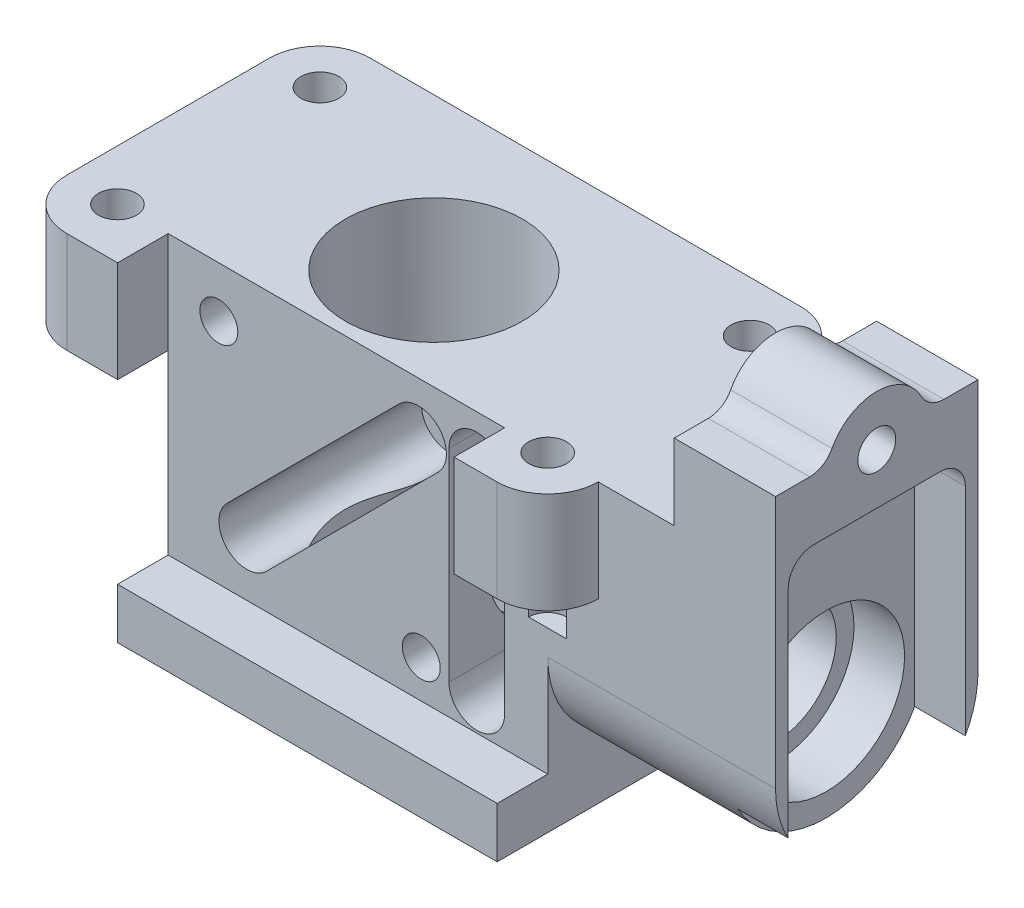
ISO-10303-21;
HEADER;
FILE_DESCRIPTION(('STEP AP214'),'2;1');
FILE_NAME('part.step','',(''),(''),'','','');
FILE_SCHEMA(('AUTOMOTIVE_DESIGN { 1 0 10303 214 1 1 1 1 }'));
ENDSEC;
DATA;
#1=APPLICATION_CONTEXT('core data for automotive mechanical design processes');
#2=APPLICATION_PROTOCOL_DEFINITION('international standard','automotive_design',2000,#1);
#3=PRODUCT_CONTEXT('',#1,'mechanical');
#4=PRODUCT('Part','Part','',(#3));
#5=PRODUCT_RELATED_PRODUCT_CATEGORY('part','',(#4));
#6=PRODUCT_DEFINITION_FORMATION('','',#4);
#7=PRODUCT_DEFINITION_CONTEXT('part definition',#1,'design');
#8=PRODUCT_DEFINITION('design','',#6,#7);
#9=PRODUCT_DEFINITION_SHAPE('','',#8);
#10=(LENGTH_UNIT() NAMED_UNIT(*) SI_UNIT(.MILLI.,.METRE.));
#11=(NAMED_UNIT(*) PLANE_ANGLE_UNIT() SI_UNIT($,.RADIAN.));
#12=(NAMED_UNIT(*) SI_UNIT($,.STERADIAN.) SOLID_ANGLE_UNIT());
#13=UNCERTAINTY_MEASURE_WITH_UNIT(LENGTH_MEASURE(1.E-05),#10,'distance_accuracy_value','');
#14=(GEOMETRIC_REPRESENTATION_CONTEXT(3) GLOBAL_UNCERTAINTY_ASSIGNED_CONTEXT((#13)) GLOBAL_UNIT_ASSIGNED_CONTEXT((#10,
#11,#12)) REPRESENTATION_CONTEXT('',''));
#15=CARTESIAN_POINT('',(0.,0.,0.));
#16=DIRECTION('',(0.,0.,1.));
#17=DIRECTION('',(1.,0.,0.));
#18=AXIS2_PLACEMENT_3D('',#15,#16,#17);
#19=CARTESIAN_POINT('',(0.,0.,6.));
#20=DIRECTION('',(-1.,0.,0.));
#21=DIRECTION('',(0.,0.,1.));
#22=AXIS2_PLACEMENT_3D('',#19,#20,#21);
#23=PLANE('',#22);
#24=DIRECTION('',(0.,0.,1.));
#25=VECTOR('',#24,1.);
#26=CARTESIAN_POINT('',(0.,3.,1.5));
#27=LINE('',#26,#25);
#28=CARTESIAN_POINT('',(0.,3.,0.));
#29=VERTEX_POINT('',#28);
#30=CARTESIAN_POINT('',(0.,3.,1.));
#31=VERTEX_POINT('',#30);
#32=EDGE_CURVE('E1678',#29,#31,#27,.T.);
#33=ORIENTED_EDGE('',*,*,#32,.F.);
#34=DIRECTION('',(0.,1.,0.));
#35=VECTOR('',#34,1.);
#36=CARTESIAN_POINT('',(0.,0.,0.));
#37=LINE('',#36,#35);
#38=CARTESIAN_POINT('',(0.,4.5,0.));
#39=VERTEX_POINT('',#38);
#40=EDGE_CURVE('E507',#29,#39,#37,.T.);
#41=ORIENTED_EDGE('',*,*,#40,.T.);
#42=DIRECTION('',(0.,0.,1.));
#43=VECTOR('',#42,1.);
#44=CARTESIAN_POINT('',(0.,4.5,0.));
#45=LINE('',#44,#43);
#46=CARTESIAN_POINT('',(0.,4.5,0.625008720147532));
#47=VERTEX_POINT('',#46);
#48=EDGE_CURVE('E1050',#39,#47,#45,.T.);
#49=ORIENTED_EDGE('',*,*,#48,.T.);
#50=DIRECTION('',(0.,1.,0.));
#51=VECTOR('',#50,1.);
#52=CARTESIAN_POINT('',(0.,3.5,0.625008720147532));
#53=LINE('',#52,#51);
#54=CARTESIAN_POINT('',(0.,3.5,0.625008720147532));
#55=VERTEX_POINT('',#54);
#56=EDGE_CURVE('E434',#47,#55,#53,.F.);
#57=ORIENTED_EDGE('',*,*,#56,.T.);
#58=DIRECTION('',(0.,0.,-1.));
#59=VECTOR('',#58,1.);
#60=CARTESIAN_POINT('',(0.,3.5,6.));
#61=LINE('',#60,#59);
#62=CARTESIAN_POINT('',(0.,3.5,1.));
#63=VERTEX_POINT('',#62);
#64=EDGE_CURVE('E443',#63,#55,#61,.T.);
#65=ORIENTED_EDGE('',*,*,#64,.F.);
#66=DIRECTION('',(0.,-1.,0.));
#67=VECTOR('',#66,1.);
#68=CARTESIAN_POINT('',(0.,8.001138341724,1.));
#69=LINE('',#68,#67);
#70=EDGE_CURVE('E876',#63,#31,#69,.T.);
#71=ORIENTED_EDGE('',*,*,#70,.T.);
#72=EDGE_LOOP('',(#33,#41,#49,#57,#65,#71));
#73=FACE_BOUND('',#72,.T.);
#74=ADVANCED_FACE('F39',(#73),#23,.F.);
#75=CARTESIAN_POINT('',(-0.00255734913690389,4.5,1.));
#76=DIRECTION('',(0.,-1.,0.));
#77=DIRECTION('',(0.,0.,-1.));
#78=AXIS2_PLACEMENT_3D('',#75,#76,#77);
#79=CYLINDRICAL_SURFACE('',#78,1.);
#80=ORIENTED_EDGE('',*,*,#40,.F.);
#81=CARTESIAN_POINT('',(-0.00255734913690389,3.,1.));
#82=DIRECTION('',(0.,-1.,0.));
#83=DIRECTION('',(1.,0.,0.));
#84=AXIS2_PLACEMENT_3D('',#81,#82,#83);
#85=CIRCLE('',#84,1.);
#86=CARTESIAN_POINT('',(-0.00255734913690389,3.,0.));
#87=VERTEX_POINT('',#86);
#88=EDGE_CURVE('E487',#29,#87,#85,.F.);
#89=ORIENTED_EDGE('',*,*,#88,.T.);
#90=DIRECTION('',(0.,1.,0.));
#91=VECTOR('',#90,1.);
#92=CARTESIAN_POINT('',(-0.00255734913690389,4.5,0.));
#93=LINE('',#92,#91);
#94=CARTESIAN_POINT('',(-0.00255734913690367,6.5,0.));
#95=VERTEX_POINT('',#94);
#96=EDGE_CURVE('E470',#95,#87,#93,.F.);
#97=ORIENTED_EDGE('',*,*,#96,.F.);
#98=CARTESIAN_POINT('',(-0.00255734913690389,6.5,1.));
#99=DIRECTION('',(0.,-1.,0.));
#100=DIRECTION('',(1.,0.,0.));
#101=AXIS2_PLACEMENT_3D('',#98,#99,#100);
#102=CIRCLE('',#101,1.);
#103=CARTESIAN_POINT('',(0.997442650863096,6.5,1.));
#104=VERTEX_POINT('',#103);
#105=EDGE_CURVE('E462',#104,#95,#102,.F.);
#106=ORIENTED_EDGE('',*,*,#105,.F.);
#107=DIRECTION('',(0.,1.,0.));
#108=VECTOR('',#107,1.);
#109=CARTESIAN_POINT('',(0.997442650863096,4.5,1.));
#110=LINE('',#109,#108);
#111=CARTESIAN_POINT('',(0.997442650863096,4.5,1.));
#112=VERTEX_POINT('',#111);
#113=EDGE_CURVE('E761',#112,#104,#110,.T.);
#114=ORIENTED_EDGE('',*,*,#113,.F.);
#115=CARTESIAN_POINT('',(-0.00255734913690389,4.5,1.));
#116=DIRECTION('',(0.,1.,0.));
#117=DIRECTION('',(0.,0.,1.));
#118=AXIS2_PLACEMENT_3D('',#115,#116,#117);
#119=CIRCLE('',#118,1.);
#120=EDGE_CURVE('E473',#39,#112,#119,.F.);
#121=ORIENTED_EDGE('',*,*,#120,.F.);
#122=EDGE_LOOP('',(#80,#89,#97,#106,#114,#121));
#123=FACE_BOUND('',#122,.T.);
#124=ADVANCED_FACE('F520',(#123),#79,.T.);
#125=DIRECTION('',(0.,0.,-1.));
#126=VECTOR('',#125,1.);
#127=CARTESIAN_POINT('',(0.,0.,6.));
#128=LINE('',#127,#126);
#129=CARTESIAN_POINT('',(0.,0.,6.));
#130=VERTEX_POINT('',#129);
#131=CARTESIAN_POINT('',(0.,0.,1.5));
#132=VERTEX_POINT('',#131);
#133=EDGE_CURVE('E551',#130,#132,#128,.T.);
#134=ORIENTED_EDGE('',*,*,#133,.T.);
#135=DIRECTION('',(0.,-1.,0.));
#136=VECTOR('',#135,1.);
#137=CARTESIAN_POINT('',(0.,3.,1.5));
#138=LINE('',#137,#136);
#139=CARTESIAN_POINT('',(0.,1.67712434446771,1.5));
#140=VERTEX_POINT('',#139);
#141=EDGE_CURVE('E400',#140,#132,#138,.T.);
#142=ORIENTED_EDGE('',*,*,#141,.F.);
#143=CARTESIAN_POINT('',(0.,3.,3.));
#144=DIRECTION('',(-1.,0.,0.));
#145=DIRECTION('',(0.,0.,1.));
#146=AXIS2_PLACEMENT_3D('',#143,#144,#145);
#147=CIRCLE('',#146,2.);
#148=CARTESIAN_POINT('',(0.,3.,5.));
#149=VERTEX_POINT('',#148);
#150=EDGE_CURVE('E882',#140,#149,#147,.T.);
#151=ORIENTED_EDGE('',*,*,#150,.T.);
#152=DIRECTION('',(0.,1.,0.));
#153=VECTOR('',#152,1.);
#154=CARTESIAN_POINT('',(0.,6.5,5.));
#155=LINE('',#154,#153);
#156=CARTESIAN_POINT('',(0.,1.,5.));
#157=VERTEX_POINT('',#156);
#158=EDGE_CURVE('E1014',#157,#149,#155,.T.);
#159=ORIENTED_EDGE('',*,*,#158,.F.);
#160=DIRECTION('',(0.,0.,1.));
#161=VECTOR('',#160,1.);
#162=CARTESIAN_POINT('',(0.,1.,5.));
#163=LINE('',#162,#161);
#164=CARTESIAN_POINT('',(0.,1.,6.));
#165=VERTEX_POINT('',#164);
#166=EDGE_CURVE('E1017',#157,#165,#163,.T.);
#167=ORIENTED_EDGE('',*,*,#166,.T.);
#168=DIRECTION('',(0.,1.,0.));
#169=VECTOR('',#168,1.);
#170=CARTESIAN_POINT('',(0.,0.,6.));
#171=LINE('',#170,#169);
#172=EDGE_CURVE('E712',#130,#165,#171,.T.);
#173=ORIENTED_EDGE('',*,*,#172,.F.);
#174=EDGE_LOOP('',(#134,#142,#151,#159,#167,#173));
#175=FACE_BOUND('',#174,.T.);
#176=ADVANCED_FACE('F692',(#175),#23,.F.);
#177=CARTESIAN_POINT('',(4.5,8.,6.));
#178=DIRECTION('',(0.,-1.,0.));
#179=DIRECTION('',(0.,0.,-1.));
#180=AXIS2_PLACEMENT_3D('',#177,#178,#179);
#181=PLANE('',#180);
#182=DIRECTION('',(0.,0.,-1.));
#183=VECTOR('',#182,1.);
#184=CARTESIAN_POINT('',(2.49744265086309,8.,6.));
#185=LINE('',#184,#183);
#186=CARTESIAN_POINT('',(2.49744265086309,8.,1.67335008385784));
#187=VERTEX_POINT('',#186);
#188=CARTESIAN_POINT('',(2.49744265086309,8.,1.));
#189=VERTEX_POINT('',#188);
#190=EDGE_CURVE('E543',#187,#189,#185,.T.);
#191=ORIENTED_EDGE('',*,*,#190,.F.);
#192=DIRECTION('',(1.,0.,0.));
#193=VECTOR('',#192,1.);
#194=CARTESIAN_POINT('',(4.5,8.,1.67335008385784));
#195=LINE('',#194,#193);
#196=CARTESIAN_POINT('',(4.5,8.,1.67335008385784));
#197=VERTEX_POINT('',#196);
#198=EDGE_CURVE('E1075',#187,#197,#195,.T.);
#199=ORIENTED_EDGE('',*,*,#198,.T.);
#200=DIRECTION('',(0.,0.,-1.));
#201=VECTOR('',#200,1.);
#202=CARTESIAN_POINT('',(4.5,8.,6.));
#203=LINE('',#202,#201);
#204=CARTESIAN_POINT('',(4.5,8.,1.));
#205=VERTEX_POINT('',#204);
#206=EDGE_CURVE('E547',#197,#205,#203,.T.);
#207=ORIENTED_EDGE('',*,*,#206,.T.);
#208=DIRECTION('',(-1.,0.,0.));
#209=VECTOR('',#208,1.);
#210=CARTESIAN_POINT('',(4.5,8.,1.));
#211=LINE('',#210,#209);
#212=EDGE_CURVE('E899',#205,#189,#211,.T.);
#213=ORIENTED_EDGE('',*,*,#212,.T.);
#214=EDGE_LOOP('',(#191,#199,#207,#213));
#215=FACE_BOUND('',#214,.T.);
#216=ADVANCED_FACE('F700',(#215),#181,.F.);
#217=CARTESIAN_POINT('',(0.,0.,6.));
#218=DIRECTION('',(0.,0.,1.));
#219=DIRECTION('',(1.,0.,0.));
#220=AXIS2_PLACEMENT_3D('',#217,#218,#219);
#221=PLANE('',#220);
#222=DIRECTION('',(-1.,0.,0.));
#223=VECTOR('',#222,1.);
#224=CARTESIAN_POINT('',(2.49744265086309,6.5,6.));
#225=LINE('',#224,#223);
#226=CARTESIAN_POINT('',(-7.5,6.5,6.));
#227=VERTEX_POINT('',#226);
#228=CARTESIAN_POINT('',(-8.5025573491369,6.5,6.));
#229=VERTEX_POINT('',#228);
#230=EDGE_CURVE('E718',#227,#229,#225,.T.);
#231=ORIENTED_EDGE('',*,*,#230,.T.);
#232=DIRECTION('',(0.,1.,0.));
#233=VECTOR('',#232,1.);
#234=CARTESIAN_POINT('',(-8.5025573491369,0.,6.));
#235=LINE('',#234,#233);
#236=CARTESIAN_POINT('',(-8.5025573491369,4.5,6.));
#237=VERTEX_POINT('',#236);
#238=EDGE_CURVE('E485',#229,#237,#235,.F.);
#239=ORIENTED_EDGE('',*,*,#238,.T.);
#240=DIRECTION('',(1.,0.,0.));
#241=VECTOR('',#240,1.);
#242=CARTESIAN_POINT('',(-7.5,4.5,6.));
#243=LINE('',#242,#241);
#244=CARTESIAN_POINT('',(-7.5,4.5,6.));
#245=VERTEX_POINT('',#244);
#246=EDGE_CURVE('E725',#237,#245,#243,.T.);
#247=ORIENTED_EDGE('',*,*,#246,.T.);
#248=DIRECTION('',(0.,-1.,0.));
#249=VECTOR('',#248,1.);
#250=CARTESIAN_POINT('',(-7.5,6.5,6.));
#251=LINE('',#250,#249);
#252=EDGE_CURVE('E1003',#227,#245,#251,.T.);
#253=ORIENTED_EDGE('',*,*,#252,.F.);
#254=EDGE_LOOP('',(#231,#239,#247,#253));
#255=FACE_BOUND('',#254,.T.);
#256=ADVANCED_FACE('F705',(#255),#221,.T.);
#257=CARTESIAN_POINT('',(-1.95255734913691,5.6,-6.35563491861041));
#258=DIRECTION('',(-1.,0.,0.));
#259=DIRECTION('',(0.,0.,1.));
#260=AXIS2_PLACEMENT_3D('',#257,#258,#259);
#261=PLANE('',#260);
#262=CARTESIAN_POINT('',(-1.95255734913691,3.,3.));
#263=DIRECTION('',(-1.,0.,0.));
#264=DIRECTION('',(0.,0.,1.));
#265=AXIS2_PLACEMENT_3D('',#262,#263,#264);
#266=CIRCLE('',#265,1.2);
#267=CARTESIAN_POINT('',(-1.95255734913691,3.,4.2));
#268=VERTEX_POINT('',#267);
#269=EDGE_CURVE('E557',#268,#268,#266,.F.);
#270=ORIENTED_EDGE('',*,*,#269,.F.);
#271=EDGE_LOOP('',(#270));
#272=FACE_BOUND('',#271,.T.);
#273=DIRECTION('',(0.,1.,0.));
#274=VECTOR('',#273,1.);
#275=CARTESIAN_POINT('',(-1.95255734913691,5.6,5.));
#276=LINE('',#275,#274);
#277=CARTESIAN_POINT('',(-1.95255734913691,1.6,5.));
#278=VERTEX_POINT('',#277);
#279=CARTESIAN_POINT('',(-1.95255734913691,5.6,5.));
#280=VERTEX_POINT('',#279);
#281=EDGE_CURVE('E866',#278,#280,#276,.T.);
#282=ORIENTED_EDGE('',*,*,#281,.F.);
#283=DIRECTION('',(0.,0.,1.));
#284=VECTOR('',#283,1.);
#285=CARTESIAN_POINT('',(-1.95255734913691,1.6,-6.35563491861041));
#286=LINE('',#285,#284);
#287=CARTESIAN_POINT('',(-1.95255734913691,1.6,1.));
#288=VERTEX_POINT('',#287);
#289=EDGE_CURVE('E835',#288,#278,#286,.T.);
#290=ORIENTED_EDGE('',*,*,#289,.F.);
#291=DIRECTION('',(0.,1.,0.));
#292=VECTOR('',#291,1.);
#293=CARTESIAN_POINT('',(-1.95255734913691,5.6,1.));
#294=LINE('',#293,#292);
#295=CARTESIAN_POINT('',(-1.95255734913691,5.6,1.));
#296=VERTEX_POINT('',#295);
#297=EDGE_CURVE('E834',#288,#296,#294,.T.);
#298=ORIENTED_EDGE('',*,*,#297,.T.);
#299=DIRECTION('',(0.,0.,1.));
#300=VECTOR('',#299,1.);
#301=CARTESIAN_POINT('',(-1.95255734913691,5.6,-6.35563491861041));
#302=LINE('',#301,#300);
#303=EDGE_CURVE('E841',#296,#280,#302,.T.);
#304=ORIENTED_EDGE('',*,*,#303,.T.);
#305=EDGE_LOOP('',(#282,#290,#298,#304));
#306=FACE_BOUND('',#305,.T.);
#307=ADVANCED_FACE('F1210',(#272,#306),#261,.F.);
#308=CARTESIAN_POINT('',(-0.852557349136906,5.6,-6.35563491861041));
#309=DIRECTION('',(1.,0.,0.));
#310=DIRECTION('',(0.,1.,0.));
#311=AXIS2_PLACEMENT_3D('',#308,#309,#310);
#312=PLANE('',#311);
#313=CARTESIAN_POINT('',(-0.852557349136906,3.,3.));
#314=DIRECTION('',(1.,0.,0.));
#315=DIRECTION('',(0.,1.,0.));
#316=AXIS2_PLACEMENT_3D('',#313,#314,#315);
#317=CIRCLE('',#316,1.2);
#318=CARTESIAN_POINT('',(-0.852557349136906,4.2,3.));
#319=VERTEX_POINT('',#318);
#320=EDGE_CURVE('E554',#319,#319,#317,.F.);
#321=ORIENTED_EDGE('',*,*,#320,.F.);
#322=EDGE_LOOP('',(#321));
#323=FACE_BOUND('',#322,.T.);
#324=DIRECTION('',(0.,-1.,0.));
#325=VECTOR('',#324,1.);
#326=CARTESIAN_POINT('',(-0.852557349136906,5.6,5.));
#327=LINE('',#326,#325);
#328=CARTESIAN_POINT('',(-0.852557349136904,4.5,5.));
#329=VERTEX_POINT('',#328);
#330=CARTESIAN_POINT('',(-0.852557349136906,1.6,5.));
#331=VERTEX_POINT('',#330);
#332=EDGE_CURVE('E870',#329,#331,#327,.T.);
#333=ORIENTED_EDGE('',*,*,#332,.F.);
#334=DIRECTION('',(0.,0.,1.));
#335=VECTOR('',#334,1.);
#336=CARTESIAN_POINT('',(-0.852557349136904,4.5,6.));
#337=LINE('',#336,#335);
#338=CARTESIAN_POINT('',(-0.852557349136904,4.5,6.));
#339=VERTEX_POINT('',#338);
#340=EDGE_CURVE('E1027',#329,#339,#337,.T.);
#341=ORIENTED_EDGE('',*,*,#340,.T.);
#342=DIRECTION('',(0.,1.,0.));
#343=VECTOR('',#342,1.);
#344=CARTESIAN_POINT('',(-0.852557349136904,4.5,6.));
#345=LINE('',#344,#343);
#346=CARTESIAN_POINT('',(-0.852557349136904,6.5,6.));
#347=VERTEX_POINT('',#346);
#348=EDGE_CURVE('E1028',#339,#347,#345,.T.);
#349=ORIENTED_EDGE('',*,*,#348,.T.);
#350=DIRECTION('',(0.,0.,1.));
#351=VECTOR('',#350,1.);
#352=CARTESIAN_POINT('',(-0.852557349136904,6.5,6.));
#353=LINE('',#352,#351);
#354=CARTESIAN_POINT('',(-0.852557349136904,6.5,5.));
#355=VERTEX_POINT('',#354);
#356=EDGE_CURVE('E1037',#355,#347,#353,.T.);
#357=ORIENTED_EDGE('',*,*,#356,.F.);
#358=DIRECTION('',(0.,1.,0.));
#359=VECTOR('',#358,1.);
#360=CARTESIAN_POINT('',(-0.852557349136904,3.,5.));
#361=LINE('',#360,#359);
#362=CARTESIAN_POINT('',(-0.852557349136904,5.6,5.));
#363=VERTEX_POINT('',#362);
#364=EDGE_CURVE('E1111',#363,#355,#361,.T.);
#365=ORIENTED_EDGE('',*,*,#364,.F.);
#366=DIRECTION('',(0.,0.,1.));
#367=VECTOR('',#366,1.);
#368=CARTESIAN_POINT('',(-0.852557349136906,5.6,-6.35563491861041));
#369=LINE('',#368,#367);
#370=CARTESIAN_POINT('',(-0.852557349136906,5.6,1.));
#371=VERTEX_POINT('',#370);
#372=EDGE_CURVE('E844',#371,#363,#369,.T.);
#373=ORIENTED_EDGE('',*,*,#372,.F.);
#374=DIRECTION('',(0.,-1.,0.));
#375=VECTOR('',#374,1.);
#376=CARTESIAN_POINT('',(-0.852557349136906,5.6,1.));
#377=LINE('',#376,#375);
#378=CARTESIAN_POINT('',(-0.852557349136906,1.6,1.));
#379=VERTEX_POINT('',#378);
#380=EDGE_CURVE('E558',#371,#379,#377,.T.);
#381=ORIENTED_EDGE('',*,*,#380,.T.);
#382=DIRECTION('',(0.,0.,1.));
#383=VECTOR('',#382,1.);
#384=CARTESIAN_POINT('',(-0.852557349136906,1.6,-6.35563491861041));
#385=LINE('',#384,#383);
#386=EDGE_CURVE('E831',#379,#331,#385,.T.);
#387=ORIENTED_EDGE('',*,*,#386,.T.);
#388=EDGE_LOOP('',(#333,#341,#349,#357,#365,#373,#381,#387));
#389=FACE_BOUND('',#388,.T.);
#390=ADVANCED_FACE('F853',(#323,#389),#312,.F.);
#391=CARTESIAN_POINT('',(-1.40255734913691,1.6,-6.35563491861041));
#392=DIRECTION('',(0.,0.,1.));
#393=DIRECTION('',(1.,0.,0.));
#394=AXIS2_PLACEMENT_3D('',#391,#392,#393);
#395=CYLINDRICAL_SURFACE('',#394,0.55);
#396=CARTESIAN_POINT('',(-1.40255734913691,1.6,5.));
#397=DIRECTION('',(0.,0.,1.));
#398=DIRECTION('',(1.,0.,0.));
#399=AXIS2_PLACEMENT_3D('',#396,#397,#398);
#400=CIRCLE('',#399,0.55);
#401=EDGE_CURVE('E863',#331,#278,#400,.F.);
#402=ORIENTED_EDGE('',*,*,#401,.F.);
#403=ORIENTED_EDGE('',*,*,#386,.F.);
#404=CARTESIAN_POINT('',(-1.40255734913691,1.6,1.));
#405=DIRECTION('',(0.,0.,1.));
#406=DIRECTION('',(1.,0.,0.));
#407=AXIS2_PLACEMENT_3D('',#404,#405,#406);
#408=CIRCLE('',#407,0.55);
#409=EDGE_CURVE('E837',#379,#288,#408,.F.);
#410=ORIENTED_EDGE('',*,*,#409,.T.);
#411=ORIENTED_EDGE('',*,*,#289,.T.);
#412=EDGE_LOOP('',(#402,#403,#410,#411));
#413=FACE_BOUND('',#412,.T.);
#414=ADVANCED_FACE('F862',(#413),#395,.F.);
#415=CARTESIAN_POINT('',(-1.40255734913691,5.6,-6.35563491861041));
#416=DIRECTION('',(0.,0.,1.));
#417=DIRECTION('',(1.,0.,0.));
#418=AXIS2_PLACEMENT_3D('',#415,#416,#417);
#419=CYLINDRICAL_SURFACE('',#418,0.55);
#420=CARTESIAN_POINT('',(-1.40255734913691,5.6,5.));
#421=DIRECTION('',(0.,0.,1.));
#422=DIRECTION('',(1.,0.,0.));
#423=AXIS2_PLACEMENT_3D('',#420,#421,#422);
#424=CIRCLE('',#423,0.55);
#425=EDGE_CURVE('E799',#280,#363,#424,.F.);
#426=ORIENTED_EDGE('',*,*,#425,.F.);
#427=ORIENTED_EDGE('',*,*,#303,.F.);
#428=CARTESIAN_POINT('',(-1.40255734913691,5.6,1.));
#429=DIRECTION('',(0.,0.,1.));
#430=DIRECTION('',(1.,0.,0.));
#431=AXIS2_PLACEMENT_3D('',#428,#429,#430);
#432=CIRCLE('',#431,0.55);
#433=EDGE_CURVE('E832',#296,#371,#432,.F.);
#434=ORIENTED_EDGE('',*,*,#433,.T.);
#435=ORIENTED_EDGE('',*,*,#372,.T.);
#436=EDGE_LOOP('',(#426,#427,#434,#435));
#437=FACE_BOUND('',#436,.T.);
#438=ADVANCED_FACE('F1208',(#437),#419,.F.);
#439=CARTESIAN_POINT('',(-2.16403499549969,5.08596500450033,-6.35563491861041));
#440=DIRECTION('',(0.707106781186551,-0.707106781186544,0.));
#441=DIRECTION('',(0.707106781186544,0.707106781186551,0.));
#442=AXIS2_PLACEMENT_3D('',#439,#440,#441);
#443=PLANE('',#442);
#444=DIRECTION('',(-0.707106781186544,-0.707106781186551,0.));
#445=VECTOR('',#444,1.);
#446=CARTESIAN_POINT('',(-2.16403499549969,5.08596500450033,5.));
#447=LINE('',#446,#445);
#448=CARTESIAN_POINT('',(-2.16403499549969,5.08596500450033,5.));
#449=VERTEX_POINT('',#448);
#450=CARTESIAN_POINT('',(-5.5581475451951,1.69185245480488,5.));
#451=VERTEX_POINT('',#450);
#452=EDGE_CURVE('E791',#449,#451,#447,.T.);
#453=ORIENTED_EDGE('',*,*,#452,.F.);
#454=DIRECTION('',(0.,0.,1.));
#455=VECTOR('',#454,1.);
#456=CARTESIAN_POINT('',(-2.16403499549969,5.08596500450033,-6.35563491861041));
#457=LINE('',#456,#455);
#458=CARTESIAN_POINT('',(-2.16403499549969,5.08596500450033,1.));
#459=VERTEX_POINT('',#458);
#460=EDGE_CURVE('E805',#459,#449,#457,.T.);
#461=ORIENTED_EDGE('',*,*,#460,.F.);
#462=DIRECTION('',(-0.707106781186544,-0.707106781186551,0.));
#463=VECTOR('',#462,1.);
#464=CARTESIAN_POINT('',(-2.16403499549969,5.08596500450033,1.));
#465=LINE('',#464,#463);
#466=CARTESIAN_POINT('',(-5.5581475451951,1.69185245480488,1.));
#467=VERTEX_POINT('',#466);
#468=EDGE_CURVE('E817',#459,#467,#465,.T.);
#469=ORIENTED_EDGE('',*,*,#468,.T.);
#470=DIRECTION('',(0.,0.,1.));
#471=VECTOR('',#470,1.);
#472=CARTESIAN_POINT('',(-5.5581475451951,1.69185245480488,-6.35563491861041));
#473=LINE('',#472,#471);
#474=CARTESIAN_POINT('',(-5.5581475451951,1.69185245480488,1.83756720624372));
#475=VERTEX_POINT('',#474);
#476=EDGE_CURVE('E815',#467,#475,#473,.T.);
#477=ORIENTED_EDGE('',*,*,#476,.T.);
#478=CARTESIAN_POINT('',(-4.25,3.,3.));
#479=DIRECTION('',(0.707106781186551,-0.707106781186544,0.));
#480=DIRECTION('',(0.707106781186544,0.707106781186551,0.));
#481=AXIS2_PLACEMENT_3D('',#478,#479,#480);
#482=ELLIPSE('',#481,2.47487373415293,1.75);
#483=CARTESIAN_POINT('',(-5.5581475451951,1.69185245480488,4.16243279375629));
#484=VERTEX_POINT('',#483);
#485=EDGE_CURVE('E934',#475,#484,#482,.T.);
#486=ORIENTED_EDGE('',*,*,#485,.T.);
#487=EDGE_CURVE('E808',#484,#451,#473,.T.);
#488=ORIENTED_EDGE('',*,*,#487,.T.);
#489=EDGE_LOOP('',(#453,#461,#469,#477,#486,#488));
#490=FACE_BOUND('',#489,.T.);
#491=ADVANCED_FACE('F804',(#490),#443,.F.);
#492=CARTESIAN_POINT('',(-2.9418524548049,5.86378246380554,-6.35563491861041));
#493=DIRECTION('',(-0.707106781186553,0.707106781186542,0.));
#494=DIRECTION('',(-0.707106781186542,-0.707106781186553,0.));
#495=AXIS2_PLACEMENT_3D('',#492,#493,#494);
#496=PLANE('',#495);
#497=DIRECTION('',(0.707106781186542,0.707106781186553,0.));
#498=VECTOR('',#497,1.);
#499=CARTESIAN_POINT('',(-2.9418524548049,5.86378246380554,5.));
#500=LINE('',#499,#498);
#501=CARTESIAN_POINT('',(-6.3359650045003,2.46966991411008,5.));
#502=VERTEX_POINT('',#501);
#503=CARTESIAN_POINT('',(-2.9418524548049,5.86378246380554,5.));
#504=VERTEX_POINT('',#503);
#505=EDGE_CURVE('E794',#502,#504,#500,.T.);
#506=ORIENTED_EDGE('',*,*,#505,.F.);
#507=DIRECTION('',(0.,0.,1.));
#508=VECTOR('',#507,1.);
#509=CARTESIAN_POINT('',(-6.33596500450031,2.46966991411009,-6.35563491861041));
#510=LINE('',#509,#508);
#511=CARTESIAN_POINT('',(-6.33596500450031,2.46966991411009,1.));
#512=VERTEX_POINT('',#511);
#513=EDGE_CURVE('E822',#512,#502,#510,.T.);
#514=ORIENTED_EDGE('',*,*,#513,.F.);
#515=DIRECTION('',(0.707106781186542,0.707106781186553,0.));
#516=VECTOR('',#515,1.);
#517=CARTESIAN_POINT('',(-2.9418524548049,5.86378246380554,1.));
#518=LINE('',#517,#516);
#519=CARTESIAN_POINT('',(-2.9418524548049,5.86378246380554,1.));
#520=VERTEX_POINT('',#519);
#521=EDGE_CURVE('E829',#512,#520,#518,.T.);
#522=ORIENTED_EDGE('',*,*,#521,.T.);
#523=DIRECTION('',(0.,0.,1.));
#524=VECTOR('',#523,1.);
#525=CARTESIAN_POINT('',(-2.9418524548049,5.86378246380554,-6.35563491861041));
#526=LINE('',#525,#524);
#527=CARTESIAN_POINT('',(-2.9418524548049,5.86378246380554,1.83756720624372));
#528=VERTEX_POINT('',#527);
#529=EDGE_CURVE('E825',#520,#528,#526,.T.);
#530=ORIENTED_EDGE('',*,*,#529,.T.);
#531=CARTESIAN_POINT('',(-4.25,4.55563491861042,3.));
#532=DIRECTION('',(-0.707106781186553,0.707106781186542,0.));
#533=DIRECTION('',(0.707106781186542,0.707106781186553,0.));
#534=AXIS2_PLACEMENT_3D('',#531,#532,#533);
#535=ELLIPSE('',#534,2.47487373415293,1.75);
#536=CARTESIAN_POINT('',(-2.9418524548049,5.86378246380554,4.16243279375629));
#537=VERTEX_POINT('',#536);
#538=EDGE_CURVE('E604',#528,#537,#535,.T.);
#539=ORIENTED_EDGE('',*,*,#538,.T.);
#540=EDGE_CURVE('E828',#537,#504,#526,.T.);
#541=ORIENTED_EDGE('',*,*,#540,.T.);
#542=EDGE_LOOP('',(#506,#514,#522,#530,#539,#541));
#543=FACE_BOUND('',#542,.T.);
#544=ADVANCED_FACE('F938',(#543),#496,.F.);
#545=CARTESIAN_POINT('',(-2.55294372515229,5.47487373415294,-6.35563491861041));
#546=DIRECTION('',(0.,0.,1.));
#547=DIRECTION('',(1.,0.,0.));
#548=AXIS2_PLACEMENT_3D('',#545,#546,#547);
#549=CYLINDRICAL_SURFACE('',#548,0.550000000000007);
#550=CARTESIAN_POINT('',(-2.55294372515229,5.47487373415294,5.));
#551=DIRECTION('',(0.,0.,1.));
#552=DIRECTION('',(1.,0.,0.));
#553=AXIS2_PLACEMENT_3D('',#550,#551,#552);
#554=CIRCLE('',#553,0.550000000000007);
#555=EDGE_CURVE('E789',#504,#449,#554,.F.);
#556=ORIENTED_EDGE('',*,*,#555,.F.);
#557=ORIENTED_EDGE('',*,*,#540,.F.);
#558=CARTESIAN_POINT('',(-2.9418524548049,5.86378246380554,4.16243279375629));
#559=CARTESIAN_POINT('',(-2.92871734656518,5.87691187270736,4.14766020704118));
#560=CARTESIAN_POINT('',(-2.91538032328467,5.88892583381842,4.132137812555));
#561=CARTESIAN_POINT('',(-2.88863990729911,5.91088670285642,4.09983286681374));
#562=CARTESIAN_POINT('',(-2.87523680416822,5.9208392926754,4.0830539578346));
#563=CARTESIAN_POINT('',(-2.83571488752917,5.94768016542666,4.03157474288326));
#564=CARTESIAN_POINT('',(-2.80987610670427,5.96192861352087,3.99528158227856));
#565=CARTESIAN_POINT('',(-2.75018785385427,5.98974571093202,3.90396202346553));
#566=CARTESIAN_POINT('',(-2.71746410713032,6.00057823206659,3.84741198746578));
#567=CARTESIAN_POINT('',(-2.65812940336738,6.01559253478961,3.72995439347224));
#568=CARTESIAN_POINT('',(-2.63156840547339,6.01972148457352,3.6690161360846));
#569=CARTESIAN_POINT('',(-2.59181358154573,6.02375262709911,3.56147179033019));
#570=CARTESIAN_POINT('',(-2.57695016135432,6.02450113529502,3.51549600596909));
#571=CARTESIAN_POINT('',(-2.55106856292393,6.02502367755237,3.42244976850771));
#572=CARTESIAN_POINT('',(-2.54005176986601,6.02479736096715,3.37537892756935));
#573=CARTESIAN_POINT('',(-2.52196375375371,6.02407487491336,3.28056523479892));
#574=CARTESIAN_POINT('',(-2.51488648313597,6.02357912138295,3.23282352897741));
#575=CARTESIAN_POINT('',(-2.50469879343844,6.02277763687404,3.13692415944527));
#576=CARTESIAN_POINT('',(-2.50158772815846,6.02247187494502,3.08876656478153));
#577=CARTESIAN_POINT('',(-2.49934292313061,6.02225690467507,2.99194195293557));
#578=CARTESIAN_POINT('',(-2.50024369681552,6.02235113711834,2.94327412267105));
#579=CARTESIAN_POINT('',(-2.50609495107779,6.02288254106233,2.8461781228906));
#580=CARTESIAN_POINT('',(-2.51104603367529,6.0233197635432,2.79774999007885));
#581=CARTESIAN_POINT('',(-2.52496688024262,6.02420616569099,2.70145717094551));
#582=CARTESIAN_POINT('',(-2.53393796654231,6.02465534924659,2.65359267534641));
#583=CARTESIAN_POINT('',(-2.5558327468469,6.02497404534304,2.55879307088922));
#584=CARTESIAN_POINT('',(-2.56875521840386,6.02484373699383,2.51185767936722));
#585=CARTESIAN_POINT('',(-2.60462450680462,6.02285020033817,2.40002315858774));
#586=CARTESIAN_POINT('',(-2.62950622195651,6.0202911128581,2.33574142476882));
#587=CARTESIAN_POINT('',(-2.68648544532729,6.00920457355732,2.21095508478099));
#588=CARTESIAN_POINT('',(-2.71857157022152,6.00068649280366,2.15044471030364));
#589=CARTESIAN_POINT('',(-2.77676366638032,5.97789056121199,2.0544285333));
#590=CARTESIAN_POINT('',(-2.80130308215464,5.96647523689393,2.01730609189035));
#591=CARTESIAN_POINT('',(-2.85181882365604,5.93749154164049,1.94669653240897));
#592=CARTESIAN_POINT('',(-2.87778798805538,5.91995183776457,1.91319341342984));
#593=CARTESIAN_POINT('',(-2.90997640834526,5.89331985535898,1.87441519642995));
#594=CARTESIAN_POINT('',(-2.91639689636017,5.8877613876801,1.86681865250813));
#595=CARTESIAN_POINT('',(-2.92917959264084,5.87614830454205,1.85194575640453));
#596=CARTESIAN_POINT('',(-2.93554173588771,5.8700931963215,1.84466973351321));
#597=CARTESIAN_POINT('',(-2.94185245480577,5.86378246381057,1.83756720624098));
#598=B_SPLINE_CURVE_WITH_KNOTS('',3,(#558,#559,#560,#561,#562,#563,#564,#565,#566,#567,#568,
#569,#570,#571,#572,#573,#574,#575,#576,#577,#578,#579,#580,#581,#582,#583,#584,#585,#586,#587,
#588,#589,#590,#591,#592,#593,#594,#595,#596,#597),.UNSPECIFIED.,.F.,.F.,(4,2,2,2,2,2,2,2,2,2,2,
2,2,2,2,2,2,2,2,4),(0.,0.0710943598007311,0.141990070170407,0.281672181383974,0.47932318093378,
0.678524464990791,0.823329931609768,0.968187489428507,1.11282205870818,1.25743306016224,
1.4032905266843,1.54916967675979,1.69509684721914,1.84097891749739,2.04732481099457,
2.25334693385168,2.39076438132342,2.52754704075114,2.5617174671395,2.59592221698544),.UNSPECIFIED.);
#599=EDGE_CURVE('E590',#537,#528,#598,.T.);
#600=ORIENTED_EDGE('',*,*,#599,.T.);
#601=ORIENTED_EDGE('',*,*,#529,.F.);
#602=CARTESIAN_POINT('',(-2.55294372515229,5.47487373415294,1.));
#603=DIRECTION('',(0.,0.,1.));
#604=DIRECTION('',(1.,0.,0.));
#605=AXIS2_PLACEMENT_3D('',#602,#603,#604);
#606=CIRCLE('',#605,0.550000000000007);
#607=EDGE_CURVE('E813',#520,#459,#606,.F.);
#608=ORIENTED_EDGE('',*,*,#607,.T.);
#609=ORIENTED_EDGE('',*,*,#460,.T.);
#610=EDGE_LOOP('',(#556,#557,#600,#601,#608,#609));
#611=FACE_BOUND('',#610,.T.);
#612=ADVANCED_FACE('F810',(#611),#549,.F.);
#613=CARTESIAN_POINT('',(-5.9470562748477,2.08076118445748,-6.35563491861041));
#614=DIRECTION('',(0.,0.,1.));
#615=DIRECTION('',(1.,0.,0.));
#616=AXIS2_PLACEMENT_3D('',#613,#614,#615);
#617=CYLINDRICAL_SURFACE('',#616,0.55);
#618=CARTESIAN_POINT('',(-5.9470562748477,2.08076118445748,5.));
#619=DIRECTION('',(0.,0.,1.));
#620=DIRECTION('',(1.,0.,0.));
#621=AXIS2_PLACEMENT_3D('',#618,#619,#620);
#622=CIRCLE('',#621,0.55);
#623=EDGE_CURVE('E1071',#451,#502,#622,.F.);
#624=ORIENTED_EDGE('',*,*,#623,.F.);
#625=ORIENTED_EDGE('',*,*,#487,.F.);
#626=CARTESIAN_POINT('',(-5.5581475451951,1.69185245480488,4.16243279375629));
#627=CARTESIAN_POINT('',(-5.57128265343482,1.67872304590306,4.14766020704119));
#628=CARTESIAN_POINT('',(-5.58461967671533,1.666709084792,4.13213781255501));
#629=CARTESIAN_POINT('',(-5.61136009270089,1.644748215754,4.09983286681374));
#630=CARTESIAN_POINT('',(-5.62476319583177,1.63479562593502,4.08305395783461));
#631=CARTESIAN_POINT('',(-5.66428511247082,1.60795475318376,4.03157474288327));
#632=CARTESIAN_POINT('',(-5.69012389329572,1.59370630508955,3.99528158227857));
#633=CARTESIAN_POINT('',(-5.74981214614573,1.56588920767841,3.90396202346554));
#634=CARTESIAN_POINT('',(-5.78253589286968,1.55505668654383,3.84741198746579));
#635=CARTESIAN_POINT('',(-5.84187059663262,1.54004238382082,3.72995439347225));
#636=CARTESIAN_POINT('',(-5.8684315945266,1.5359134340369,3.66901613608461));
#637=CARTESIAN_POINT('',(-5.90818641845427,1.53188229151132,3.56147179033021));
#638=CARTESIAN_POINT('',(-5.92304983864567,1.53113378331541,3.51549600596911));
#639=CARTESIAN_POINT('',(-5.94893143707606,1.53061124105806,3.42244976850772));
#640=CARTESIAN_POINT('',(-5.95994823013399,1.53083755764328,3.37537892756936));
#641=CARTESIAN_POINT('',(-5.97803624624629,1.53156004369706,3.28056523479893));
#642=CARTESIAN_POINT('',(-5.98511351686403,1.53205579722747,3.23282352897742));
#643=CARTESIAN_POINT('',(-5.99530120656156,1.53285728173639,3.13692415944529));
#644=CARTESIAN_POINT('',(-5.99841227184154,1.53316304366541,3.08876656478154));
#645=CARTESIAN_POINT('',(-6.00065707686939,1.53337801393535,2.99194195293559));
#646=CARTESIAN_POINT('',(-5.99975630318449,1.53328378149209,2.94327412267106));
#647=CARTESIAN_POINT('',(-5.99390504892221,1.53275237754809,2.84617812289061));
#648=CARTESIAN_POINT('',(-5.98895396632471,1.53231515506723,2.79774999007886));
#649=CARTESIAN_POINT('',(-5.97503311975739,1.53142875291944,2.70145717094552));
#650=CARTESIAN_POINT('',(-5.96606203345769,1.53097956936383,2.65359267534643));
#651=CARTESIAN_POINT('',(-5.9441672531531,1.53066087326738,2.55879307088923));
#652=CARTESIAN_POINT('',(-5.93124478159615,1.5307911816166,2.51185767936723));
#653=CARTESIAN_POINT('',(-5.89537549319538,1.53278471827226,2.40002315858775));
#654=CARTESIAN_POINT('',(-5.8704937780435,1.53534380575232,2.33574142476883));
#655=CARTESIAN_POINT('',(-5.81351455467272,1.5464303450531,2.210955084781));
#656=CARTESIAN_POINT('',(-5.78142842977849,1.55494842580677,2.15044471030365));
#657=CARTESIAN_POINT('',(-5.72323633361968,1.57774435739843,2.0544285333));
#658=CARTESIAN_POINT('',(-5.69869691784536,1.58915968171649,2.01730609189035));
#659=CARTESIAN_POINT('',(-5.64818117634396,1.61814337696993,1.94669653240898));
#660=CARTESIAN_POINT('',(-5.62221201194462,1.63568308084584,1.91319341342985));
#661=CARTESIAN_POINT('',(-5.59002359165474,1.66231506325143,1.87441519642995));
#662=CARTESIAN_POINT('',(-5.58360310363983,1.66787353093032,1.86681865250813));
#663=CARTESIAN_POINT('',(-5.57082040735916,1.67948661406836,1.85194575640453));
#664=CARTESIAN_POINT('',(-5.56445826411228,1.68554172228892,1.8446697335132));
#665=CARTESIAN_POINT('',(-5.55814754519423,1.69185245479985,1.83756720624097));
#666=B_SPLINE_CURVE_WITH_KNOTS('',3,(#626,#627,#628,#629,#630,#631,#632,#633,#634,#635,#636,
#637,#638,#639,#640,#641,#642,#643,#644,#645,#646,#647,#648,#649,#650,#651,#652,#653,#654,#655,
#656,#657,#658,#659,#660,#661,#662,#663,#664,#665),.UNSPECIFIED.,.F.,.F.,(4,2,2,2,2,2,2,2,2,2,2,
2,2,2,2,2,2,2,2,4),(0.,0.0710943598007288,0.141990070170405,0.28167218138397,0.479323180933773,
0.678524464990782,0.823329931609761,0.968187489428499,1.11282205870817,1.25743306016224,
1.40329052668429,1.54916967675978,1.69509684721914,1.84097891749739,2.04732481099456,
2.25334693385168,2.39076438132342,2.52754704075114,2.5617174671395,2.59592221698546),.UNSPECIFIED.);
#667=EDGE_CURVE('E553',#484,#475,#666,.T.);
#668=ORIENTED_EDGE('',*,*,#667,.T.);
#669=ORIENTED_EDGE('',*,*,#476,.F.);
#670=CARTESIAN_POINT('',(-5.9470562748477,2.08076118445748,1.));
#671=DIRECTION('',(0.,0.,1.));
#672=DIRECTION('',(1.,0.,0.));
#673=AXIS2_PLACEMENT_3D('',#670,#671,#672);
#674=CIRCLE('',#673,0.55);
#675=EDGE_CURVE('E605',#467,#512,#674,.F.);
#676=ORIENTED_EDGE('',*,*,#675,.T.);
#677=ORIENTED_EDGE('',*,*,#513,.T.);
#678=EDGE_LOOP('',(#624,#625,#668,#669,#676,#677));
#679=FACE_BOUND('',#678,.T.);
#680=ADVANCED_FACE('F571',(#679),#617,.F.);
#681=CARTESIAN_POINT('',(-10.8941125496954,3.,3.));
#682=DIRECTION('',(1.,0.,0.));
#683=DIRECTION('',(0.,1.,0.));
#684=AXIS2_PLACEMENT_3D('',#681,#682,#683);
#685=CYLINDRICAL_SURFACE('',#684,1.2);
#686=ORIENTED_EDGE('',*,*,#320,.T.);
#687=EDGE_LOOP('',(#686));
#688=FACE_BOUND('',#687,.T.);
#689=CARTESIAN_POINT('',(2.5,3.,3.));
#690=DIRECTION('',(1.,0.,0.));
#691=DIRECTION('',(0.,0.,-1.));
#692=AXIS2_PLACEMENT_3D('',#689,#690,#691);
#693=CIRCLE('',#692,1.2);
#694=CARTESIAN_POINT('',(2.5,3.,1.8));
#695=VERTEX_POINT('',#694);
#696=EDGE_CURVE('E928',#695,#695,#693,.F.);
#697=ORIENTED_EDGE('',*,*,#696,.F.);
#698=EDGE_LOOP('',(#697));
#699=FACE_BOUND('',#698,.T.);
#700=ADVANCED_FACE('F607',(#688,#699),#685,.F.);
#701=CARTESIAN_POINT('',(-4.25,8.,3.));
#702=DIRECTION('',(0.,-1.,0.));
#703=DIRECTION('',(0.,0.,-1.));
#704=AXIS2_PLACEMENT_3D('',#701,#702,#703);
#705=CYLINDRICAL_SURFACE('',#704,1.25);
#706=CARTESIAN_POINT('',(-4.25,0.,3.));
#707=DIRECTION('',(0.,-1.,0.));
#708=DIRECTION('',(0.,0.,-1.));
#709=AXIS2_PLACEMENT_3D('',#706,#707,#708);
#710=CIRCLE('',#709,1.25);
#711=CARTESIAN_POINT('',(-4.25,0.,1.75));
#712=VERTEX_POINT('',#711);
#713=EDGE_CURVE('E508',#712,#712,#710,.T.);
#714=ORIENTED_EDGE('',*,*,#713,.T.);
#715=EDGE_LOOP('',(#714));
#716=FACE_BOUND('',#715,.T.);
#717=CARTESIAN_POINT('',(-4.25,1.,3.));
#718=DIRECTION('',(0.,1.,0.));
#719=DIRECTION('',(0.,0.,1.));
#720=AXIS2_PLACEMENT_3D('',#717,#718,#719);
#721=CIRCLE('',#720,1.25);
#722=CARTESIAN_POINT('',(-4.25,1.,4.25));
#723=VERTEX_POINT('',#722);
#724=EDGE_CURVE('E569',#723,#723,#721,.F.);
#725=ORIENTED_EDGE('',*,*,#724,.F.);
#726=EDGE_LOOP('',(#725));
#727=FACE_BOUND('',#726,.T.);
#728=ADVANCED_FACE('F612',(#716,#727),#705,.F.);
#729=CARTESIAN_POINT('',(-2.5,4.2,3.));
#730=CARTESIAN_POINT('',(-2.50000032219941,4.19999971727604,2.94007217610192));
#731=CARTESIAN_POINT('',(-2.50310501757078,4.19548531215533,2.88014017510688));
#732=CARTESIAN_POINT('',(-2.51521779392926,4.17771422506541,2.76219523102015));
#733=CARTESIAN_POINT('',(-2.52422918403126,4.16445264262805,2.70418338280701));
#734=CARTESIAN_POINT('',(-2.5472725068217,4.13001911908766,2.59197048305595));
#735=CARTESIAN_POINT('',(-2.56128003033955,4.10888561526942,2.5377524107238));
#736=CARTESIAN_POINT('',(-2.59320762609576,4.0596283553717,2.43387646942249));
#737=CARTESIAN_POINT('',(-2.61112819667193,4.03150370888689,2.38421918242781));
#738=CARTESIAN_POINT('',(-2.65132830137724,3.96641843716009,2.28599454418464));
#739=CARTESIAN_POINT('',(-2.67385132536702,3.92890227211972,2.23789709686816));
#740=CARTESIAN_POINT('',(-2.72043629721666,3.84745618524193,2.14824087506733));
#741=CARTESIAN_POINT('',(-2.74450048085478,3.80351682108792,2.10669191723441));
#742=CARTESIAN_POINT('',(-2.79639290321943,3.70192727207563,2.02415234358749));
#743=CARTESIAN_POINT('',(-2.8241734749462,3.64321402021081,1.98443103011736));
#744=CARTESIAN_POINT('',(-2.87593208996,3.51842658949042,1.91542822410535));
#745=CARTESIAN_POINT('',(-2.89991659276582,3.45236524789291,1.88612888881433));
#746=CARTESIAN_POINT('',(-2.93377913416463,3.3347726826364,1.84651523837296));
#747=CARTESIAN_POINT('',(-2.94572987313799,3.28487635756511,1.83313976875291));
#748=CARTESIAN_POINT('',(-2.96414372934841,3.18283595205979,1.81287526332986));
#749=CARTESIAN_POINT('',(-2.9706169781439,3.13069620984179,1.80597424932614));
#750=CARTESIAN_POINT('',(-2.97706483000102,3.02527864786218,1.79909947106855));
#751=CARTESIAN_POINT('',(-2.97700697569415,2.97199645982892,1.79916030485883));
#752=CARTESIAN_POINT('',(-2.97031895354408,2.86630962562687,1.80629274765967));
#753=CARTESIAN_POINT('',(-2.96368406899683,2.8139056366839,1.81336938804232));
#754=CARTESIAN_POINT('',(-2.94546084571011,2.71435643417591,1.83344739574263));
#755=CARTESIAN_POINT('',(-2.93417163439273,2.6670811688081,1.84609369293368));
#756=CARTESIAN_POINT('',(-2.90801332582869,2.57530363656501,1.87662300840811));
#757=CARTESIAN_POINT('',(-2.89314143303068,2.5308035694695,1.89451011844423));
#758=CARTESIAN_POINT('',(-2.85307892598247,2.42339114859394,1.94519835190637));
#759=CARTESIAN_POINT('',(-2.82644997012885,2.36241510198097,1.98098271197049));
#760=CARTESIAN_POINT('',(-2.77165554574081,2.24798366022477,2.06223205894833));
#761=CARTESIAN_POINT('',(-2.7434872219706,2.19454294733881,2.10771552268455));
#762=CARTESIAN_POINT('',(-2.68830947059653,2.09552384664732,2.20820348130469));
#763=CARTESIAN_POINT('',(-2.66131358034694,2.05002489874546,2.26329424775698));
#764=CARTESIAN_POINT('',(-2.61152109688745,1.96891578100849,2.38193490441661));
#765=CARTESIAN_POINT('',(-2.58871584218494,1.93328513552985,2.44546686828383));
#766=CARTESIAN_POINT('',(-2.55411579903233,1.88025502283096,2.56475660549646));
#767=CARTESIAN_POINT('',(-2.54100083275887,1.86056482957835,2.61911399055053));
#768=CARTESIAN_POINT('',(-2.51985982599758,1.82909333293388,2.73102402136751));
#769=CARTESIAN_POINT('',(-2.51183033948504,1.8173066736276,2.78857447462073));
#770=CARTESIAN_POINT('',(-2.5015641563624,1.80226942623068,2.90551362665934));
#771=CARTESIAN_POINT('',(-2.49934808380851,1.79904922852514,2.96490811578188));
#772=CARTESIAN_POINT('',(-2.50098581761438,1.8014377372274,3.08343646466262));
#773=CARTESIAN_POINT('',(-2.50483977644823,1.80704666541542,3.14257031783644));
#774=CARTESIAN_POINT('',(-2.51786076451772,1.8261808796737,3.25542300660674));
#775=CARTESIAN_POINT('',(-2.52671535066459,1.83924105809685,3.30925903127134));
#776=CARTESIAN_POINT('',(-2.54878772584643,1.87227053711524,3.41380446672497));
#777=CARTESIAN_POINT('',(-2.56200631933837,1.89224111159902,3.46451329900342));
#778=CARTESIAN_POINT('',(-2.59305736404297,1.94013323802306,3.56573762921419));
#779=CARTESIAN_POINT('',(-2.61116928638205,1.96855348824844,3.61592949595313));
#780=CARTESIAN_POINT('',(-2.65013305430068,2.03165589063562,3.71103601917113));
#781=CARTESIAN_POINT('',(-2.67098688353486,2.06634258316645,3.7559468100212));
#782=CARTESIAN_POINT('',(-2.71774569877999,2.14759655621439,3.84719940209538));
#783=CARTESIAN_POINT('',(-2.7439092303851,2.19518092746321,3.8925038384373));
#784=CARTESIAN_POINT('',(-2.79588373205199,2.29722970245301,3.97489389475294));
#785=CARTESIAN_POINT('',(-2.82169450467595,2.35169779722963,4.01197507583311));
#786=CARTESIAN_POINT('',(-2.86709636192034,2.45962965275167,4.073002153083));
#787=CARTESIAN_POINT('',(-2.88706055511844,2.51232538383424,4.09802299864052));
#788=CARTESIAN_POINT('',(-2.92236736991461,2.62212383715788,4.14046352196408));
#789=CARTESIAN_POINT('',(-2.93771906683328,2.67921762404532,4.15789815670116));
#790=CARTESIAN_POINT('',(-2.9593294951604,2.78649838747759,4.18189928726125));
#791=CARTESIAN_POINT('',(-2.96670874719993,2.83614767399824,4.18983299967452));
#792=CARTESIAN_POINT('',(-2.97562335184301,2.93655272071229,4.19937919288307));
#793=CARTESIAN_POINT('',(-2.97716455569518,2.9873073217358,4.20099800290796));
#794=CARTESIAN_POINT('',(-2.97416242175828,3.0884170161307,4.19780707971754));
#795=CARTESIAN_POINT('',(-2.96961967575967,3.13877214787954,4.19299797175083));
#796=CARTESIAN_POINT('',(-2.95515829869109,3.23774944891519,4.17728292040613));
#797=CARTESIAN_POINT('',(-2.9452320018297,3.28636904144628,4.16636828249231));
#798=CARTESIAN_POINT('',(-2.91754999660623,3.39563071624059,4.13474250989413));
#799=CARTESIAN_POINT('',(-2.89832009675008,3.45531665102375,4.11204156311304));
#800=CARTESIAN_POINT('',(-2.85583058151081,3.56922644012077,4.05828364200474));
#801=CARTESIAN_POINT('',(-2.83256486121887,3.62344181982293,4.02721396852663));
#802=CARTESIAN_POINT('',(-2.78404496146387,3.72709128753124,3.95673712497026));
#803=CARTESIAN_POINT('',(-2.75875897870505,3.77639890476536,3.91716643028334));
#804=CARTESIAN_POINT('',(-2.70885373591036,3.86840279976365,3.83058279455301));
#805=CARTESIAN_POINT('',(-2.68423468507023,3.91109702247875,3.78356754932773));
#806=CARTESIAN_POINT('',(-2.6343051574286,3.99460714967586,3.67532692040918));
#807=CARTESIAN_POINT('',(-2.60939286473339,4.03429556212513,3.61303171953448));
#808=CARTESIAN_POINT('',(-2.56581505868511,4.10211318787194,3.4804753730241));
#809=CARTESIAN_POINT('',(-2.54713778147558,4.13026419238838,3.41022956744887));
#810=CARTESIAN_POINT('',(-2.52216863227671,4.16749088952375,3.28310151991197));
#811=CARTESIAN_POINT('',(-2.51391960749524,4.17962237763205,3.22748931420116));
#812=CARTESIAN_POINT('',(-2.50283693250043,4.19587441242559,3.11458525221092));
#813=CARTESIAN_POINT('',(-2.49999969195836,4.20000027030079,3.0572945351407));
#814=CARTESIAN_POINT('',(-2.5,4.2,3.));
#815=B_SPLINE_CURVE_WITH_KNOTS('',3,(#729,#730,#731,#732,#733,#734,#735,#736,#737,#738,#739,
#740,#741,#742,#743,#744,#745,#746,#747,#748,#749,#750,#751,#752,#753,#754,#755,#756,#757,#758,
#759,#760,#761,#762,#763,#764,#765,#766,#767,#768,#769,#770,#771,#772,#773,#774,#775,#776,#777,
#778,#779,#780,#781,#782,#783,#784,#785,#786,#787,#788,#789,#790,#791,#792,#793,#794,#795,#796,
#797,#798,#799,#800,#801,#802,#803,#804,#805,#806,#807,#808,#809,#810,#811,#812,#813,#814),
.UNSPECIFIED.,.T.,.F.,(4,2,2,2,2,2,2,2,2,2,2,2,2,2,2,2,2,2,2,2,2,2,2,2,2,2,2,2,2,2,2,2,2,2,2,2,
2,2,2,2,2,2,4),(0.,0.179550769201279,0.359202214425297,0.537987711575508,0.716795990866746,
0.911146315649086,1.10578526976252,1.33316139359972,1.56014634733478,1.71860031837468,
1.87676055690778,2.03570683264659,2.194767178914,2.34489426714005,2.49513888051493,
2.72060609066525,2.94650671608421,3.17455148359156,3.40211947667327,3.57922143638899,
3.75620325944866,3.93381211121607,4.11142542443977,4.2790050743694,4.44661563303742,
4.6273006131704,4.80811703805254,5.01944548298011,5.23088772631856,5.41519716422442,
5.59914155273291,5.7509254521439,5.90255718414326,6.05417416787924,6.20600761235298,
6.40499957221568,6.60429521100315,6.80783675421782,7.01144141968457,7.24395626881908,
7.4760299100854,7.64780503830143,7.81946616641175),.UNSPECIFIED.);
#816=CARTESIAN_POINT('',(-2.67857958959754,2.0797488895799,3.77015446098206));
#817=VERTEX_POINT('',#816);
#818=CARTESIAN_POINT('',(-2.6785795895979,2.07974888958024,2.2298455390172));
#819=VERTEX_POINT('',#818);
#820=EDGE_CURVE('E598',#817,#819,#815,.T.);
#821=ORIENTED_EDGE('',*,*,#820,.T.);
#822=CARTESIAN_POINT('',(-2.87165171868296,1.8,3.));
#823=CARTESIAN_POINT('',(-2.87164954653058,1.79999958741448,2.96819219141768));
#824=CARTESIAN_POINT('',(-2.87148752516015,1.80126500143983,2.9363904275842));
#825=CARTESIAN_POINT('',(-2.87075631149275,1.80631793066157,2.87297753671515));
#826=CARTESIAN_POINT('',(-2.87018697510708,1.81010633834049,2.84136648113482));
#827=CARTESIAN_POINT('',(-2.86840986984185,1.82018066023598,2.77855419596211));
#828=CARTESIAN_POINT('',(-2.86720196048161,1.8264671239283,2.74735305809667));
#829=CARTESIAN_POINT('',(-2.86375230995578,1.84147886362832,2.68561600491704));
#830=CARTESIAN_POINT('',(-2.8615111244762,1.85020282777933,2.65507974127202));
#831=CARTESIAN_POINT('',(-2.85479208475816,1.87209215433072,2.58854431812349));
#832=CARTESIAN_POINT('',(-2.84994082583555,1.88580697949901,2.55275920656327));
#833=CARTESIAN_POINT('',(-2.83652232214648,1.91629953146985,2.48325726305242));
#834=CARTESIAN_POINT('',(-2.82796257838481,1.93307103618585,2.44953641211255));
#835=CARTESIAN_POINT('',(-2.80872014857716,1.96338487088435,2.3949452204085));
#836=CARTESIAN_POINT('',(-2.79946131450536,1.97637085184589,2.37327160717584));
#837=CARTESIAN_POINT('',(-2.77750656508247,2.00280350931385,2.3320223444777));
#838=CARTESIAN_POINT('',(-2.76481586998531,2.01624945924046,2.31244357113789));
#839=CARTESIAN_POINT('',(-2.73933279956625,2.03905483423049,2.28107382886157));
#840=CARTESIAN_POINT('',(-2.72749028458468,2.0485386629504,2.26860634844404));
#841=CARTESIAN_POINT('',(-2.70149006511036,2.06666525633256,2.2456131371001));
#842=CARTESIAN_POINT('',(-2.68733539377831,2.07530909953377,2.23508490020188));
#843=CARTESIAN_POINT('',(-2.65944461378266,2.08971164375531,2.21802943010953));
#844=CARTESIAN_POINT('',(-2.64606485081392,2.09571064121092,2.21112472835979));
#845=CARTESIAN_POINT('',(-2.61796613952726,2.10627770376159,2.19917275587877));
#846=CARTESIAN_POINT('',(-2.60324764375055,2.11084625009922,2.19412486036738));
#847=CARTESIAN_POINT('',(-2.57274064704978,2.11821350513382,2.18606939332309));
#848=CARTESIAN_POINT('',(-2.5569467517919,2.12100243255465,2.18307309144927));
#849=CARTESIAN_POINT('',(-2.52487059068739,2.12452149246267,2.1793024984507));
#850=CARTESIAN_POINT('',(-2.50858850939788,2.12525239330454,2.17852737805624));
#851=CARTESIAN_POINT('',(-2.47767898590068,2.1246234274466,2.17919815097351));
#852=CARTESIAN_POINT('',(-2.46304234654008,2.12345699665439,2.18043854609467));
#853=CARTESIAN_POINT('',(-2.43426803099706,2.11947963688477,2.18471334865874));
#854=CARTESIAN_POINT('',(-2.42013028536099,2.11666893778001,2.1877475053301));
#855=CARTESIAN_POINT('',(-2.39268552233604,2.10959690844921,2.19550664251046));
#856=CARTESIAN_POINT('',(-2.3793800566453,2.10533295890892,2.2002346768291));
#857=CARTESIAN_POINT('',(-2.35388202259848,2.09563129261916,2.21122184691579));
#858=CARTESIAN_POINT('',(-2.34168989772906,2.09019311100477,2.2174815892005));
#859=CARTESIAN_POINT('',(-2.31437121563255,2.07631120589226,2.2338726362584));
#860=CARTESIAN_POINT('',(-2.29978279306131,2.06749254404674,2.24458484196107));
#861=CARTESIAN_POINT('',(-2.27302895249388,2.04895712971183,2.26805569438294));
#862=CARTESIAN_POINT('',(-2.26086792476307,2.03923879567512,2.28081797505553));
#863=CARTESIAN_POINT('',(-2.23427508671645,2.01542977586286,2.31357503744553));
#864=CARTESIAN_POINT('',(-2.22097989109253,2.00119102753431,2.33437992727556));
#865=CARTESIAN_POINT('',(-2.19817615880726,1.97327742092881,2.37828874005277));
#866=CARTESIAN_POINT('',(-2.18867509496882,1.95960372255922,2.40139708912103));
#867=CARTESIAN_POINT('',(-2.16771093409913,1.92556076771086,2.46381770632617));
#868=CARTESIAN_POINT('',(-2.15856979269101,1.90617805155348,2.50443631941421));
#869=CARTESIAN_POINT('',(-2.14489780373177,1.87192733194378,2.588268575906));
#870=CARTESIAN_POINT('',(-2.14037894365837,1.85707113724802,2.63148866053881));
#871=CARTESIAN_POINT('',(-2.13487029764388,1.83593671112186,2.70672439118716));
#872=CARTESIAN_POINT('',(-2.13323722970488,1.82842027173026,2.73835624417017));
#873=CARTESIAN_POINT('',(-2.13079365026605,1.81597313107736,2.80216844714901));
#874=CARTESIAN_POINT('',(-2.12998343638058,1.81104336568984,2.83434899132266));
#875=CARTESIAN_POINT('',(-2.1288634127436,1.80381309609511,2.89902336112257));
#876=CARTESIAN_POINT('',(-2.12855379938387,1.8015136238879,2.93151730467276));
#877=CARTESIAN_POINT('',(-2.12828840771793,1.79956305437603,2.99660156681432));
#878=CARTESIAN_POINT('',(-2.12833279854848,1.79991322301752,3.02919192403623));
#879=CARTESIAN_POINT('',(-2.12880004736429,1.80327782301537,3.09452923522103));
#880=CARTESIAN_POINT('',(-2.12922633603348,1.80631640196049,3.1272749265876));
#881=CARTESIAN_POINT('',(-2.13066130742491,1.81506605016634,3.19237888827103));
#882=CARTESIAN_POINT('',(-2.1316696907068,1.82077574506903,3.22473734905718));
#883=CARTESIAN_POINT('',(-2.13464481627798,1.83480573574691,3.28878169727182));
#884=CARTESIAN_POINT('',(-2.13660983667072,1.84312133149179,3.32046868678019));
#885=CARTESIAN_POINT('',(-2.14206109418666,1.86226701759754,3.38292122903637));
#886=CARTESIAN_POINT('',(-2.14554604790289,1.87309498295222,3.41368753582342));
#887=CARTESIAN_POINT('',(-2.15479954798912,1.89705999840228,3.47388848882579));
#888=CARTESIAN_POINT('',(-2.16056297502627,1.91019183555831,3.50332595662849));
#889=CARTESIAN_POINT('',(-2.17537807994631,1.93841355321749,3.56039451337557));
#890=CARTESIAN_POINT('',(-2.1844259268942,1.95350113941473,3.58802766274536));
#891=CARTESIAN_POINT('',(-2.2045562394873,1.98144196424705,3.63491299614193));
#892=CARTESIAN_POINT('',(-2.21475976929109,1.99406133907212,3.65467566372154));
#893=CARTESIAN_POINT('',(-2.23854326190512,2.01938040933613,3.69201892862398));
#894=CARTESIAN_POINT('',(-2.25211744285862,2.03207993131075,3.70960318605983));
#895=CARTESIAN_POINT('',(-2.27882443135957,2.05316727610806,3.73737682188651));
#896=CARTESIAN_POINT('',(-2.29104688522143,2.06177843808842,3.748268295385));
#897=CARTESIAN_POINT('',(-2.31754634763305,2.07798772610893,3.76815185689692));
#898=CARTESIAN_POINT('',(-2.33182095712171,2.0855870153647,3.77714613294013));
#899=CARTESIAN_POINT('',(-2.35998304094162,2.09816837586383,3.79169346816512));
#900=CARTESIAN_POINT('',(-2.37360860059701,2.10337194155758,3.79756010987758));
#901=CARTESIAN_POINT('',(-2.40198388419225,2.11226851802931,3.80745111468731));
#902=CARTESIAN_POINT('',(-2.416733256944,2.1159619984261,3.81147605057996));
#903=CARTESIAN_POINT('',(-2.44703598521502,2.12156168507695,3.81753507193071));
#904=CARTESIAN_POINT('',(-2.46259246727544,2.12346029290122,3.81956069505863));
#905=CARTESIAN_POINT('',(-2.49395120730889,2.1252796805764,3.82150247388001));
#906=CARTESIAN_POINT('',(-2.50975340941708,2.12520090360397,3.82141910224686));
#907=CARTESIAN_POINT('',(-2.53988220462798,2.12315573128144,3.81923491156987));
#908=CARTESIAN_POINT('',(-2.55423017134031,2.12133221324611,3.81728679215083));
#909=CARTESIAN_POINT('',(-2.58228878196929,2.11613817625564,3.81166666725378));
#910=CARTESIAN_POINT('',(-2.59599946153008,2.11276774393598,3.80799475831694));
#911=CARTESIAN_POINT('',(-2.62280211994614,2.10460663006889,3.79894204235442));
#912=CARTESIAN_POINT('',(-2.63587018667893,2.0997826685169,3.79352095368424));
#913=CARTESIAN_POINT('',(-2.66079004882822,2.08905164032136,3.78117864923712));
#914=CARTESIAN_POINT('',(-2.67264127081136,2.08314406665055,3.77425673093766));
#915=CARTESIAN_POINT('',(-2.69962795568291,2.06796532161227,3.75597819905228));
#916=CARTESIAN_POINT('',(-2.71410700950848,2.05831062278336,3.74396902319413));
#917=CARTESIAN_POINT('',(-2.74042722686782,2.03826178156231,3.71786660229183));
#918=CARTESIAN_POINT('',(-2.75226332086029,2.02786626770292,3.70376943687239));
#919=CARTESIAN_POINT('',(-2.77828499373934,2.00228816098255,3.66727809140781));
#920=CARTESIAN_POINT('',(-2.7911532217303,1.98704429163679,3.64399325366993));
#921=CARTESIAN_POINT('',(-2.81287114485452,1.95753929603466,3.59506421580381));
#922=CARTESIAN_POINT('',(-2.82171131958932,1.94328056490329,3.56941459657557));
#923=CARTESIAN_POINT('',(-2.84099059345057,1.90803448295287,3.49992505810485));
#924=CARTESIAN_POINT('',(-2.84898135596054,1.8884050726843,3.45472747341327));
#925=CARTESIAN_POINT('',(-2.86050259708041,1.85476670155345,3.36180569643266));
#926=CARTESIAN_POINT('',(-2.86402685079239,1.84076560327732,3.31407807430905));
#927=CARTESIAN_POINT('',(-2.86856467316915,1.8198938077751,3.22212295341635));
#928=CARTESIAN_POINT('',(-2.86979798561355,1.81244071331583,3.17803611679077));
#929=CARTESIAN_POINT('',(-2.87134294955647,1.80249454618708,3.08929548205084));
#930=CARTESIAN_POINT('',(-2.87165476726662,1.80000057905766,3.04464178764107));
#931=CARTESIAN_POINT('',(-2.87165171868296,1.8,3.));
#932=B_SPLINE_CURVE_WITH_KNOTS('',3,(#822,#823,#824,#825,#826,#827,#828,#829,#830,#831,#832,
#833,#834,#835,#836,#837,#838,#839,#840,#841,#842,#843,#844,#845,#846,#847,#848,#849,#850,#851,
#852,#853,#854,#855,#856,#857,#858,#859,#860,#861,#862,#863,#864,#865,#866,#867,#868,#869,#870,
#871,#872,#873,#874,#875,#876,#877,#878,#879,#880,#881,#882,#883,#884,#885,#886,#887,#888,#889,
#890,#891,#892,#893,#894,#895,#896,#897,#898,#899,#900,#901,#902,#903,#904,#905,#906,#907,#908,
#909,#910,#911,#912,#913,#914,#915,#916,#917,#918,#919,#920,#921,#922,#923,#924,#925,#926,#927,
#928,#929,#930,#931),.UNSPECIFIED.,.T.,.F.,(4,2,2,2,2,2,2,2,2,2,2,2,2,2,2,2,2,2,2,2,2,2,2,2,2,2,
2,2,2,2,2,2,2,2,2,2,2,2,2,2,2,2,2,2,2,2,2,2,2,2,2,2,2,2,4),(0.,0.0953872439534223,
0.190808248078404,0.286250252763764,0.381640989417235,0.497251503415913,0.612629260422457,
0.69313066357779,0.773510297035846,0.832219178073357,0.890851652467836,0.939273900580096,
0.987679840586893,1.03634959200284,1.08500117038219,1.12899571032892,1.17298410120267,
1.21705219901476,1.26113777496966,1.32120246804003,1.38137483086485,1.46639956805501,
1.55159095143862,1.6886024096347,1.82596830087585,1.92351522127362,2.02109741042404,
2.1187178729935,2.21638497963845,2.31493835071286,2.41344106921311,2.51176713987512,
2.61001034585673,2.70803405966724,2.80594380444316,2.88242093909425,2.95876778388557,
3.01406298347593,3.06929405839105,3.11625741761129,3.16320616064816,3.21035277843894,
3.25748882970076,3.30106826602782,3.34464526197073,3.38930751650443,3.43399072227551,
3.49706852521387,3.56026629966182,3.6517335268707,3.74341583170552,3.89234591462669,
4.04148333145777,4.17538206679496,4.30925664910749),.UNSPECIFIED.);
#933=EDGE_CURVE('E620',#819,#817,#932,.T.);
#934=ORIENTED_EDGE('',*,*,#933,.T.);
#935=EDGE_LOOP('',(#821,#934));
#936=FACE_BOUND('',#935,.T.);
#937=ORIENTED_EDGE('',*,*,#269,.T.);
#938=EDGE_LOOP('',(#937));
#939=FACE_BOUND('',#938,.T.);
#940=ADVANCED_FACE('F614',(#936,#939),#685,.F.);
#941=CARTESIAN_POINT('',(-7.5,0.,6.));
#942=DIRECTION('',(0.,1.,0.));
#943=DIRECTION('',(0.,0.,1.));
#944=AXIS2_PLACEMENT_3D('',#941,#942,#943);
#945=PLANE('',#944);
#946=CARTESIAN_POINT('',(-6.25,0.,1.));
#947=DIRECTION('',(0.,-1.,0.));
#948=DIRECTION('',(1.,0.,0.));
#949=AXIS2_PLACEMENT_3D('',#946,#947,#948);
#950=CIRCLE('',#949,0.795);
#951=CARTESIAN_POINT('',(-5.455,0.,1.));
#952=VERTEX_POINT('',#951);
#953=EDGE_CURVE('E1662',#952,#952,#950,.T.);
#954=ORIENTED_EDGE('',*,*,#953,.F.);
#955=EDGE_LOOP('',(#954));
#956=FACE_BOUND('',#955,.T.);
#957=CARTESIAN_POINT('',(-1.25,0.,5.));
#958=DIRECTION('',(0.,-1.,0.));
#959=DIRECTION('',(1.,0.,0.));
#960=AXIS2_PLACEMENT_3D('',#957,#958,#959);
#961=CIRCLE('',#960,0.795000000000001);
#962=CARTESIAN_POINT('',(-0.455,0.,5.));
#963=VERTEX_POINT('',#962);
#964=EDGE_CURVE('E1667',#963,#963,#961,.T.);
#965=ORIENTED_EDGE('',*,*,#964,.F.);
#966=EDGE_LOOP('',(#965));
#967=FACE_BOUND('',#966,.T.);
#968=CARTESIAN_POINT('',(-6.25,0.,5.));
#969=DIRECTION('',(0.,-1.,0.));
#970=DIRECTION('',(1.,0.,0.));
#971=AXIS2_PLACEMENT_3D('',#968,#969,#970);
#972=CIRCLE('',#971,0.795);
#973=CARTESIAN_POINT('',(-5.455,0.,5.));
#974=VERTEX_POINT('',#973);
#975=EDGE_CURVE('E1672',#974,#974,#972,.T.);
#976=ORIENTED_EDGE('',*,*,#975,.F.);
#977=EDGE_LOOP('',(#976));
#978=FACE_BOUND('',#977,.T.);
#979=ORIENTED_EDGE('',*,*,#713,.F.);
#980=EDGE_LOOP('',(#979));
#981=FACE_BOUND('',#980,.T.);
#982=DIRECTION('',(-0.707106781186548,0.,-0.707106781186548));
#983=VECTOR('',#982,1.);
#984=CARTESIAN_POINT('',(-1.5,0.,0.));
#985=LINE('',#984,#983);
#986=CARTESIAN_POINT('',(-1.29379290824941,0.,0.206207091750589));
#987=VERTEX_POINT('',#986);
#988=CARTESIAN_POINT('',(-1.5,0.,0.));
#989=VERTEX_POINT('',#988);
#990=EDGE_CURVE('E394',#987,#989,#985,.T.);
#991=ORIENTED_EDGE('',*,*,#990,.F.);
#992=CARTESIAN_POINT('',(-1.25,0.,1.));
#993=DIRECTION('',(0.,-1.,0.));
#994=DIRECTION('',(1.,0.,0.));
#995=AXIS2_PLACEMENT_3D('',#992,#993,#994);
#996=CIRCLE('',#995,0.795);
#997=CARTESIAN_POINT('',(-0.456207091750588,0.,1.04379290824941));
#998=VERTEX_POINT('',#997);
#999=EDGE_CURVE('E381',#998,#987,#996,.T.);
#1000=ORIENTED_EDGE('',*,*,#999,.F.);
#1001=EDGE_CURVE('E391',#132,#998,#985,.T.);
#1002=ORIENTED_EDGE('',*,*,#1001,.F.);
#1003=ORIENTED_EDGE('',*,*,#133,.F.);
#1004=DIRECTION('',(1.,0.,0.));
#1005=VECTOR('',#1004,1.);
#1006=CARTESIAN_POINT('',(-7.5,0.,6.));
#1007=LINE('',#1006,#1005);
#1008=CARTESIAN_POINT('',(-7.5,0.,6.));
#1009=VERTEX_POINT('',#1008);
#1010=EDGE_CURVE('E533',#1009,#130,#1007,.T.);
#1011=ORIENTED_EDGE('',*,*,#1010,.F.);
#1012=DIRECTION('',(0.,0.,-1.));
#1013=VECTOR('',#1012,1.);
#1014=CARTESIAN_POINT('',(-7.5,0.,6.));
#1015=LINE('',#1014,#1013);
#1016=CARTESIAN_POINT('',(-7.5,0.,1.));
#1017=VERTEX_POINT('',#1016);
#1018=EDGE_CURVE('E534',#1009,#1017,#1015,.T.);
#1019=ORIENTED_EDGE('',*,*,#1018,.T.);
#1020=CARTESIAN_POINT('',(-6.5,0.,1.));
#1021=DIRECTION('',(0.,1.,0.));
#1022=DIRECTION('',(0.,0.,1.));
#1023=AXIS2_PLACEMENT_3D('',#1020,#1021,#1022);
#1024=CIRCLE('',#1023,1.);
#1025=CARTESIAN_POINT('',(-6.5,0.,0.));
#1026=VERTEX_POINT('',#1025);
#1027=EDGE_CURVE('E493',#1017,#1026,#1024,.F.);
#1028=ORIENTED_EDGE('',*,*,#1027,.T.);
#1029=DIRECTION('',(1.,0.,0.));
#1030=VECTOR('',#1029,1.);
#1031=CARTESIAN_POINT('',(-7.5,0.,0.));
#1032=LINE('',#1031,#1030);
#1033=EDGE_CURVE('E503',#1026,#989,#1032,.T.);
#1034=ORIENTED_EDGE('',*,*,#1033,.T.);
#1035=EDGE_LOOP('',(#991,#1000,#1002,#1003,#1011,#1019,#1028,#1034));
#1036=FACE_BOUND('',#1035,.T.);
#1037=ADVANCED_FACE('F389',(#956,#967,#978,#981,#1036),#945,.F.);
#1038=CARTESIAN_POINT('',(4.5,0.5,6.));
#1039=DIRECTION('',(-1.,0.,0.));
#1040=DIRECTION('',(0.,-1.,0.));
#1041=AXIS2_PLACEMENT_3D('',#1038,#1039,#1040);
#1042=PLANE('',#1041);
#1043=CARTESIAN_POINT('',(4.5,7.8,3.));
#1044=DIRECTION('',(1.,0.,0.));
#1045=DIRECTION('',(0.,0.,-1.));
#1046=AXIS2_PLACEMENT_3D('',#1043,#1044,#1045);
#1047=CIRCLE('',#1046,0.375);
#1048=CARTESIAN_POINT('',(4.5,7.8,2.625));
#1049=VERTEX_POINT('',#1048);
#1050=EDGE_CURVE('E755',#1049,#1049,#1047,.T.);
#1051=ORIENTED_EDGE('',*,*,#1050,.F.);
#1052=EDGE_LOOP('',(#1051));
#1053=FACE_BOUND('',#1052,.T.);
#1054=ORIENTED_EDGE('',*,*,#206,.F.);
#1055=CARTESIAN_POINT('',(4.5,8.5,1.67335008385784));
#1056=DIRECTION('',(-1.,0.,0.));
#1057=DIRECTION('',(0.,-1.,0.));
#1058=AXIS2_PLACEMENT_3D('',#1055,#1056,#1057);
#1059=CIRCLE('',#1058,0.5);
#1060=CARTESIAN_POINT('',(4.5,8.26666666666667,2.11556672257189));
#1061=VERTEX_POINT('',#1060);
#1062=EDGE_CURVE('E1085',#197,#1061,#1059,.T.);
#1063=ORIENTED_EDGE('',*,*,#1062,.T.);
#1064=CARTESIAN_POINT('',(4.5,7.8,3.));
#1065=DIRECTION('',(1.,0.,0.));
#1066=DIRECTION('',(0.,0.,-1.));
#1067=AXIS2_PLACEMENT_3D('',#1064,#1065,#1066);
#1068=CIRCLE('',#1067,1.);
#1069=CARTESIAN_POINT('',(4.5,8.26666666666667,3.88443327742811));
#1070=VERTEX_POINT('',#1069);
#1071=EDGE_CURVE('E767',#1061,#1070,#1068,.T.);
#1072=ORIENTED_EDGE('',*,*,#1071,.T.);
#1073=CARTESIAN_POINT('',(4.5,8.5,4.32664991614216));
#1074=DIRECTION('',(-1.,0.,0.));
#1075=DIRECTION('',(0.,-1.,0.));
#1076=AXIS2_PLACEMENT_3D('',#1073,#1074,#1075);
#1077=CIRCLE('',#1076,0.5);
#1078=CARTESIAN_POINT('',(4.5,8.,4.32664991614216));
#1079=VERTEX_POINT('',#1078);
#1080=EDGE_CURVE('E1091',#1070,#1079,#1077,.T.);
#1081=ORIENTED_EDGE('',*,*,#1080,.T.);
#1082=CARTESIAN_POINT('',(4.5,8.,5.));
#1083=VERTEX_POINT('',#1082);
#1084=EDGE_CURVE('E548',#1083,#1079,#203,.T.);
#1085=ORIENTED_EDGE('',*,*,#1084,.F.);
#1086=DIRECTION('',(0.,1.,0.));
#1087=VECTOR('',#1086,1.);
#1088=CARTESIAN_POINT('',(4.5,3.,5.));
#1089=LINE('',#1088,#1087);
#1090=CARTESIAN_POINT('',(4.5,3.,5.));
#1091=VERTEX_POINT('',#1090);
#1092=EDGE_CURVE('E877',#1091,#1083,#1089,.T.);
#1093=ORIENTED_EDGE('',*,*,#1092,.F.);
#1094=CARTESIAN_POINT('',(4.5,3.,3.));
#1095=DIRECTION('',(-1.,0.,0.));
#1096=DIRECTION('',(0.,0.,-1.));
#1097=AXIS2_PLACEMENT_3D('',#1094,#1095,#1096);
#1098=CIRCLE('',#1097,2.);
#1099=CARTESIAN_POINT('',(4.5,2.03175416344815,4.75));
#1100=VERTEX_POINT('',#1099);
#1101=EDGE_CURVE('E865',#1100,#1091,#1098,.T.);
#1102=ORIENTED_EDGE('',*,*,#1101,.F.);
#1103=DIRECTION('',(0.,-1.,0.));
#1104=VECTOR('',#1103,1.);
#1105=CARTESIAN_POINT('',(4.5,-0.8,4.75));
#1106=LINE('',#1105,#1104);
#1107=CARTESIAN_POINT('',(4.5,6.3,4.75));
#1108=VERTEX_POINT('',#1107);
#1109=EDGE_CURVE('E908',#1108,#1100,#1106,.T.);
#1110=ORIENTED_EDGE('',*,*,#1109,.F.);
#1111=CARTESIAN_POINT('',(4.5,6.3,4.25));
#1112=DIRECTION('',(-1.,0.,0.));
#1113=DIRECTION('',(0.,-1.,0.));
#1114=AXIS2_PLACEMENT_3D('',#1111,#1112,#1113);
#1115=CIRCLE('',#1114,0.5);
#1116=CARTESIAN_POINT('',(4.5,6.8,4.25));
#1117=VERTEX_POINT('',#1116);
#1118=EDGE_CURVE('E1109',#1108,#1117,#1115,.T.);
#1119=ORIENTED_EDGE('',*,*,#1118,.T.);
#1120=DIRECTION('',(0.,0.,1.));
#1121=VECTOR('',#1120,1.);
#1122=CARTESIAN_POINT('',(4.5,6.8,4.75));
#1123=LINE('',#1122,#1121);
#1124=CARTESIAN_POINT('',(4.5,6.8,1.75));
#1125=VERTEX_POINT('',#1124);
#1126=EDGE_CURVE('E912',#1125,#1117,#1123,.T.);
#1127=ORIENTED_EDGE('',*,*,#1126,.F.);
#1128=CARTESIAN_POINT('',(4.5,6.3,1.75));
#1129=DIRECTION('',(-1.,0.,0.));
#1130=DIRECTION('',(0.,-1.,0.));
#1131=AXIS2_PLACEMENT_3D('',#1128,#1129,#1130);
#1132=CIRCLE('',#1131,0.5);
#1133=CARTESIAN_POINT('',(4.5,6.3,1.25));
#1134=VERTEX_POINT('',#1133);
#1135=EDGE_CURVE('E1107',#1125,#1134,#1132,.T.);
#1136=ORIENTED_EDGE('',*,*,#1135,.T.);
#1137=DIRECTION('',(0.,1.,0.));
#1138=VECTOR('',#1137,1.);
#1139=CARTESIAN_POINT('',(4.5,-0.799999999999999,1.25));
#1140=LINE('',#1139,#1138);
#1141=CARTESIAN_POINT('',(4.5,2.03175416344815,1.25));
#1142=VERTEX_POINT('',#1141);
#1143=EDGE_CURVE('E920',#1142,#1134,#1140,.T.);
#1144=ORIENTED_EDGE('',*,*,#1143,.F.);
#1145=CARTESIAN_POINT('',(4.5,3.,1.));
#1146=VERTEX_POINT('',#1145);
#1147=EDGE_CURVE('E868',#1146,#1142,#1098,.T.);
#1148=ORIENTED_EDGE('',*,*,#1147,.F.);
#1149=DIRECTION('',(0.,-1.,0.));
#1150=VECTOR('',#1149,1.);
#1151=CARTESIAN_POINT('',(4.5,8.001138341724,1.));
#1152=LINE('',#1151,#1150);
#1153=EDGE_CURVE('E874',#205,#1146,#1152,.T.);
#1154=ORIENTED_EDGE('',*,*,#1153,.F.);
#1155=EDGE_LOOP('',(#1054,#1063,#1072,#1081,#1085,#1093,#1102,#1110,#1119,#1127,#1136,#1144,
#1148,#1154));
#1156=FACE_BOUND('',#1155,.T.);
#1157=ADVANCED_FACE('F954',(#1053,#1156),#1042,.F.);
#1158=ORIENTED_EDGE('',*,*,#1084,.T.);
#1159=DIRECTION('',(1.,0.,0.));
#1160=VECTOR('',#1159,1.);
#1161=CARTESIAN_POINT('',(4.5,8.,4.32664991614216));
#1162=LINE('',#1161,#1160);
#1163=CARTESIAN_POINT('',(2.49744265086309,8.,4.32664991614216));
#1164=VERTEX_POINT('',#1163);
#1165=EDGE_CURVE('E1082',#1079,#1164,#1162,.F.);
#1166=ORIENTED_EDGE('',*,*,#1165,.T.);
#1167=CARTESIAN_POINT('',(2.49744265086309,8.,5.));
#1168=VERTEX_POINT('',#1167);
#1169=EDGE_CURVE('E544',#1168,#1164,#185,.T.);
#1170=ORIENTED_EDGE('',*,*,#1169,.F.);
#1171=DIRECTION('',(1.,0.,0.));
#1172=VECTOR('',#1171,1.);
#1173=CARTESIAN_POINT('',(4.5,8.,5.));
#1174=LINE('',#1173,#1172);
#1175=EDGE_CURVE('E905',#1168,#1083,#1174,.T.);
#1176=ORIENTED_EDGE('',*,*,#1175,.T.);
#1177=EDGE_LOOP('',(#1158,#1166,#1170,#1176));
#1178=FACE_BOUND('',#1177,.T.);
#1179=ADVANCED_FACE('F708',(#1178),#181,.F.);
#1180=CARTESIAN_POINT('',(2.49744265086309,8.,6.));
#1181=DIRECTION('',(1.,0.,0.));
#1182=DIRECTION('',(0.,0.,-1.));
#1183=AXIS2_PLACEMENT_3D('',#1180,#1181,#1182);
#1184=PLANE('',#1183);
#1185=CARTESIAN_POINT('',(2.49744265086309,7.8,3.));
#1186=DIRECTION('',(1.,0.,0.));
#1187=DIRECTION('',(0.,0.,-1.));
#1188=AXIS2_PLACEMENT_3D('',#1185,#1186,#1187);
#1189=CIRCLE('',#1188,0.375);
#1190=CARTESIAN_POINT('',(2.49744265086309,7.8,2.625));
#1191=VERTEX_POINT('',#1190);
#1192=EDGE_CURVE('E759',#1191,#1191,#1189,.F.);
#1193=ORIENTED_EDGE('',*,*,#1192,.F.);
#1194=EDGE_LOOP('',(#1193));
#1195=FACE_BOUND('',#1194,.T.);
#1196=ORIENTED_EDGE('',*,*,#1169,.T.);
#1197=CARTESIAN_POINT('',(2.49744265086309,8.5,4.32664991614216));
#1198=DIRECTION('',(1.,0.,0.));
#1199=DIRECTION('',(0.,0.,-1.));
#1200=AXIS2_PLACEMENT_3D('',#1197,#1198,#1199);
#1201=CIRCLE('',#1200,0.5);
#1202=CARTESIAN_POINT('',(2.49744265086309,8.26666666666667,3.88443327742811));
#1203=VERTEX_POINT('',#1202);
#1204=EDGE_CURVE('E1089',#1164,#1203,#1201,.T.);
#1205=ORIENTED_EDGE('',*,*,#1204,.T.);
#1206=CARTESIAN_POINT('',(2.49744265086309,7.8,3.));
#1207=DIRECTION('',(1.,0.,0.));
#1208=DIRECTION('',(0.,0.,-1.));
#1209=AXIS2_PLACEMENT_3D('',#1206,#1207,#1208);
#1210=CIRCLE('',#1209,1.);
#1211=CARTESIAN_POINT('',(2.49744265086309,8.26666666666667,2.11556672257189));
#1212=VERTEX_POINT('',#1211);
#1213=EDGE_CURVE('E770',#1203,#1212,#1210,.F.);
#1214=ORIENTED_EDGE('',*,*,#1213,.T.);
#1215=CARTESIAN_POINT('',(2.49744265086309,8.5,1.67335008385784));
#1216=DIRECTION('',(1.,0.,0.));
#1217=DIRECTION('',(0.,0.,-1.));
#1218=AXIS2_PLACEMENT_3D('',#1215,#1216,#1217);
#1219=CIRCLE('',#1218,0.5);
#1220=EDGE_CURVE('E1087',#1212,#187,#1219,.T.);
#1221=ORIENTED_EDGE('',*,*,#1220,.T.);
#1222=ORIENTED_EDGE('',*,*,#190,.T.);
#1223=DIRECTION('',(0.,-1.,0.));
#1224=VECTOR('',#1223,1.);
#1225=CARTESIAN_POINT('',(2.49744265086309,8.,1.));
#1226=LINE('',#1225,#1224);
#1227=CARTESIAN_POINT('',(2.49744265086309,6.5,1.));
#1228=VERTEX_POINT('',#1227);
#1229=EDGE_CURVE('E896',#189,#1228,#1226,.T.);
#1230=ORIENTED_EDGE('',*,*,#1229,.T.);
#1231=DIRECTION('',(0.,0.,-1.));
#1232=VECTOR('',#1231,1.);
#1233=CARTESIAN_POINT('',(2.49744265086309,6.5,6.));
#1234=LINE('',#1233,#1232);
#1235=CARTESIAN_POINT('',(2.49744265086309,6.5,5.));
#1236=VERTEX_POINT('',#1235);
#1237=EDGE_CURVE('E540',#1236,#1228,#1234,.T.);
#1238=ORIENTED_EDGE('',*,*,#1237,.F.);
#1239=DIRECTION('',(0.,1.,0.));
#1240=VECTOR('',#1239,1.);
#1241=CARTESIAN_POINT('',(2.49744265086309,8.,5.));
#1242=LINE('',#1241,#1240);
#1243=EDGE_CURVE('E902',#1236,#1168,#1242,.T.);
#1244=ORIENTED_EDGE('',*,*,#1243,.T.);
#1245=EDGE_LOOP('',(#1196,#1205,#1214,#1221,#1222,#1230,#1238,#1244));
#1246=FACE_BOUND('',#1245,.T.);
#1247=ADVANCED_FACE('F1133',(#1195,#1246),#1184,.F.);
#1248=CARTESIAN_POINT('',(2.49744265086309,6.5,6.));
#1249=DIRECTION('',(0.,-1.,0.));
#1250=DIRECTION('',(1.,0.,0.));
#1251=AXIS2_PLACEMENT_3D('',#1248,#1249,#1250);
#1252=PLANE('',#1251);
#1253=CARTESIAN_POINT('',(-0.00255734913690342,6.5,5.00000081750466));
#1254=DIRECTION('',(0.,1.,0.));
#1255=DIRECTION('',(-1.,0.,0.));
#1256=AXIS2_PLACEMENT_3D('',#1253,#1254,#1255);
#1257=CIRCLE('',#1256,0.375);
#1258=CARTESIAN_POINT('',(-0.377557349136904,6.5,5.00000081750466));
#1259=VERTEX_POINT('',#1258);
#1260=EDGE_CURVE('E413',#1259,#1259,#1257,.T.);
#1261=ORIENTED_EDGE('',*,*,#1260,.F.);
#1262=EDGE_LOOP('',(#1261));
#1263=FACE_BOUND('',#1262,.T.);
#1264=CARTESIAN_POINT('',(-0.00255734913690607,6.5,1.));
#1265=DIRECTION('',(0.,1.,0.));
#1266=DIRECTION('',(-1.,0.,0.));
#1267=AXIS2_PLACEMENT_3D('',#1264,#1265,#1266);
#1268=CIRCLE('',#1267,0.375);
#1269=CARTESIAN_POINT('',(-0.377557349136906,6.5,1.));
#1270=VERTEX_POINT('',#1269);
#1271=EDGE_CURVE('E427',#1270,#1270,#1268,.T.);
#1272=ORIENTED_EDGE('',*,*,#1271,.F.);
#1273=EDGE_LOOP('',(#1272));
#1274=FACE_BOUND('',#1273,.T.);
#1275=CARTESIAN_POINT('',(-8.50255734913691,6.5,5.00000081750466));
#1276=DIRECTION('',(0.,1.,0.));
#1277=DIRECTION('',(-1.,0.,0.));
#1278=AXIS2_PLACEMENT_3D('',#1275,#1276,#1277);
#1279=CIRCLE('',#1278,0.375000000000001);
#1280=CARTESIAN_POINT('',(-8.87755734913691,6.5,5.00000081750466));
#1281=VERTEX_POINT('',#1280);
#1282=EDGE_CURVE('E437',#1281,#1281,#1279,.T.);
#1283=ORIENTED_EDGE('',*,*,#1282,.F.);
#1284=EDGE_LOOP('',(#1283));
#1285=FACE_BOUND('',#1284,.T.);
#1286=CARTESIAN_POINT('',(-8.50255734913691,6.5,1.));
#1287=DIRECTION('',(0.,1.,0.));
#1288=DIRECTION('',(-1.,0.,0.));
#1289=AXIS2_PLACEMENT_3D('',#1286,#1287,#1288);
#1290=CIRCLE('',#1289,0.375000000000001);
#1291=CARTESIAN_POINT('',(-8.87755734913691,6.5,1.));
#1292=VERTEX_POINT('',#1291);
#1293=EDGE_CURVE('E1039',#1292,#1292,#1290,.T.);
#1294=ORIENTED_EDGE('',*,*,#1293,.F.);
#1295=EDGE_LOOP('',(#1294));
#1296=FACE_BOUND('',#1295,.T.);
#1297=DIRECTION('',(1.,0.,0.));
#1298=VECTOR('',#1297,1.);
#1299=CARTESIAN_POINT('',(-0.852557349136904,6.5,6.));
#1300=LINE('',#1299,#1298);
#1301=CARTESIAN_POINT('',(-0.00255734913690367,6.5,6.));
#1302=VERTEX_POINT('',#1301);
#1303=EDGE_CURVE('E1033',#347,#1302,#1300,.T.);
#1304=ORIENTED_EDGE('',*,*,#1303,.T.);
#1305=CARTESIAN_POINT('',(-0.00255734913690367,6.5,5.));
#1306=DIRECTION('',(0.,-1.,0.));
#1307=DIRECTION('',(1.,0.,0.));
#1308=AXIS2_PLACEMENT_3D('',#1305,#1306,#1307);
#1309=CIRCLE('',#1308,1.);
#1310=CARTESIAN_POINT('',(0.997442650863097,6.5,5.));
#1311=VERTEX_POINT('',#1310);
#1312=EDGE_CURVE('E464',#1302,#1311,#1309,.F.);
#1313=ORIENTED_EDGE('',*,*,#1312,.T.);
#1314=DIRECTION('',(1.,0.,0.));
#1315=VECTOR('',#1314,1.);
#1316=CARTESIAN_POINT('',(2.49744265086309,6.5,5.));
#1317=LINE('',#1316,#1315);
#1318=EDGE_CURVE('E1062',#1311,#1236,#1317,.T.);
#1319=ORIENTED_EDGE('',*,*,#1318,.T.);
#1320=ORIENTED_EDGE('',*,*,#1237,.T.);
#1321=DIRECTION('',(-1.,0.,0.));
#1322=VECTOR('',#1321,1.);
#1323=CARTESIAN_POINT('',(2.49744265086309,6.5,1.));
#1324=LINE('',#1323,#1322);
#1325=EDGE_CURVE('E1059',#1228,#104,#1324,.T.);
#1326=ORIENTED_EDGE('',*,*,#1325,.T.);
#1327=ORIENTED_EDGE('',*,*,#105,.T.);
#1328=DIRECTION('',(-1.,0.,0.));
#1329=VECTOR('',#1328,1.);
#1330=CARTESIAN_POINT('',(2.49744265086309,6.5,0.));
#1331=LINE('',#1330,#1329);
#1332=CARTESIAN_POINT('',(-8.5025573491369,6.5,0.));
#1333=VERTEX_POINT('',#1332);
#1334=EDGE_CURVE('E526',#95,#1333,#1331,.T.);
#1335=ORIENTED_EDGE('',*,*,#1334,.T.);
#1336=CARTESIAN_POINT('',(-8.5025573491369,6.5,1.));
#1337=DIRECTION('',(0.,-1.,0.));
#1338=DIRECTION('',(1.,0.,0.));
#1339=AXIS2_PLACEMENT_3D('',#1336,#1337,#1338);
#1340=CIRCLE('',#1339,1.);
#1341=CARTESIAN_POINT('',(-9.50255734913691,6.5,1.));
#1342=VERTEX_POINT('',#1341);
#1343=EDGE_CURVE('E460',#1333,#1342,#1340,.F.);
#1344=ORIENTED_EDGE('',*,*,#1343,.T.);
#1345=DIRECTION('',(0.,0.,-1.));
#1346=VECTOR('',#1345,1.);
#1347=CARTESIAN_POINT('',(-9.50255734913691,6.5,0.));
#1348=LINE('',#1347,#1346);
#1349=CARTESIAN_POINT('',(-9.50255734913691,6.5,5.));
#1350=VERTEX_POINT('',#1349);
#1351=EDGE_CURVE('E749',#1350,#1342,#1348,.T.);
#1352=ORIENTED_EDGE('',*,*,#1351,.F.);
#1353=CARTESIAN_POINT('',(-8.5025573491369,6.5,5.));
#1354=DIRECTION('',(0.,-1.,0.));
#1355=DIRECTION('',(1.,0.,0.));
#1356=AXIS2_PLACEMENT_3D('',#1353,#1354,#1355);
#1357=CIRCLE('',#1356,1.);
#1358=EDGE_CURVE('E458',#1350,#229,#1357,.F.);
#1359=ORIENTED_EDGE('',*,*,#1358,.T.);
#1360=ORIENTED_EDGE('',*,*,#230,.F.);
#1361=DIRECTION('',(0.,0.,1.));
#1362=VECTOR('',#1361,1.);
#1363=CARTESIAN_POINT('',(-7.5,6.5,5.));
#1364=LINE('',#1363,#1362);
#1365=CARTESIAN_POINT('',(-7.5,6.5,5.));
#1366=VERTEX_POINT('',#1365);
#1367=EDGE_CURVE('E1008',#1366,#227,#1364,.T.);
#1368=ORIENTED_EDGE('',*,*,#1367,.F.);
#1369=EDGE_CURVE('E1064',#1366,#355,#1317,.T.);
#1370=ORIENTED_EDGE('',*,*,#1369,.T.);
#1371=ORIENTED_EDGE('',*,*,#356,.T.);
#1372=EDGE_LOOP('',(#1304,#1313,#1319,#1320,#1326,#1327,#1335,#1344,#1352,#1359,#1360,#1368,
#1370,#1371));
#1373=FACE_BOUND('',#1372,.T.);
#1374=CARTESIAN_POINT('',(-4.25,6.5,3.));
#1375=DIRECTION('',(0.,1.,0.));
#1376=DIRECTION('',(-1.,0.,0.));
#1377=AXIS2_PLACEMENT_3D('',#1374,#1375,#1376);
#1378=CIRCLE('',#1377,1.75);
#1379=CARTESIAN_POINT('',(-6.,6.5,3.));
#1380=VERTEX_POINT('',#1379);
#1381=EDGE_CURVE('E929',#1380,#1380,#1378,.T.);
#1382=ORIENTED_EDGE('',*,*,#1381,.F.);
#1383=EDGE_LOOP('',(#1382));
#1384=FACE_BOUND('',#1383,.T.);
#1385=ADVANCED_FACE('F747',(#1263,#1274,#1285,#1296,#1373,#1384),#1252,.F.);
#1386=CARTESIAN_POINT('',(-7.5,4.5,6.));
#1387=DIRECTION('',(0.,1.,0.));
#1388=DIRECTION('',(0.,0.,1.));
#1389=AXIS2_PLACEMENT_3D('',#1386,#1387,#1388);
#1390=PLANE('',#1389);
#1391=CARTESIAN_POINT('',(-8.50255734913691,4.5,5.00000081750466));
#1392=DIRECTION('',(0.,1.,0.));
#1393=DIRECTION('',(0.,0.,1.));
#1394=AXIS2_PLACEMENT_3D('',#1391,#1392,#1393);
#1395=CIRCLE('',#1394,0.375000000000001);
#1396=CARTESIAN_POINT('',(-8.50255734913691,4.5,5.37500081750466));
#1397=VERTEX_POINT('',#1396);
#1398=EDGE_CURVE('E1117',#1397,#1397,#1395,.T.);
#1399=ORIENTED_EDGE('',*,*,#1398,.T.);
#1400=EDGE_LOOP('',(#1399));
#1401=FACE_BOUND('',#1400,.T.);
#1402=CARTESIAN_POINT('',(-8.50255734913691,4.5,1.));
#1403=DIRECTION('',(0.,1.,0.));
#1404=DIRECTION('',(0.,0.,1.));
#1405=AXIS2_PLACEMENT_3D('',#1402,#1403,#1404);
#1406=CIRCLE('',#1405,0.375000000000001);
#1407=CARTESIAN_POINT('',(-8.50255734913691,4.5,1.375));
#1408=VERTEX_POINT('',#1407);
#1409=EDGE_CURVE('E1045',#1408,#1408,#1406,.T.);
#1410=ORIENTED_EDGE('',*,*,#1409,.T.);
#1411=EDGE_LOOP('',(#1410));
#1412=FACE_BOUND('',#1411,.T.);
#1413=DIRECTION('',(0.,0.,1.));
#1414=VECTOR('',#1413,1.);
#1415=CARTESIAN_POINT('',(-9.50255734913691,4.5,0.));
#1416=LINE('',#1415,#1414);
#1417=CARTESIAN_POINT('',(-9.50255734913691,4.5,1.));
#1418=VERTEX_POINT('',#1417);
#1419=CARTESIAN_POINT('',(-9.50255734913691,4.5,5.));
#1420=VERTEX_POINT('',#1419);
#1421=EDGE_CURVE('E756',#1418,#1420,#1416,.T.);
#1422=ORIENTED_EDGE('',*,*,#1421,.F.);
#1423=CARTESIAN_POINT('',(-8.5025573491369,4.5,1.));
#1424=DIRECTION('',(0.,1.,0.));
#1425=DIRECTION('',(0.,0.,1.));
#1426=AXIS2_PLACEMENT_3D('',#1423,#1424,#1425);
#1427=CIRCLE('',#1426,1.);
#1428=CARTESIAN_POINT('',(-8.5025573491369,4.5,0.));
#1429=VERTEX_POINT('',#1428);
#1430=EDGE_CURVE('E483',#1418,#1429,#1427,.F.);
#1431=ORIENTED_EDGE('',*,*,#1430,.T.);
#1432=DIRECTION('',(1.,0.,0.));
#1433=VECTOR('',#1432,1.);
#1434=CARTESIAN_POINT('',(-7.5,4.5,0.));
#1435=LINE('',#1434,#1433);
#1436=CARTESIAN_POINT('',(-6.5,4.5,0.));
#1437=VERTEX_POINT('',#1436);
#1438=EDGE_CURVE('E61',#1429,#1437,#1435,.T.);
#1439=ORIENTED_EDGE('',*,*,#1438,.T.);
#1440=CARTESIAN_POINT('',(-6.5,4.5,1.));
#1441=DIRECTION('',(0.,1.,0.));
#1442=DIRECTION('',(0.,0.,1.));
#1443=AXIS2_PLACEMENT_3D('',#1440,#1441,#1442);
#1444=CIRCLE('',#1443,1.);
#1445=CARTESIAN_POINT('',(-7.5,4.5,1.));
#1446=VERTEX_POINT('',#1445);
#1447=EDGE_CURVE('E497',#1437,#1446,#1444,.T.);
#1448=ORIENTED_EDGE('',*,*,#1447,.T.);
#1449=DIRECTION('',(0.,0.,-1.));
#1450=VECTOR('',#1449,1.);
#1451=CARTESIAN_POINT('',(-7.5,4.5,6.));
#1452=LINE('',#1451,#1450);
#1453=CARTESIAN_POINT('',(-7.5,4.5,5.));
#1454=VERTEX_POINT('',#1453);
#1455=EDGE_CURVE('E536',#1454,#1446,#1452,.T.);
#1456=ORIENTED_EDGE('',*,*,#1455,.F.);
#1457=EDGE_CURVE('E538',#245,#1454,#1452,.T.);
#1458=ORIENTED_EDGE('',*,*,#1457,.F.);
#1459=ORIENTED_EDGE('',*,*,#246,.F.);
#1460=CARTESIAN_POINT('',(-8.5025573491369,4.5,5.));
#1461=DIRECTION('',(0.,1.,0.));
#1462=DIRECTION('',(0.,0.,1.));
#1463=AXIS2_PLACEMENT_3D('',#1460,#1461,#1462);
#1464=CIRCLE('',#1463,1.);
#1465=EDGE_CURVE('E481',#237,#1420,#1464,.F.);
#1466=ORIENTED_EDGE('',*,*,#1465,.T.);
#1467=EDGE_LOOP('',(#1422,#1431,#1439,#1448,#1456,#1458,#1459,#1466));
#1468=FACE_BOUND('',#1467,.T.);
#1469=ADVANCED_FACE('F998',(#1401,#1412,#1468),#1390,.F.);
#1470=CARTESIAN_POINT('',(-7.5,0.,6.));
#1471=DIRECTION('',(1.,0.,0.));
#1472=DIRECTION('',(0.,0.,-1.));
#1473=AXIS2_PLACEMENT_3D('',#1470,#1471,#1472);
#1474=PLANE('',#1473);
#1475=ORIENTED_EDGE('',*,*,#1455,.T.);
#1476=DIRECTION('',(0.,-1.,0.));
#1477=VECTOR('',#1476,1.);
#1478=CARTESIAN_POINT('',(-7.5,0.,1.));
#1479=LINE('',#1478,#1477);
#1480=EDGE_CURVE('E490',#1446,#1017,#1479,.T.);
#1481=ORIENTED_EDGE('',*,*,#1480,.T.);
#1482=ORIENTED_EDGE('',*,*,#1018,.F.);
#1483=DIRECTION('',(0.,-1.,0.));
#1484=VECTOR('',#1483,1.);
#1485=CARTESIAN_POINT('',(-7.5,0.,6.));
#1486=LINE('',#1485,#1484);
#1487=CARTESIAN_POINT('',(-7.5,1.,6.));
#1488=VERTEX_POINT('',#1487);
#1489=EDGE_CURVE('E537',#1488,#1009,#1486,.T.);
#1490=ORIENTED_EDGE('',*,*,#1489,.F.);
#1491=DIRECTION('',(0.,0.,1.));
#1492=VECTOR('',#1491,1.);
#1493=CARTESIAN_POINT('',(-7.5,1.,5.));
#1494=LINE('',#1493,#1492);
#1495=CARTESIAN_POINT('',(-7.5,1.,5.));
#1496=VERTEX_POINT('',#1495);
#1497=EDGE_CURVE('E1019',#1496,#1488,#1494,.T.);
#1498=ORIENTED_EDGE('',*,*,#1497,.F.);
#1499=DIRECTION('',(0.,-1.,0.));
#1500=VECTOR('',#1499,1.);
#1501=CARTESIAN_POINT('',(-7.5,6.5,5.));
#1502=LINE('',#1501,#1500);
#1503=EDGE_CURVE('E1010',#1454,#1496,#1502,.T.);
#1504=ORIENTED_EDGE('',*,*,#1503,.F.);
#1505=EDGE_LOOP('',(#1475,#1481,#1482,#1490,#1498,#1504));
#1506=FACE_BOUND('',#1505,.T.);
#1507=ADVANCED_FACE('F732',(#1506),#1474,.F.);
#1508=DIRECTION('',(1.,0.,0.));
#1509=VECTOR('',#1508,1.);
#1510=CARTESIAN_POINT('',(-7.5,1.,6.));
#1511=LINE('',#1510,#1509);
#1512=EDGE_CURVE('E728',#1488,#165,#1511,.T.);
#1513=ORIENTED_EDGE('',*,*,#1512,.F.);
#1514=ORIENTED_EDGE('',*,*,#1489,.T.);
#1515=ORIENTED_EDGE('',*,*,#1010,.T.);
#1516=ORIENTED_EDGE('',*,*,#172,.T.);
#1517=EDGE_LOOP('',(#1513,#1514,#1515,#1516));
#1518=FACE_BOUND('',#1517,.T.);
#1519=ADVANCED_FACE('F616',(#1518),#221,.T.);
#1520=CARTESIAN_POINT('',(0.,0.,0.));
#1521=DIRECTION('',(0.,0.,1.));
#1522=DIRECTION('',(1.,0.,0.));
#1523=AXIS2_PLACEMENT_3D('',#1520,#1521,#1522);
#1524=PLANE('',#1523);
#1525=ORIENTED_EDGE('',*,*,#1033,.F.);
#1526=DIRECTION('',(0.,-1.,0.));
#1527=VECTOR('',#1526,1.);
#1528=CARTESIAN_POINT('',(-6.5,0.,0.));
#1529=LINE('',#1528,#1527);
#1530=EDGE_CURVE('E495',#1026,#1437,#1529,.F.);
#1531=ORIENTED_EDGE('',*,*,#1530,.T.);
#1532=ORIENTED_EDGE('',*,*,#1438,.F.);
#1533=DIRECTION('',(0.,-1.,0.));
#1534=VECTOR('',#1533,1.);
#1535=CARTESIAN_POINT('',(-8.5025573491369,6.5,0.));
#1536=LINE('',#1535,#1534);
#1537=EDGE_CURVE('E468',#1429,#1333,#1536,.F.);
#1538=ORIENTED_EDGE('',*,*,#1537,.T.);
#1539=ORIENTED_EDGE('',*,*,#1334,.F.);
#1540=ORIENTED_EDGE('',*,*,#96,.T.);
#1541=DIRECTION('',(1.,0.,0.));
#1542=VECTOR('',#1541,1.);
#1543=CARTESIAN_POINT('',(0.,3.,0.));
#1544=LINE('',#1543,#1542);
#1545=CARTESIAN_POINT('',(-1.5,3.,0.));
#1546=VERTEX_POINT('',#1545);
#1547=EDGE_CURVE('E401',#1546,#87,#1544,.T.);
#1548=ORIENTED_EDGE('',*,*,#1547,.F.);
#1549=DIRECTION('',(0.,-1.,0.));
#1550=VECTOR('',#1549,1.);
#1551=CARTESIAN_POINT('',(-1.5,3.,0.));
#1552=LINE('',#1551,#1550);
#1553=EDGE_CURVE('E410',#1546,#989,#1552,.T.);
#1554=ORIENTED_EDGE('',*,*,#1553,.T.);
#1555=EDGE_LOOP('',(#1525,#1531,#1532,#1538,#1539,#1540,#1548,#1554));
#1556=FACE_BOUND('',#1555,.T.);
#1557=ADVANCED_FACE('F511',(#1556),#1524,.F.);
#1558=CARTESIAN_POINT('',(0.,0.,1.));
#1559=DIRECTION('',(0.,0.,1.));
#1560=DIRECTION('',(1.,0.,0.));
#1561=AXIS2_PLACEMENT_3D('',#1558,#1559,#1560);
#1562=PLANE('',#1561);
#1563=ORIENTED_EDGE('',*,*,#409,.F.);
#1564=ORIENTED_EDGE('',*,*,#380,.F.);
#1565=ORIENTED_EDGE('',*,*,#433,.F.);
#1566=ORIENTED_EDGE('',*,*,#297,.F.);
#1567=EDGE_LOOP('',(#1563,#1564,#1565,#1566));
#1568=FACE_BOUND('',#1567,.T.);
#1569=ADVANCED_FACE('F858',(#1568),#1562,.T.);
#1570=CARTESIAN_POINT('',(0.,0.,1.));
#1571=DIRECTION('',(0.,0.,1.));
#1572=DIRECTION('',(1.,0.,0.));
#1573=AXIS2_PLACEMENT_3D('',#1570,#1571,#1572);
#1574=PLANE('',#1573);
#1575=ORIENTED_EDGE('',*,*,#607,.F.);
#1576=ORIENTED_EDGE('',*,*,#521,.F.);
#1577=ORIENTED_EDGE('',*,*,#675,.F.);
#1578=ORIENTED_EDGE('',*,*,#468,.F.);
#1579=EDGE_LOOP('',(#1575,#1576,#1577,#1578));
#1580=FACE_BOUND('',#1579,.T.);
#1581=ADVANCED_FACE('F581',(#1580),#1574,.T.);
#1582=CARTESIAN_POINT('',(-4.25,-4.94974746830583,3.));
#1583=DIRECTION('',(0.,1.,0.));
#1584=DIRECTION('',(-1.,0.,0.));
#1585=AXIS2_PLACEMENT_3D('',#1582,#1583,#1584);
#1586=CYLINDRICAL_SURFACE('',#1585,1.75);
#1587=ORIENTED_EDGE('',*,*,#667,.F.);
#1588=ORIENTED_EDGE('',*,*,#485,.F.);
#1589=EDGE_LOOP('',(#1587,#1588));
#1590=FACE_BOUND('',#1589,.T.);
#1591=CARTESIAN_POINT('',(-4.25,1.,3.));
#1592=DIRECTION('',(0.,1.,0.));
#1593=DIRECTION('',(0.,0.,1.));
#1594=AXIS2_PLACEMENT_3D('',#1591,#1592,#1593);
#1595=CIRCLE('',#1594,1.75);
#1596=CARTESIAN_POINT('',(-4.25,1.,4.75));
#1597=VERTEX_POINT('',#1596);
#1598=EDGE_CURVE('E932',#1597,#1597,#1595,.F.);
#1599=ORIENTED_EDGE('',*,*,#1598,.T.);
#1600=EDGE_LOOP('',(#1599));
#1601=FACE_BOUND('',#1600,.T.);
#1602=DIRECTION('',(0.,1.,0.));
#1603=VECTOR('',#1602,1.);
#1604=CARTESIAN_POINT('',(-2.81385933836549,-4.94974746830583,2.));
#1605=LINE('',#1604,#1603);
#1606=CARTESIAN_POINT('',(-2.81385933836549,1.95522503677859,2.));
#1607=VERTEX_POINT('',#1606);
#1608=CARTESIAN_POINT('',(-2.81385933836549,1.54477496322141,2.));
#1609=VERTEX_POINT('',#1608);
#1610=EDGE_CURVE('E1073',#1607,#1609,#1605,.F.);
#1611=ORIENTED_EDGE('',*,*,#1610,.F.);
#1612=CARTESIAN_POINT('',(-2.81385933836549,1.95522503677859,2.));
#1613=CARTESIAN_POINT('',(-2.80686430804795,1.96591075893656,2.0100401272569));
#1614=CARTESIAN_POINT('',(-2.79961767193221,1.97581495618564,2.0206775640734));
#1615=CARTESIAN_POINT('',(-2.78486014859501,1.99416980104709,2.04290036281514));
#1616=CARTESIAN_POINT('',(-2.77735029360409,2.00262549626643,2.05448221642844));
#1617=CARTESIAN_POINT('',(-2.75495020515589,2.02583203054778,2.0900001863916));
#1618=CARTESIAN_POINT('',(-2.73994787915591,2.03876013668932,2.11504950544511));
#1619=CARTESIAN_POINT('',(-2.70314775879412,2.06643237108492,2.18037858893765));
#1620=CARTESIAN_POINT('',(-2.68179481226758,2.07872880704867,2.22190031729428));
#1621=CARTESIAN_POINT('',(-2.64197565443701,2.09778626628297,2.30787301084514));
#1622=CARTESIAN_POINT('',(-2.62353901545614,2.10449320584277,2.35234820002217));
#1623=CARTESIAN_POINT('',(-2.59185997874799,2.11391213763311,2.43876132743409));
#1624=CARTESIAN_POINT('',(-2.57829382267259,2.1169378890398,2.48055006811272));
#1625=CARTESIAN_POINT('',(-2.55432190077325,2.12124438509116,2.56513177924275));
#1626=CARTESIAN_POINT('',(-2.54391835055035,2.12252390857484,2.60792543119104));
#1627=CARTESIAN_POINT('',(-2.52637574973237,2.12417465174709,2.69413657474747));
#1628=CARTESIAN_POINT('',(-2.51923286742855,2.12454693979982,2.73755327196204));
#1629=CARTESIAN_POINT('',(-2.50823834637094,2.1249497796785,2.82478952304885));
#1630=CARTESIAN_POINT('',(-2.50438581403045,2.12498042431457,2.86860896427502));
#1631=CARTESIAN_POINT('',(-2.49987908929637,2.12500747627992,2.95864526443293));
#1632=CARTESIAN_POINT('',(-2.49939728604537,2.12500206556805,3.00487084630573));
#1633=CARTESIAN_POINT('',(-2.50209213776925,2.12499645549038,3.09722591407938));
#1634=CARTESIAN_POINT('',(-2.50526967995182,2.12499625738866,3.1433553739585));
#1635=CARTESIAN_POINT('',(-2.5152606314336,2.12472269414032,3.23518218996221));
#1636=CARTESIAN_POINT('',(-2.52207117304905,2.12444954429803,3.28087985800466));
#1637=CARTESIAN_POINT('',(-2.53927813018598,2.12303708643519,3.37156277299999));
#1638=CARTESIAN_POINT('',(-2.54967279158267,2.12189820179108,3.41654835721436));
#1639=CARTESIAN_POINT('',(-2.5749911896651,2.11766933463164,3.50926049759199));
#1640=CARTESIAN_POINT('',(-2.59022378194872,2.11442238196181,3.55689680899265));
#1641=CARTESIAN_POINT('',(-2.62457724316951,2.10415991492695,3.65035946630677));
#1642=CARTESIAN_POINT('',(-2.64369485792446,2.09714754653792,3.69618728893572));
#1643=CARTESIAN_POINT('',(-2.6793880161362,2.0797276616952,3.77261473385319));
#1644=CARTESIAN_POINT('',(-2.69519199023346,2.07080664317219,3.80390505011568));
#1645=CARTESIAN_POINT('',(-2.72791086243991,2.04845418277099,3.86423883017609));
#1646=CARTESIAN_POINT('',(-2.74482308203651,2.03503331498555,3.89328736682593));
#1647=CARTESIAN_POINT('',(-2.77178607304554,2.00875568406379,3.93688693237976));
#1648=CARTESIAN_POINT('',(-2.78186695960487,1.99783357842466,3.95257803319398));
#1649=CARTESIAN_POINT('',(-2.80154535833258,1.97347318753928,3.9822388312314));
#1650=CARTESIAN_POINT('',(-2.81114341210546,1.96003780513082,3.99621048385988));
#1651=CARTESIAN_POINT('',(-2.82726674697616,1.93359452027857,4.01905975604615));
#1652=CARTESIAN_POINT('',(-2.83400972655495,1.92111207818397,4.02838737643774));
#1653=CARTESIAN_POINT('',(-2.84637166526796,1.8944527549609,4.04519669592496));
#1654=CARTESIAN_POINT('',(-2.85199207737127,1.88027810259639,4.05268078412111));
#1655=CARTESIAN_POINT('',(-2.86078673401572,1.8530757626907,4.06425091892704));
#1656=CARTESIAN_POINT('',(-2.86421775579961,1.84028818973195,4.06870376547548));
#1657=CARTESIAN_POINT('',(-2.86975127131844,1.81395015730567,4.07584109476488));
#1658=CARTESIAN_POINT('',(-2.87185448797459,1.8004001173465,4.07852653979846));
#1659=CARTESIAN_POINT('',(-2.87455968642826,1.7728520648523,4.08197458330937));
#1660=CARTESIAN_POINT('',(-2.87515583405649,1.75885252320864,4.08272970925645));
#1661=CARTESIAN_POINT('',(-2.87477429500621,1.73091021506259,4.08224505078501));
#1662=CARTESIAN_POINT('',(-2.87379667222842,1.71696744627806,4.08100534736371));
#1663=CARTESIAN_POINT('',(-2.87046496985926,1.69042966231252,4.07674954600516));
#1664=CARTESIAN_POINT('',(-2.86819956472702,1.67780457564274,4.07384780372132));
#1665=CARTESIAN_POINT('',(-2.86253149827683,1.65328090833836,4.06651421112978));
#1666=CARTESIAN_POINT('',(-2.85912849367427,1.64138254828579,4.06208189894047));
#1667=CARTESIAN_POINT('',(-2.85010298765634,1.61467714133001,4.05017170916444));
#1668=CARTESIAN_POINT('',(-2.84411879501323,1.60022546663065,4.04217107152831));
#1669=CARTESIAN_POINT('',(-2.83101654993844,1.57313670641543,4.02426055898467));
#1670=CARTESIAN_POINT('',(-2.82389643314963,1.56050300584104,4.01434720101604));
#1671=CARTESIAN_POINT('',(-2.80576087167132,1.53198279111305,3.98844139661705));
#1672=CARTESIAN_POINT('',(-2.79438794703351,1.51703695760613,3.9716690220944));
#1673=CARTESIAN_POINT('',(-2.77119941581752,1.49040752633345,3.93600560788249));
#1674=CARTESIAN_POINT('',(-2.75938300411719,1.47873022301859,3.91711057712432));
#1675=CARTESIAN_POINT('',(-2.72801981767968,1.45113615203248,3.86459806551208));
#1676=CARTESIAN_POINT('',(-2.70862068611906,1.43765266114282,3.82962810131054));
#1677=CARTESIAN_POINT('',(-2.67174432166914,1.41595546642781,3.75715405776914));
#1678=CARTESIAN_POINT('',(-2.65427278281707,1.40775704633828,3.71964297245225));
#1679=CARTESIAN_POINT('',(-2.6229958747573,1.39537582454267,3.64564491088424));
#1680=CARTESIAN_POINT('',(-2.60902019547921,1.39095376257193,3.60926761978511));
#1681=CARTESIAN_POINT('',(-2.58347761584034,1.38417066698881,3.53547220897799));
#1682=CARTESIAN_POINT('',(-2.57191274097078,1.38181136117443,3.49805324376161));
#1683=CARTESIAN_POINT('',(-2.55129993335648,1.37837877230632,3.42243975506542));
#1684=CARTESIAN_POINT('',(-2.54225436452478,1.37730669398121,3.38424453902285));
#1685=CARTESIAN_POINT('',(-2.52674862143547,1.37587432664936,3.30731853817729));
#1686=CARTESIAN_POINT('',(-2.5202887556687,1.37551412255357,3.26858769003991));
#1687=CARTESIAN_POINT('',(-2.50954156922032,1.37507918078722,3.18741004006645));
#1688=CARTESIAN_POINT('',(-2.50549058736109,1.37503183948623,3.14493167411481));
#1689=CARTESIAN_POINT('',(-2.50050167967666,1.37499209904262,3.0597875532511));
#1690=CARTESIAN_POINT('',(-2.49956416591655,1.3749997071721,3.01712177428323));
#1691=CARTESIAN_POINT('',(-2.50080790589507,1.37500038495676,2.93184525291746));
#1692=CARTESIAN_POINT('',(-2.50298847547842,1.37499345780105,2.88923450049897));
#1693=CARTESIAN_POINT('',(-2.51045541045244,1.375127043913,2.80429125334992));
#1694=CARTESIAN_POINT('',(-2.51574129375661,1.3752675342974,2.7619587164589));
#1695=CARTESIAN_POINT('',(-2.52840886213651,1.37603234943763,2.68383987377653));
#1696=CARTESIAN_POINT('',(-2.53538088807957,1.37658434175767,2.64798600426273));
#1697=CARTESIAN_POINT('',(-2.55154839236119,1.37847049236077,2.57680546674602));
#1698=CARTESIAN_POINT('',(-2.56074353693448,1.37980453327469,2.5414787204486));
#1699=CARTESIAN_POINT('',(-2.58130057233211,1.38376931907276,2.47153990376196));
#1700=CARTESIAN_POINT('',(-2.59266183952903,1.38639969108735,2.43692763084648));
#1701=CARTESIAN_POINT('',(-2.61744273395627,1.39363081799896,2.36867374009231));
#1702=CARTESIAN_POINT('',(-2.63086078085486,1.39823006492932,2.33503140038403));
#1703=CARTESIAN_POINT('',(-2.65970863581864,1.41034426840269,2.26870377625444));
#1704=CARTESIAN_POINT('',(-2.67515811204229,1.41788937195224,2.23603227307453));
#1705=CARTESIAN_POINT('',(-2.70744005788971,1.43703804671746,2.17280276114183));
#1706=CARTESIAN_POINT('',(-2.72426363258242,1.44861688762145,2.14223320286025));
#1707=CARTESIAN_POINT('',(-2.75355622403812,1.47325661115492,2.09240024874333));
#1708=CARTESIAN_POINT('',(-2.76589516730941,1.48494748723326,2.07240302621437));
#1709=CARTESIAN_POINT('',(-2.78418543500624,1.50515866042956,2.04395750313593));
#1710=CARTESIAN_POINT('',(-2.79027976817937,1.51239031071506,2.03468595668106));
#1711=CARTESIAN_POINT('',(-2.80226055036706,1.52783151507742,2.01680738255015));
#1712=CARTESIAN_POINT('',(-2.80814650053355,1.53604323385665,2.00820189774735));
#1713=CARTESIAN_POINT('',(-2.81385933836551,1.54477496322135,1.99999999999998));
#1714=B_SPLINE_CURVE_WITH_KNOTS('',3,(#1612,#1613,#1614,#1615,#1616,#1617,#1618,#1619,#1620,
#1621,#1622,#1623,#1624,#1625,#1626,#1627,#1628,#1629,#1630,#1631,#1632,#1633,#1634,#1635,#1636,
#1637,#1638,#1639,#1640,#1641,#1642,#1643,#1644,#1645,#1646,#1647,#1648,#1649,#1650,#1651,#1652,
#1653,#1654,#1655,#1656,#1657,#1658,#1659,#1660,#1661,#1662,#1663,#1664,#1665,#1666,#1667,#1668,
#1669,#1670,#1671,#1672,#1673,#1674,#1675,#1676,#1677,#1678,#1679,#1680,#1681,#1682,#1683,#1684,
#1685,#1686,#1687,#1688,#1689,#1690,#1691,#1692,#1693,#1694,#1695,#1696,#1697,#1698,#1699,#1700,
#1701,#1702,#1703,#1704,#1705,#1706,#1707,#1708,#1709,#1710,#1711,#1712,#1713),.UNSPECIFIED.,
.F.,.F.,(4,2,2,2,2,2,2,2,2,2,2,2,2,2,2,2,2,2,2,2,2,2,2,2,2,2,2,2,2,2,2,2,2,2,2,2,2,2,2,2,2,2,2,
2,2,2,2,2,2,2,4),(0.,0.048650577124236,0.097128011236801,0.192499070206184,0.33660373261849,
0.482087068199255,0.614027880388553,0.74606091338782,0.877938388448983,1.00978003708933,
1.14831819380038,1.28688994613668,1.42535247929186,1.56374734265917,1.71385501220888,
1.86383746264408,1.97211034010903,2.08013055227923,2.14480528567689,2.20940577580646,
2.26016169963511,2.31085149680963,2.35258165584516,2.39428907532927,2.43615770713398,
2.47802463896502,2.51730767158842,2.55660256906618,2.60901837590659,2.66153054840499,
2.73664652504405,2.81190617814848,2.93779883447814,3.06405394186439,3.18154418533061,
3.29913274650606,3.41683127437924,3.53454384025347,3.66244138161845,3.79035584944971,
3.91824225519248,4.046108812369,4.15562427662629,4.26512330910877,4.37459086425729,
4.48397472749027,4.59450863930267,4.7043764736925,4.78283512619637,4.82251725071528,
4.86228870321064),.UNSPECIFIED.);
#1715=EDGE_CURVE('E626',#1607,#819,#1714,.T.);
#1716=ORIENTED_EDGE('',*,*,#1715,.T.);
#1717=ORIENTED_EDGE('',*,*,#820,.F.);
#1718=EDGE_CURVE('E627',#817,#1609,#1714,.T.);
#1719=ORIENTED_EDGE('',*,*,#1718,.T.);
#1720=EDGE_LOOP('',(#1611,#1716,#1717,#1719));
#1721=FACE_BOUND('',#1720,.T.);
#1722=ADVANCED_FACE('F575',(#1590,#1601,#1721),#1586,.F.);
#1723=CARTESIAN_POINT('',(-7.5,1.,6.));
#1724=DIRECTION('',(0.,1.,0.));
#1725=DIRECTION('',(0.,0.,1.));
#1726=AXIS2_PLACEMENT_3D('',#1723,#1724,#1725);
#1727=PLANE('',#1726);
#1728=ORIENTED_EDGE('',*,*,#1598,.F.);
#1729=EDGE_LOOP('',(#1728));
#1730=FACE_BOUND('',#1729,.T.);
#1731=ORIENTED_EDGE('',*,*,#724,.T.);
#1732=EDGE_LOOP('',(#1731));
#1733=FACE_BOUND('',#1732,.T.);
#1734=ADVANCED_FACE('F580',(#1730,#1733),#1727,.T.);
#1735=ORIENTED_EDGE('',*,*,#1381,.T.);
#1736=EDGE_LOOP('',(#1735));
#1737=FACE_BOUND('',#1736,.T.);
#1738=ORIENTED_EDGE('',*,*,#599,.F.);
#1739=ORIENTED_EDGE('',*,*,#538,.F.);
#1740=EDGE_LOOP('',(#1738,#1739));
#1741=FACE_BOUND('',#1740,.T.);
#1742=ADVANCED_FACE('F583',(#1737,#1741),#1586,.F.);
#1743=CARTESIAN_POINT('',(2.5,3.,3.));
#1744=DIRECTION('',(1.,0.,0.));
#1745=DIRECTION('',(0.,0.,-1.));
#1746=AXIS2_PLACEMENT_3D('',#1743,#1744,#1745);
#1747=PLANE('',#1746);
#1748=CARTESIAN_POINT('',(2.5,3.,3.));
#1749=DIRECTION('',(1.,0.,0.));
#1750=DIRECTION('',(0.,0.,-1.));
#1751=AXIS2_PLACEMENT_3D('',#1748,#1749,#1750);
#1752=CIRCLE('',#1751,1.55);
#1753=CARTESIAN_POINT('',(2.5,3.,1.45));
#1754=VERTEX_POINT('',#1753);
#1755=EDGE_CURVE('E925',#1754,#1754,#1752,.T.);
#1756=ORIENTED_EDGE('',*,*,#1755,.T.);
#1757=EDGE_LOOP('',(#1756));
#1758=FACE_BOUND('',#1757,.T.);
#1759=ORIENTED_EDGE('',*,*,#696,.T.);
#1760=EDGE_LOOP('',(#1759));
#1761=FACE_BOUND('',#1760,.T.);
#1762=ADVANCED_FACE('F681',(#1758,#1761),#1747,.T.);
#1763=CARTESIAN_POINT('',(2.5,3.,3.));
#1764=DIRECTION('',(1.,0.,0.));
#1765=DIRECTION('',(0.,0.,-1.));
#1766=AXIS2_PLACEMENT_3D('',#1763,#1764,#1765);
#1767=CYLINDRICAL_SURFACE('',#1766,1.55);
#1768=CARTESIAN_POINT('',(3.5,3.,3.));
#1769=DIRECTION('',(-1.,0.,0.));
#1770=DIRECTION('',(0.,0.,1.));
#1771=AXIS2_PLACEMENT_3D('',#1768,#1769,#1770);
#1772=CIRCLE('',#1771,1.55);
#1773=CARTESIAN_POINT('',(3.5,3.,4.55));
#1774=VERTEX_POINT('',#1773);
#1775=EDGE_CURVE('E918',#1774,#1774,#1772,.F.);
#1776=ORIENTED_EDGE('',*,*,#1775,.T.);
#1777=EDGE_LOOP('',(#1776));
#1778=FACE_BOUND('',#1777,.T.);
#1779=ORIENTED_EDGE('',*,*,#1755,.F.);
#1780=EDGE_LOOP('',(#1779));
#1781=FACE_BOUND('',#1780,.T.);
#1782=ADVANCED_FACE('F679',(#1778,#1781),#1767,.F.);
#1783=CARTESIAN_POINT('',(3.5,-0.8,4.75));
#1784=DIRECTION('',(0.,0.,1.));
#1785=DIRECTION('',(1.,0.,0.));
#1786=AXIS2_PLACEMENT_3D('',#1783,#1784,#1785);
#1787=PLANE('',#1786);
#1788=DIRECTION('',(0.,-1.,0.));
#1789=VECTOR('',#1788,1.);
#1790=CARTESIAN_POINT('',(3.5,-0.8,4.75));
#1791=LINE('',#1790,#1789);
#1792=CARTESIAN_POINT('',(3.5,6.3,4.75));
#1793=VERTEX_POINT('',#1792);
#1794=CARTESIAN_POINT('',(3.5,2.03175416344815,4.75));
#1795=VERTEX_POINT('',#1794);
#1796=EDGE_CURVE('E909',#1793,#1795,#1791,.T.);
#1797=ORIENTED_EDGE('',*,*,#1796,.F.);
#1798=DIRECTION('',(1.,0.,0.));
#1799=VECTOR('',#1798,1.);
#1800=CARTESIAN_POINT('',(4.5,6.3,4.75));
#1801=LINE('',#1800,#1799);
#1802=EDGE_CURVE('E1104',#1793,#1108,#1801,.T.);
#1803=ORIENTED_EDGE('',*,*,#1802,.T.);
#1804=ORIENTED_EDGE('',*,*,#1109,.T.);
#1805=DIRECTION('',(1.,0.,0.));
#1806=VECTOR('',#1805,1.);
#1807=CARTESIAN_POINT('',(-14.4290161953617,2.03175416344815,4.75));
#1808=LINE('',#1807,#1806);
#1809=EDGE_CURVE('E893',#1100,#1795,#1808,.F.);
#1810=ORIENTED_EDGE('',*,*,#1809,.T.);
#1811=EDGE_LOOP('',(#1797,#1803,#1804,#1810));
#1812=FACE_BOUND('',#1811,.T.);
#1813=ADVANCED_FACE('F675',(#1812),#1787,.F.);
#1814=CARTESIAN_POINT('',(3.5,-0.799999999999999,1.25));
#1815=DIRECTION('',(0.,0.,-1.));
#1816=DIRECTION('',(0.,1.,0.));
#1817=AXIS2_PLACEMENT_3D('',#1814,#1815,#1816);
#1818=PLANE('',#1817);
#1819=ORIENTED_EDGE('',*,*,#1143,.T.);
#1820=DIRECTION('',(1.,0.,0.));
#1821=VECTOR('',#1820,1.);
#1822=CARTESIAN_POINT('',(3.5,6.3,1.25));
#1823=LINE('',#1822,#1821);
#1824=CARTESIAN_POINT('',(3.5,6.3,1.25));
#1825=VERTEX_POINT('',#1824);
#1826=EDGE_CURVE('E1098',#1134,#1825,#1823,.F.);
#1827=ORIENTED_EDGE('',*,*,#1826,.T.);
#1828=DIRECTION('',(0.,1.,0.));
#1829=VECTOR('',#1828,1.);
#1830=CARTESIAN_POINT('',(3.5,-0.799999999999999,1.25));
#1831=LINE('',#1830,#1829);
#1832=CARTESIAN_POINT('',(3.5,2.03175416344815,1.25));
#1833=VERTEX_POINT('',#1832);
#1834=EDGE_CURVE('E911',#1833,#1825,#1831,.T.);
#1835=ORIENTED_EDGE('',*,*,#1834,.F.);
#1836=DIRECTION('',(1.,0.,0.));
#1837=VECTOR('',#1836,1.);
#1838=CARTESIAN_POINT('',(-14.4290161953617,2.03175416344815,1.25));
#1839=LINE('',#1838,#1837);
#1840=EDGE_CURVE('E890',#1833,#1142,#1839,.T.);
#1841=ORIENTED_EDGE('',*,*,#1840,.T.);
#1842=EDGE_LOOP('',(#1819,#1827,#1835,#1841));
#1843=FACE_BOUND('',#1842,.T.);
#1844=ADVANCED_FACE('F668',(#1843),#1818,.F.);
#1845=CARTESIAN_POINT('',(3.5,0.,0.));
#1846=DIRECTION('',(-1.,0.,0.));
#1847=DIRECTION('',(0.,0.,1.));
#1848=AXIS2_PLACEMENT_3D('',#1845,#1846,#1847);
#1849=PLANE('',#1848);
#1850=ORIENTED_EDGE('',*,*,#1775,.F.);
#1851=EDGE_LOOP('',(#1850));
#1852=FACE_BOUND('',#1851,.T.);
#1853=ORIENTED_EDGE('',*,*,#1834,.T.);
#1854=CARTESIAN_POINT('',(3.5,6.3,1.75));
#1855=DIRECTION('',(-1.,0.,0.));
#1856=DIRECTION('',(0.,0.,1.));
#1857=AXIS2_PLACEMENT_3D('',#1854,#1855,#1856);
#1858=CIRCLE('',#1857,0.5);
#1859=CARTESIAN_POINT('',(3.5,6.8,1.75));
#1860=VERTEX_POINT('',#1859);
#1861=EDGE_CURVE('E1102',#1825,#1860,#1858,.F.);
#1862=ORIENTED_EDGE('',*,*,#1861,.T.);
#1863=DIRECTION('',(0.,0.,1.));
#1864=VECTOR('',#1863,1.);
#1865=CARTESIAN_POINT('',(3.5,6.8,4.75));
#1866=LINE('',#1865,#1864);
#1867=CARTESIAN_POINT('',(3.5,6.8,4.25));
#1868=VERTEX_POINT('',#1867);
#1869=EDGE_CURVE('E915',#1860,#1868,#1866,.T.);
#1870=ORIENTED_EDGE('',*,*,#1869,.T.);
#1871=CARTESIAN_POINT('',(3.5,6.3,4.25));
#1872=DIRECTION('',(-1.,0.,0.));
#1873=DIRECTION('',(0.,0.,1.));
#1874=AXIS2_PLACEMENT_3D('',#1871,#1872,#1873);
#1875=CIRCLE('',#1874,0.5);
#1876=EDGE_CURVE('E1100',#1868,#1793,#1875,.F.);
#1877=ORIENTED_EDGE('',*,*,#1876,.T.);
#1878=ORIENTED_EDGE('',*,*,#1796,.T.);
#1879=CARTESIAN_POINT('',(3.5,3.,3.));
#1880=DIRECTION('',(-1.,0.,0.));
#1881=DIRECTION('',(0.,0.,1.));
#1882=AXIS2_PLACEMENT_3D('',#1879,#1880,#1881);
#1883=CIRCLE('',#1882,2.);
#1884=EDGE_CURVE('E568',#1795,#1833,#1883,.F.);
#1885=ORIENTED_EDGE('',*,*,#1884,.T.);
#1886=EDGE_LOOP('',(#1853,#1862,#1870,#1877,#1878,#1885));
#1887=FACE_BOUND('',#1886,.T.);
#1888=ADVANCED_FACE('F665',(#1852,#1887),#1849,.F.);
#1889=CARTESIAN_POINT('',(3.5,6.8,4.75));
#1890=DIRECTION('',(0.,1.,0.));
#1891=DIRECTION('',(0.,0.,1.));
#1892=AXIS2_PLACEMENT_3D('',#1889,#1890,#1891);
#1893=PLANE('',#1892);
#1894=ORIENTED_EDGE('',*,*,#1869,.F.);
#1895=DIRECTION('',(1.,0.,0.));
#1896=VECTOR('',#1895,1.);
#1897=CARTESIAN_POINT('',(4.5,6.8,1.75));
#1898=LINE('',#1897,#1896);
#1899=EDGE_CURVE('E1095',#1860,#1125,#1898,.T.);
#1900=ORIENTED_EDGE('',*,*,#1899,.T.);
#1901=ORIENTED_EDGE('',*,*,#1126,.T.);
#1902=DIRECTION('',(1.,0.,0.));
#1903=VECTOR('',#1902,1.);
#1904=CARTESIAN_POINT('',(3.5,6.8,4.25));
#1905=LINE('',#1904,#1903);
#1906=EDGE_CURVE('E1093',#1117,#1868,#1905,.F.);
#1907=ORIENTED_EDGE('',*,*,#1906,.T.);
#1908=EDGE_LOOP('',(#1894,#1900,#1901,#1907));
#1909=FACE_BOUND('',#1908,.T.);
#1910=ADVANCED_FACE('F663',(#1909),#1893,.F.);
#1911=CARTESIAN_POINT('',(-14.4290161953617,3.,5.));
#1912=DIRECTION('',(0.,0.,-1.));
#1913=DIRECTION('',(0.,1.,0.));
#1914=AXIS2_PLACEMENT_3D('',#1911,#1912,#1913);
#1915=PLANE('',#1914);
#1916=CARTESIAN_POINT('',(-6.5,5.5,5.));
#1917=DIRECTION('',(0.,0.,1.));
#1918=DIRECTION('',(1.,0.,0.));
#1919=AXIS2_PLACEMENT_3D('',#1916,#1917,#1918);
#1920=CIRCLE('',#1919,0.375);
#1921=CARTESIAN_POINT('',(-6.125,5.5,5.));
#1922=VERTEX_POINT('',#1921);
#1923=EDGE_CURVE('E773',#1922,#1922,#1920,.T.);
#1924=ORIENTED_EDGE('',*,*,#1923,.F.);
#1925=EDGE_LOOP('',(#1924));
#1926=FACE_BOUND('',#1925,.T.);
#1927=CARTESIAN_POINT('',(-2.5,1.75,5.));
#1928=DIRECTION('',(0.,0.,1.));
#1929=DIRECTION('',(1.,0.,0.));
#1930=AXIS2_PLACEMENT_3D('',#1927,#1928,#1929);
#1931=CIRCLE('',#1930,0.375000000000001);
#1932=CARTESIAN_POINT('',(-2.125,1.75,5.));
#1933=VERTEX_POINT('',#1932);
#1934=EDGE_CURVE('E777',#1933,#1933,#1931,.T.);
#1935=ORIENTED_EDGE('',*,*,#1934,.F.);
#1936=EDGE_LOOP('',(#1935));
#1937=FACE_BOUND('',#1936,.T.);
#1938=DIRECTION('',(1.,0.,0.));
#1939=VECTOR('',#1938,1.);
#1940=CARTESIAN_POINT('',(-14.4290161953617,3.5,5.));
#1941=LINE('',#1940,#1939);
#1942=CARTESIAN_POINT('',(-0.377557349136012,3.5,5.));
#1943=VERTEX_POINT('',#1942);
#1944=CARTESIAN_POINT('',(0.372442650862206,3.5,5.));
#1945=VERTEX_POINT('',#1944);
#1946=EDGE_CURVE('E452',#1943,#1945,#1941,.T.);
#1947=ORIENTED_EDGE('',*,*,#1946,.F.);
#1948=DIRECTION('',(0.,1.,0.));
#1949=VECTOR('',#1948,1.);
#1950=CARTESIAN_POINT('',(-0.377557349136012,3.5,5.));
#1951=LINE('',#1950,#1949);
#1952=CARTESIAN_POINT('',(-0.377557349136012,4.5,5.));
#1953=VERTEX_POINT('',#1952);
#1954=EDGE_CURVE('E424',#1943,#1953,#1951,.T.);
#1955=ORIENTED_EDGE('',*,*,#1954,.T.);
#1956=DIRECTION('',(-1.,0.,0.));
#1957=VECTOR('',#1956,1.);
#1958=CARTESIAN_POINT('',(-0.852557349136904,4.5,5.));
#1959=LINE('',#1958,#1957);
#1960=EDGE_CURVE('E1024',#1953,#329,#1959,.T.);
#1961=ORIENTED_EDGE('',*,*,#1960,.T.);
#1962=ORIENTED_EDGE('',*,*,#332,.T.);
#1963=ORIENTED_EDGE('',*,*,#401,.T.);
#1964=ORIENTED_EDGE('',*,*,#281,.T.);
#1965=ORIENTED_EDGE('',*,*,#425,.T.);
#1966=ORIENTED_EDGE('',*,*,#364,.T.);
#1967=ORIENTED_EDGE('',*,*,#1369,.F.);
#1968=EDGE_CURVE('E632',#1366,#1454,#1502,.T.);
#1969=ORIENTED_EDGE('',*,*,#1968,.T.);
#1970=ORIENTED_EDGE('',*,*,#1503,.T.);
#1971=DIRECTION('',(1.,0.,0.));
#1972=VECTOR('',#1971,1.);
#1973=CARTESIAN_POINT('',(-7.5,1.,5.));
#1974=LINE('',#1973,#1972);
#1975=EDGE_CURVE('E1203',#1496,#157,#1974,.T.);
#1976=ORIENTED_EDGE('',*,*,#1975,.T.);
#1977=ORIENTED_EDGE('',*,*,#158,.T.);
#1978=DIRECTION('',(1.,0.,0.));
#1979=VECTOR('',#1978,1.);
#1980=CARTESIAN_POINT('',(-14.4290161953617,3.,5.));
#1981=LINE('',#1980,#1979);
#1982=EDGE_CURVE('E881',#149,#1091,#1981,.T.);
#1983=ORIENTED_EDGE('',*,*,#1982,.T.);
#1984=ORIENTED_EDGE('',*,*,#1092,.T.);
#1985=ORIENTED_EDGE('',*,*,#1175,.F.);
#1986=ORIENTED_EDGE('',*,*,#1243,.F.);
#1987=ORIENTED_EDGE('',*,*,#1318,.F.);
#1988=DIRECTION('',(0.,1.,0.));
#1989=VECTOR('',#1988,1.);
#1990=CARTESIAN_POINT('',(0.997442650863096,4.5,5.));
#1991=LINE('',#1990,#1989);
#1992=CARTESIAN_POINT('',(0.997442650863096,4.5,5.));
#1993=VERTEX_POINT('',#1992);
#1994=EDGE_CURVE('E1047',#1993,#1311,#1991,.T.);
#1995=ORIENTED_EDGE('',*,*,#1994,.F.);
#1996=CARTESIAN_POINT('',(0.372442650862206,4.5,5.));
#1997=VERTEX_POINT('',#1996);
#1998=EDGE_CURVE('E1041',#1993,#1997,#1959,.T.);
#1999=ORIENTED_EDGE('',*,*,#1998,.T.);
#2000=DIRECTION('',(0.,1.,0.));
#2001=VECTOR('',#2000,1.);
#2002=CARTESIAN_POINT('',(0.372442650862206,3.5,5.));
#2003=LINE('',#2002,#2001);
#2004=EDGE_CURVE('E419',#1997,#1945,#2003,.F.);
#2005=ORIENTED_EDGE('',*,*,#2004,.T.);
#2006=EDGE_LOOP('',(#1947,#1955,#1961,#1962,#1963,#1964,#1965,#1966,#1967,#1969,#1970,#1976,
#1977,#1983,#1984,#1985,#1986,#1987,#1995,#1999,#2005));
#2007=FACE_BOUND('',#2006,.T.);
#2008=ORIENTED_EDGE('',*,*,#555,.T.);
#2009=ORIENTED_EDGE('',*,*,#452,.T.);
#2010=ORIENTED_EDGE('',*,*,#623,.T.);
#2011=ORIENTED_EDGE('',*,*,#505,.T.);
#2012=EDGE_LOOP('',(#2008,#2009,#2010,#2011));
#2013=FACE_BOUND('',#2012,.T.);
#2014=ADVANCED_FACE('F659',(#1926,#1937,#2007,#2013),#1915,.F.);
#2015=CARTESIAN_POINT('',(-14.4290161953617,8.001138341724,1.));
#2016=DIRECTION('',(0.,0.,1.));
#2017=DIRECTION('',(0.,-1.,0.));
#2018=AXIS2_PLACEMENT_3D('',#2015,#2016,#2017);
#2019=PLANE('',#2018);
#2020=DIRECTION('',(-1.,0.,0.));
#2021=VECTOR('',#2020,1.);
#2022=CARTESIAN_POINT('',(-14.4290161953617,3.5,1.));
#2023=LINE('',#2022,#2021);
#2024=CARTESIAN_POINT('',(0.372442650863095,3.5,1.));
#2025=VERTEX_POINT('',#2024);
#2026=EDGE_CURVE('E453',#2025,#63,#2023,.T.);
#2027=ORIENTED_EDGE('',*,*,#2026,.F.);
#2028=DIRECTION('',(0.,1.,0.));
#2029=VECTOR('',#2028,1.);
#2030=CARTESIAN_POINT('',(0.372442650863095,3.5,1.));
#2031=LINE('',#2030,#2029);
#2032=CARTESIAN_POINT('',(0.372442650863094,4.5,1.));
#2033=VERTEX_POINT('',#2032);
#2034=EDGE_CURVE('E431',#2025,#2033,#2031,.T.);
#2035=ORIENTED_EDGE('',*,*,#2034,.T.);
#2036=DIRECTION('',(1.,0.,0.));
#2037=VECTOR('',#2036,1.);
#2038=CARTESIAN_POINT('',(0.,4.5,1.));
#2039=LINE('',#2038,#2037);
#2040=EDGE_CURVE('E1053',#2033,#112,#2039,.T.);
#2041=ORIENTED_EDGE('',*,*,#2040,.T.);
#2042=ORIENTED_EDGE('',*,*,#113,.T.);
#2043=ORIENTED_EDGE('',*,*,#1325,.F.);
#2044=ORIENTED_EDGE('',*,*,#1229,.F.);
#2045=ORIENTED_EDGE('',*,*,#212,.F.);
#2046=ORIENTED_EDGE('',*,*,#1153,.T.);
#2047=DIRECTION('',(1.,0.,0.));
#2048=VECTOR('',#2047,1.);
#2049=CARTESIAN_POINT('',(-14.4290161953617,3.,1.));
#2050=LINE('',#2049,#2048);
#2051=EDGE_CURVE('E885',#31,#1146,#2050,.T.);
#2052=ORIENTED_EDGE('',*,*,#2051,.F.);
#2053=ORIENTED_EDGE('',*,*,#70,.F.);
#2054=EDGE_LOOP('',(#2027,#2035,#2041,#2042,#2043,#2044,#2045,#2046,#2052,#2053));
#2055=FACE_BOUND('',#2054,.T.);
#2056=ADVANCED_FACE('F655',(#2055),#2019,.F.);
#2057=CARTESIAN_POINT('',(-14.4290161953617,3.,3.));
#2058=DIRECTION('',(1.,0.,0.));
#2059=DIRECTION('',(0.,0.,-1.));
#2060=AXIS2_PLACEMENT_3D('',#2057,#2058,#2059);
#2061=CYLINDRICAL_SURFACE('',#2060,2.);
#2062=ORIENTED_EDGE('',*,*,#1101,.T.);
#2063=ORIENTED_EDGE('',*,*,#1982,.F.);
#2064=ORIENTED_EDGE('',*,*,#150,.F.);
#2065=EDGE_CURVE('E879',#31,#140,#147,.T.);
#2066=ORIENTED_EDGE('',*,*,#2065,.F.);
#2067=ORIENTED_EDGE('',*,*,#2051,.T.);
#2068=ORIENTED_EDGE('',*,*,#1147,.T.);
#2069=ORIENTED_EDGE('',*,*,#1840,.F.);
#2070=ORIENTED_EDGE('',*,*,#1884,.F.);
#2071=ORIENTED_EDGE('',*,*,#1809,.F.);
#2072=EDGE_LOOP('',(#2062,#2063,#2064,#2066,#2067,#2068,#2069,#2070,#2071));
#2073=FACE_BOUND('',#2072,.T.);
#2074=ADVANCED_FACE('F651',(#2073),#2061,.T.);
#2075=CARTESIAN_POINT('',(-7.5,6.5,5.));
#2076=DIRECTION('',(-1.,0.,0.));
#2077=DIRECTION('',(0.,0.,1.));
#2078=AXIS2_PLACEMENT_3D('',#2075,#2076,#2077);
#2079=PLANE('',#2078);
#2080=ORIENTED_EDGE('',*,*,#1968,.F.);
#2081=ORIENTED_EDGE('',*,*,#1367,.T.);
#2082=ORIENTED_EDGE('',*,*,#252,.T.);
#2083=ORIENTED_EDGE('',*,*,#1457,.T.);
#2084=EDGE_LOOP('',(#2080,#2081,#2082,#2083));
#2085=FACE_BOUND('',#2084,.T.);
#2086=ADVANCED_FACE('F647',(#2085),#2079,.F.);
#2087=CARTESIAN_POINT('',(-7.5,1.,5.));
#2088=DIRECTION('',(0.,-1.,0.));
#2089=DIRECTION('',(0.,0.,-1.));
#2090=AXIS2_PLACEMENT_3D('',#2087,#2088,#2089);
#2091=PLANE('',#2090);
#2092=ORIENTED_EDGE('',*,*,#1512,.T.);
#2093=ORIENTED_EDGE('',*,*,#166,.F.);
#2094=ORIENTED_EDGE('',*,*,#1975,.F.);
#2095=ORIENTED_EDGE('',*,*,#1497,.T.);
#2096=EDGE_LOOP('',(#2092,#2093,#2094,#2095));
#2097=FACE_BOUND('',#2096,.T.);
#2098=ADVANCED_FACE('F643',(#2097),#2091,.F.);
#2099=CARTESIAN_POINT('',(-2.5,1.75,2.));
#2100=DIRECTION('',(0.,0.,1.));
#2101=DIRECTION('',(1.,0.,0.));
#2102=AXIS2_PLACEMENT_3D('',#2099,#2100,#2101);
#2103=PLANE('',#2102);
#2104=ORIENTED_EDGE('',*,*,#1610,.T.);
#2105=CARTESIAN_POINT('',(-2.5,1.75,2.));
#2106=DIRECTION('',(0.,0.,1.));
#2107=DIRECTION('',(1.,0.,0.));
#2108=AXIS2_PLACEMENT_3D('',#2105,#2106,#2107);
#2109=CIRCLE('',#2108,0.375000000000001);
#2110=EDGE_CURVE('E780',#1609,#1607,#2109,.T.);
#2111=ORIENTED_EDGE('',*,*,#2110,.T.);
#2112=EDGE_LOOP('',(#2104,#2111));
#2113=FACE_BOUND('',#2112,.T.);
#2114=ADVANCED_FACE('F640',(#2113),#2103,.T.);
#2115=CARTESIAN_POINT('',(-2.5,1.75,2.));
#2116=DIRECTION('',(0.,0.,1.));
#2117=DIRECTION('',(1.,0.,0.));
#2118=AXIS2_PLACEMENT_3D('',#2115,#2116,#2117);
#2119=CYLINDRICAL_SURFACE('',#2118,0.375000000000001);
#2120=ORIENTED_EDGE('',*,*,#1934,.T.);
#2121=EDGE_LOOP('',(#2120));
#2122=FACE_BOUND('',#2121,.T.);
#2123=ORIENTED_EDGE('',*,*,#2110,.F.);
#2124=ORIENTED_EDGE('',*,*,#1718,.F.);
#2125=ORIENTED_EDGE('',*,*,#933,.F.);
#2126=ORIENTED_EDGE('',*,*,#1715,.F.);
#2127=EDGE_LOOP('',(#2123,#2124,#2125,#2126));
#2128=FACE_BOUND('',#2127,.T.);
#2129=ADVANCED_FACE('F634',(#2122,#2128),#2119,.F.);
#2130=CARTESIAN_POINT('',(-6.5,5.5,2.));
#2131=DIRECTION('',(0.,0.,1.));
#2132=DIRECTION('',(1.,0.,0.));
#2133=AXIS2_PLACEMENT_3D('',#2130,#2131,#2132);
#2134=CYLINDRICAL_SURFACE('',#2133,0.375);
#2135=CARTESIAN_POINT('',(-6.5,5.5,2.));
#2136=DIRECTION('',(0.,0.,1.));
#2137=DIRECTION('',(1.,0.,0.));
#2138=AXIS2_PLACEMENT_3D('',#2135,#2136,#2137);
#2139=CIRCLE('',#2138,0.375);
#2140=CARTESIAN_POINT('',(-6.125,5.5,2.));
#2141=VERTEX_POINT('',#2140);
#2142=EDGE_CURVE('E774',#2141,#2141,#2139,.T.);
#2143=ORIENTED_EDGE('',*,*,#2142,.F.);
#2144=EDGE_LOOP('',(#2143));
#2145=FACE_BOUND('',#2144,.T.);
#2146=ORIENTED_EDGE('',*,*,#1923,.T.);
#2147=EDGE_LOOP('',(#2146));
#2148=FACE_BOUND('',#2147,.T.);
#2149=ADVANCED_FACE('F639',(#2145,#2148),#2134,.F.);
#2150=CARTESIAN_POINT('',(-6.5,5.5,2.));
#2151=DIRECTION('',(0.,0.,1.));
#2152=DIRECTION('',(1.,0.,0.));
#2153=AXIS2_PLACEMENT_3D('',#2150,#2151,#2152);
#2154=PLANE('',#2153);
#2155=ORIENTED_EDGE('',*,*,#2142,.T.);
#2156=EDGE_LOOP('',(#2155));
#2157=FACE_BOUND('',#2156,.T.);
#2158=ADVANCED_FACE('F1339',(#2157),#2154,.T.);
#2159=CARTESIAN_POINT('',(-0.330984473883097,7.8,3.));
#2160=DIRECTION('',(1.,0.,0.));
#2161=DIRECTION('',(0.,0.,-1.));
#2162=AXIS2_PLACEMENT_3D('',#2159,#2160,#2161);
#2163=CYLINDRICAL_SURFACE('',#2162,1.);
#2164=ORIENTED_EDGE('',*,*,#1071,.F.);
#2165=DIRECTION('',(1.,0.,0.));
#2166=VECTOR('',#2165,1.);
#2167=CARTESIAN_POINT('',(-0.330984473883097,8.26666666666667,2.11556672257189));
#2168=LINE('',#2167,#2166);
#2169=EDGE_CURVE('E1080',#1061,#1212,#2168,.F.);
#2170=ORIENTED_EDGE('',*,*,#2169,.T.);
#2171=ORIENTED_EDGE('',*,*,#1213,.F.);
#2172=DIRECTION('',(1.,0.,0.));
#2173=VECTOR('',#2172,1.);
#2174=CARTESIAN_POINT('',(-0.330984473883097,8.26666666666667,3.88443327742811));
#2175=LINE('',#2174,#2173);
#2176=EDGE_CURVE('E1078',#1203,#1070,#2175,.T.);
#2177=ORIENTED_EDGE('',*,*,#2176,.T.);
#2178=EDGE_LOOP('',(#2164,#2170,#2171,#2177));
#2179=FACE_BOUND('',#2178,.T.);
#2180=ADVANCED_FACE('F1172',(#2179),#2163,.T.);
#2181=CARTESIAN_POINT('',(1.43678247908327,7.8,3.));
#2182=DIRECTION('',(1.,0.,0.));
#2183=DIRECTION('',(0.,0.,-1.));
#2184=AXIS2_PLACEMENT_3D('',#2181,#2182,#2183);
#2185=CYLINDRICAL_SURFACE('',#2184,0.375);
#2186=ORIENTED_EDGE('',*,*,#1192,.T.);
#2187=EDGE_LOOP('',(#2186));
#2188=FACE_BOUND('',#2187,.T.);
#2189=ORIENTED_EDGE('',*,*,#1050,.T.);
#2190=EDGE_LOOP('',(#2189));
#2191=FACE_BOUND('',#2190,.T.);
#2192=ADVANCED_FACE('F967',(#2188,#2191),#2185,.F.);
#2193=CARTESIAN_POINT('',(-0.330984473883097,8.5,1.67335008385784));
#2194=DIRECTION('',(1.,0.,0.));
#2195=DIRECTION('',(0.,0.,-1.));
#2196=AXIS2_PLACEMENT_3D('',#2193,#2194,#2195);
#2197=CYLINDRICAL_SURFACE('',#2196,0.5);
#2198=ORIENTED_EDGE('',*,*,#1220,.F.);
#2199=ORIENTED_EDGE('',*,*,#2169,.F.);
#2200=ORIENTED_EDGE('',*,*,#1062,.F.);
#2201=ORIENTED_EDGE('',*,*,#198,.F.);
#2202=EDGE_LOOP('',(#2198,#2199,#2200,#2201));
#2203=FACE_BOUND('',#2202,.T.);
#2204=ADVANCED_FACE('F963',(#2203),#2197,.F.);
#2205=CARTESIAN_POINT('',(-0.330984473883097,8.5,4.32664991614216));
#2206=DIRECTION('',(1.,0.,0.));
#2207=DIRECTION('',(0.,0.,-1.));
#2208=AXIS2_PLACEMENT_3D('',#2205,#2206,#2207);
#2209=CYLINDRICAL_SURFACE('',#2208,0.5);
#2210=ORIENTED_EDGE('',*,*,#1080,.F.);
#2211=ORIENTED_EDGE('',*,*,#2176,.F.);
#2212=ORIENTED_EDGE('',*,*,#1204,.F.);
#2213=ORIENTED_EDGE('',*,*,#1165,.F.);
#2214=EDGE_LOOP('',(#2210,#2211,#2212,#2213));
#2215=FACE_BOUND('',#2214,.T.);
#2216=ADVANCED_FACE('F966',(#2215),#2209,.F.);
#2217=CARTESIAN_POINT('',(3.5,6.3,1.75));
#2218=DIRECTION('',(-1.,0.,0.));
#2219=DIRECTION('',(0.,0.,1.));
#2220=AXIS2_PLACEMENT_3D('',#2217,#2218,#2219);
#2221=CYLINDRICAL_SURFACE('',#2220,0.5);
#2222=ORIENTED_EDGE('',*,*,#1861,.F.);
#2223=ORIENTED_EDGE('',*,*,#1826,.F.);
#2224=ORIENTED_EDGE('',*,*,#1135,.F.);
#2225=ORIENTED_EDGE('',*,*,#1899,.F.);
#2226=EDGE_LOOP('',(#2222,#2223,#2224,#2225));
#2227=FACE_BOUND('',#2226,.T.);
#2228=ADVANCED_FACE('F971',(#2227),#2221,.F.);
#2229=CARTESIAN_POINT('',(3.5,6.3,4.25));
#2230=DIRECTION('',(-1.,0.,0.));
#2231=DIRECTION('',(0.,0.,1.));
#2232=AXIS2_PLACEMENT_3D('',#2229,#2230,#2231);
#2233=CYLINDRICAL_SURFACE('',#2232,0.5);
#2234=ORIENTED_EDGE('',*,*,#1876,.F.);
#2235=ORIENTED_EDGE('',*,*,#1906,.F.);
#2236=ORIENTED_EDGE('',*,*,#1118,.F.);
#2237=ORIENTED_EDGE('',*,*,#1802,.F.);
#2238=EDGE_LOOP('',(#2234,#2235,#2236,#2237));
#2239=FACE_BOUND('',#2238,.T.);
#2240=ADVANCED_FACE('F975',(#2239),#2233,.F.);
#2241=CARTESIAN_POINT('',(-9.50255734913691,0.,0.));
#2242=DIRECTION('',(-1.,0.,0.));
#2243=DIRECTION('',(0.,0.,1.));
#2244=AXIS2_PLACEMENT_3D('',#2241,#2242,#2243);
#2245=PLANE('',#2244);
#2246=ORIENTED_EDGE('',*,*,#1351,.T.);
#2247=DIRECTION('',(0.,-1.,0.));
#2248=VECTOR('',#2247,1.);
#2249=CARTESIAN_POINT('',(-9.50255734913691,4.5,1.));
#2250=LINE('',#2249,#2248);
#2251=EDGE_CURVE('E478',#1342,#1418,#2250,.T.);
#2252=ORIENTED_EDGE('',*,*,#2251,.T.);
#2253=ORIENTED_EDGE('',*,*,#1421,.T.);
#2254=DIRECTION('',(0.,1.,0.));
#2255=VECTOR('',#2254,1.);
#2256=CARTESIAN_POINT('',(-9.50255734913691,0.,5.));
#2257=LINE('',#2256,#2255);
#2258=EDGE_CURVE('E475',#1420,#1350,#2257,.T.);
#2259=ORIENTED_EDGE('',*,*,#2258,.T.);
#2260=EDGE_LOOP('',(#2246,#2252,#2253,#2259));
#2261=FACE_BOUND('',#2260,.T.);
#2262=ADVANCED_FACE('F751',(#2261),#2245,.T.);
#2263=CARTESIAN_POINT('',(0.,4.5,0.));
#2264=DIRECTION('',(0.,1.,0.));
#2265=DIRECTION('',(0.,0.,1.));
#2266=AXIS2_PLACEMENT_3D('',#2263,#2264,#2265);
#2267=PLANE('',#2266);
#2268=ORIENTED_EDGE('',*,*,#48,.F.);
#2269=ORIENTED_EDGE('',*,*,#120,.T.);
#2270=ORIENTED_EDGE('',*,*,#2040,.F.);
#2271=CARTESIAN_POINT('',(-0.00255734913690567,4.5,1.));
#2272=DIRECTION('',(0.,1.,0.));
#2273=DIRECTION('',(0.,0.,1.));
#2274=AXIS2_PLACEMENT_3D('',#2271,#2272,#2273);
#2275=CIRCLE('',#2274,0.375);
#2276=EDGE_CURVE('E1114',#2033,#47,#2275,.T.);
#2277=ORIENTED_EDGE('',*,*,#2276,.T.);
#2278=EDGE_LOOP('',(#2268,#2269,#2270,#2277));
#2279=FACE_BOUND('',#2278,.T.);
#2280=ADVANCED_FACE('F1442',(#2279),#2267,.F.);
#2281=CARTESIAN_POINT('',(-0.852557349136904,4.5,6.));
#2282=DIRECTION('',(0.,0.,1.));
#2283=DIRECTION('',(1.,0.,0.));
#2284=AXIS2_PLACEMENT_3D('',#2281,#2282,#2283);
#2285=PLANE('',#2284);
#2286=DIRECTION('',(1.,0.,0.));
#2287=VECTOR('',#2286,1.);
#2288=CARTESIAN_POINT('',(-0.852557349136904,4.5,6.));
#2289=LINE('',#2288,#2287);
#2290=CARTESIAN_POINT('',(-0.00255734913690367,4.5,6.));
#2291=VERTEX_POINT('',#2290);
#2292=EDGE_CURVE('E1032',#339,#2291,#2289,.T.);
#2293=ORIENTED_EDGE('',*,*,#2292,.T.);
#2294=DIRECTION('',(0.,1.,0.));
#2295=VECTOR('',#2294,1.);
#2296=CARTESIAN_POINT('',(-0.00255734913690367,4.5,6.));
#2297=LINE('',#2296,#2295);
#2298=EDGE_CURVE('E455',#2291,#1302,#2297,.T.);
#2299=ORIENTED_EDGE('',*,*,#2298,.T.);
#2300=ORIENTED_EDGE('',*,*,#1303,.F.);
#2301=ORIENTED_EDGE('',*,*,#348,.F.);
#2302=EDGE_LOOP('',(#2293,#2299,#2300,#2301));
#2303=FACE_BOUND('',#2302,.T.);
#2304=ADVANCED_FACE('F1448',(#2303),#2285,.T.);
#2305=CARTESIAN_POINT('',(0.,4.5,0.));
#2306=DIRECTION('',(0.,-1.,0.));
#2307=DIRECTION('',(0.,0.,-1.));
#2308=AXIS2_PLACEMENT_3D('',#2305,#2306,#2307);
#2309=PLANE('',#2308);
#2310=ORIENTED_EDGE('',*,*,#1998,.F.);
#2311=CARTESIAN_POINT('',(-0.00255734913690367,4.5,5.));
#2312=DIRECTION('',(0.,-1.,0.));
#2313=DIRECTION('',(0.,0.,-1.));
#2314=AXIS2_PLACEMENT_3D('',#2311,#2312,#2313);
#2315=CIRCLE('',#2314,1.);
#2316=EDGE_CURVE('E466',#1993,#2291,#2315,.T.);
#2317=ORIENTED_EDGE('',*,*,#2316,.T.);
#2318=ORIENTED_EDGE('',*,*,#2292,.F.);
#2319=ORIENTED_EDGE('',*,*,#340,.F.);
#2320=ORIENTED_EDGE('',*,*,#1960,.F.);
#2321=CARTESIAN_POINT('',(-0.00255734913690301,4.5,5.00000081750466));
#2322=DIRECTION('',(0.,-1.,0.));
#2323=DIRECTION('',(0.,0.,-1.));
#2324=AXIS2_PLACEMENT_3D('',#2321,#2322,#2323);
#2325=CIRCLE('',#2324,0.375);
#2326=EDGE_CURVE('E450',#1997,#1953,#2325,.T.);
#2327=ORIENTED_EDGE('',*,*,#2326,.F.);
#2328=EDGE_LOOP('',(#2310,#2317,#2318,#2319,#2320,#2327));
#2329=FACE_BOUND('',#2328,.T.);
#2330=ADVANCED_FACE('F1142',(#2329),#2309,.T.);
#2331=CARTESIAN_POINT('',(-8.50255734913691,3.5,1.));
#2332=DIRECTION('',(0.,1.,0.));
#2333=DIRECTION('',(-1.,0.,0.));
#2334=AXIS2_PLACEMENT_3D('',#2331,#2332,#2333);
#2335=CYLINDRICAL_SURFACE('',#2334,0.375000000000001);
#2336=ORIENTED_EDGE('',*,*,#1293,.T.);
#2337=EDGE_LOOP('',(#2336));
#2338=FACE_BOUND('',#2337,.T.);
#2339=ORIENTED_EDGE('',*,*,#1409,.F.);
#2340=EDGE_LOOP('',(#2339));
#2341=FACE_BOUND('',#2340,.T.);
#2342=ADVANCED_FACE('F1139',(#2338,#2341),#2335,.F.);
#2343=CARTESIAN_POINT('',(-8.50255734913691,3.5,5.00000081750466));
#2344=DIRECTION('',(0.,1.,0.));
#2345=DIRECTION('',(-1.,0.,0.));
#2346=AXIS2_PLACEMENT_3D('',#2343,#2344,#2345);
#2347=CYLINDRICAL_SURFACE('',#2346,0.375000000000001);
#2348=ORIENTED_EDGE('',*,*,#1282,.T.);
#2349=EDGE_LOOP('',(#2348));
#2350=FACE_BOUND('',#2349,.T.);
#2351=ORIENTED_EDGE('',*,*,#1398,.F.);
#2352=EDGE_LOOP('',(#2351));
#2353=FACE_BOUND('',#2352,.T.);
#2354=ADVANCED_FACE('F1128',(#2350,#2353),#2347,.F.);
#2355=CARTESIAN_POINT('',(-0.00255734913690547,3.5,1.));
#2356=DIRECTION('',(0.,1.,0.));
#2357=DIRECTION('',(-1.,0.,0.));
#2358=AXIS2_PLACEMENT_3D('',#2355,#2356,#2357);
#2359=PLANE('',#2358);
#2360=ORIENTED_EDGE('',*,*,#64,.T.);
#2361=CARTESIAN_POINT('',(-0.00255734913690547,3.5,1.));
#2362=DIRECTION('',(0.,1.,0.));
#2363=DIRECTION('',(-1.,0.,0.));
#2364=AXIS2_PLACEMENT_3D('',#2361,#2362,#2363);
#2365=CIRCLE('',#2364,0.375);
#2366=EDGE_CURVE('E430',#55,#2025,#2365,.T.);
#2367=ORIENTED_EDGE('',*,*,#2366,.T.);
#2368=ORIENTED_EDGE('',*,*,#2026,.T.);
#2369=EDGE_LOOP('',(#2360,#2367,#2368));
#2370=FACE_BOUND('',#2369,.T.);
#2371=ADVANCED_FACE('F1477',(#2370),#2359,.T.);
#2372=CARTESIAN_POINT('',(-0.00255734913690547,3.5,1.));
#2373=DIRECTION('',(0.,1.,0.));
#2374=DIRECTION('',(-1.,0.,0.));
#2375=AXIS2_PLACEMENT_3D('',#2372,#2373,#2374);
#2376=CYLINDRICAL_SURFACE('',#2375,0.375);
#2377=ORIENTED_EDGE('',*,*,#1271,.T.);
#2378=EDGE_LOOP('',(#2377));
#2379=FACE_BOUND('',#2378,.T.);
#2380=ORIENTED_EDGE('',*,*,#2276,.F.);
#2381=ORIENTED_EDGE('',*,*,#2034,.F.);
#2382=ORIENTED_EDGE('',*,*,#2366,.F.);
#2383=ORIENTED_EDGE('',*,*,#56,.F.);
#2384=EDGE_LOOP('',(#2380,#2381,#2382,#2383));
#2385=FACE_BOUND('',#2384,.T.);
#2386=ADVANCED_FACE('F1485',(#2379,#2385),#2376,.F.);
#2387=CARTESIAN_POINT('',(-0.00255734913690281,3.5,5.00000081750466));
#2388=DIRECTION('',(0.,1.,0.));
#2389=DIRECTION('',(-1.,0.,0.));
#2390=AXIS2_PLACEMENT_3D('',#2387,#2388,#2389);
#2391=PLANE('',#2390);
#2392=ORIENTED_EDGE('',*,*,#1946,.T.);
#2393=CARTESIAN_POINT('',(-0.00255734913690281,3.5,5.00000081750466));
#2394=DIRECTION('',(0.,1.,0.));
#2395=DIRECTION('',(-1.,0.,0.));
#2396=AXIS2_PLACEMENT_3D('',#2393,#2394,#2395);
#2397=CIRCLE('',#2396,0.375);
#2398=EDGE_CURVE('E416',#1945,#1943,#2397,.T.);
#2399=ORIENTED_EDGE('',*,*,#2398,.T.);
#2400=EDGE_LOOP('',(#2392,#2399));
#2401=FACE_BOUND('',#2400,.T.);
#2402=ADVANCED_FACE('F1493',(#2401),#2391,.T.);
#2403=CARTESIAN_POINT('',(-0.00255734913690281,3.5,5.00000081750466));
#2404=DIRECTION('',(0.,1.,0.));
#2405=DIRECTION('',(-1.,0.,0.));
#2406=AXIS2_PLACEMENT_3D('',#2403,#2404,#2405);
#2407=CYLINDRICAL_SURFACE('',#2406,0.375);
#2408=ORIENTED_EDGE('',*,*,#1260,.T.);
#2409=EDGE_LOOP('',(#2408));
#2410=FACE_BOUND('',#2409,.T.);
#2411=ORIENTED_EDGE('',*,*,#2398,.F.);
#2412=ORIENTED_EDGE('',*,*,#2004,.F.);
#2413=ORIENTED_EDGE('',*,*,#2326,.T.);
#2414=ORIENTED_EDGE('',*,*,#1954,.F.);
#2415=EDGE_LOOP('',(#2411,#2412,#2413,#2414));
#2416=FACE_BOUND('',#2415,.T.);
#2417=ADVANCED_FACE('F982',(#2410,#2416),#2407,.F.);
#2418=CARTESIAN_POINT('',(-0.00255734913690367,4.5,5.));
#2419=DIRECTION('',(0.,1.,0.));
#2420=DIRECTION('',(0.,0.,1.));
#2421=AXIS2_PLACEMENT_3D('',#2418,#2419,#2420);
#2422=CYLINDRICAL_SURFACE('',#2421,1.);
#2423=ORIENTED_EDGE('',*,*,#2316,.F.);
#2424=ORIENTED_EDGE('',*,*,#1994,.T.);
#2425=ORIENTED_EDGE('',*,*,#1312,.F.);
#2426=ORIENTED_EDGE('',*,*,#2298,.F.);
#2427=EDGE_LOOP('',(#2423,#2424,#2425,#2426));
#2428=FACE_BOUND('',#2427,.T.);
#2429=ADVANCED_FACE('F980',(#2428),#2422,.T.);
#2430=CARTESIAN_POINT('',(-8.5025573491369,0.,1.));
#2431=DIRECTION('',(0.,1.,0.));
#2432=DIRECTION('',(0.,0.,1.));
#2433=AXIS2_PLACEMENT_3D('',#2430,#2431,#2432);
#2434=CYLINDRICAL_SURFACE('',#2433,1.);
#2435=ORIENTED_EDGE('',*,*,#1343,.F.);
#2436=ORIENTED_EDGE('',*,*,#1537,.F.);
#2437=ORIENTED_EDGE('',*,*,#1430,.F.);
#2438=ORIENTED_EDGE('',*,*,#2251,.F.);
#2439=EDGE_LOOP('',(#2435,#2436,#2437,#2438));
#2440=FACE_BOUND('',#2439,.T.);
#2441=ADVANCED_FACE('F741',(#2440),#2434,.T.);
#2442=CARTESIAN_POINT('',(-8.5025573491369,0.,5.));
#2443=DIRECTION('',(0.,1.,0.));
#2444=DIRECTION('',(0.,0.,1.));
#2445=AXIS2_PLACEMENT_3D('',#2442,#2443,#2444);
#2446=CYLINDRICAL_SURFACE('',#2445,1.);
#2447=ORIENTED_EDGE('',*,*,#1465,.F.);
#2448=ORIENTED_EDGE('',*,*,#238,.F.);
#2449=ORIENTED_EDGE('',*,*,#1358,.F.);
#2450=ORIENTED_EDGE('',*,*,#2258,.F.);
#2451=EDGE_LOOP('',(#2447,#2448,#2449,#2450));
#2452=FACE_BOUND('',#2451,.T.);
#2453=ADVANCED_FACE('F986',(#2452),#2446,.T.);
#2454=CARTESIAN_POINT('',(0.,3.,1.5));
#2455=DIRECTION('',(1.,0.,0.));
#2456=DIRECTION('',(0.,1.,0.));
#2457=AXIS2_PLACEMENT_3D('',#2454,#2455,#2456);
#2458=PLANE('',#2457);
#2459=CARTESIAN_POINT('',(0.,3.,1.5));
#2460=VERTEX_POINT('',#2459);
#2461=EDGE_CURVE('E414',#2460,#140,#138,.T.);
#2462=ORIENTED_EDGE('',*,*,#2461,.F.);
#2463=EDGE_CURVE('E403',#31,#2460,#27,.T.);
#2464=ORIENTED_EDGE('',*,*,#2463,.F.);
#2465=ORIENTED_EDGE('',*,*,#2065,.T.);
#2466=EDGE_LOOP('',(#2462,#2464,#2465));
#2467=FACE_BOUND('',#2466,.T.);
#2468=ADVANCED_FACE('F988',(#2467),#2458,.F.);
#2469=CARTESIAN_POINT('',(-1.5,3.,0.));
#2470=DIRECTION('',(-0.707106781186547,0.,0.707106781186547));
#2471=DIRECTION('',(0.707106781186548,0.,0.707106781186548));
#2472=AXIS2_PLACEMENT_3D('',#2469,#2470,#2471);
#2473=PLANE('',#2472);
#2474=DIRECTION('',(0.707106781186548,0.,0.707106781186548));
#2475=VECTOR('',#2474,1.);
#2476=CARTESIAN_POINT('',(-1.5,0.79,0.));
#2477=LINE('',#2476,#2475);
#2478=CARTESIAN_POINT('',(-1.29379290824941,0.79,0.206207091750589));
#2479=VERTEX_POINT('',#2478);
#2480=CARTESIAN_POINT('',(-0.456207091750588,0.79,1.04379290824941));
#2481=VERTEX_POINT('',#2480);
#2482=EDGE_CURVE('E385',#2479,#2481,#2477,.T.);
#2483=ORIENTED_EDGE('',*,*,#2482,.F.);
#2484=DIRECTION('',(0.,-1.,0.));
#2485=VECTOR('',#2484,1.);
#2486=CARTESIAN_POINT('',(-1.29379290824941,0.79,0.206207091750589));
#2487=LINE('',#2486,#2485);
#2488=EDGE_CURVE('E12',#2479,#987,#2487,.T.);
#2489=ORIENTED_EDGE('',*,*,#2488,.T.);
#2490=ORIENTED_EDGE('',*,*,#990,.T.);
#2491=ORIENTED_EDGE('',*,*,#1553,.F.);
#2492=DIRECTION('',(-0.707106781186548,0.,-0.707106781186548));
#2493=VECTOR('',#2492,1.);
#2494=CARTESIAN_POINT('',(-1.5,3.,0.));
#2495=LINE('',#2494,#2493);
#2496=EDGE_CURVE('E408',#2460,#1546,#2495,.T.);
#2497=ORIENTED_EDGE('',*,*,#2496,.F.);
#2498=ORIENTED_EDGE('',*,*,#2461,.T.);
#2499=ORIENTED_EDGE('',*,*,#141,.T.);
#2500=ORIENTED_EDGE('',*,*,#1001,.T.);
#2501=DIRECTION('',(0.,-1.,0.));
#2502=VECTOR('',#2501,1.);
#2503=CARTESIAN_POINT('',(-0.456207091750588,0.79,1.04379290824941));
#2504=LINE('',#2503,#2502);
#2505=EDGE_CURVE('E47',#998,#2481,#2504,.F.);
#2506=ORIENTED_EDGE('',*,*,#2505,.T.);
#2507=EDGE_LOOP('',(#2483,#2489,#2490,#2491,#2497,#2498,#2499,#2500,#2506));
#2508=FACE_BOUND('',#2507,.T.);
#2509=ADVANCED_FACE('F397',(#2508),#2473,.F.);
#2510=CARTESIAN_POINT('',(0.,3.,0.));
#2511=DIRECTION('',(0.,-1.,0.));
#2512=DIRECTION('',(1.,0.,0.));
#2513=AXIS2_PLACEMENT_3D('',#2510,#2511,#2512);
#2514=PLANE('',#2513);
#2515=ORIENTED_EDGE('',*,*,#1547,.T.);
#2516=ORIENTED_EDGE('',*,*,#88,.F.);
#2517=ORIENTED_EDGE('',*,*,#32,.T.);
#2518=ORIENTED_EDGE('',*,*,#2463,.T.);
#2519=ORIENTED_EDGE('',*,*,#2496,.T.);
#2520=EDGE_LOOP('',(#2515,#2516,#2517,#2518,#2519));
#2521=FACE_BOUND('',#2520,.T.);
#2522=ADVANCED_FACE('F515',(#2521),#2514,.T.);
#2523=CARTESIAN_POINT('',(-6.5,0.,1.));
#2524=DIRECTION('',(0.,-1.,0.));
#2525=DIRECTION('',(0.,0.,-1.));
#2526=AXIS2_PLACEMENT_3D('',#2523,#2524,#2525);
#2527=CYLINDRICAL_SURFACE('',#2526,1.);
#2528=ORIENTED_EDGE('',*,*,#1447,.F.);
#2529=ORIENTED_EDGE('',*,*,#1530,.F.);
#2530=ORIENTED_EDGE('',*,*,#1027,.F.);
#2531=ORIENTED_EDGE('',*,*,#1480,.F.);
#2532=EDGE_LOOP('',(#2528,#2529,#2530,#2531));
#2533=FACE_BOUND('',#2532,.T.);
#2534=ADVANCED_FACE('F41',(#2533),#2527,.T.);
#2535=CARTESIAN_POINT('',(-6.25,0.790000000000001,5.));
#2536=DIRECTION('',(0.,-1.,0.));
#2537=DIRECTION('',(1.,0.,0.));
#2538=AXIS2_PLACEMENT_3D('',#2535,#2536,#2537);
#2539=CYLINDRICAL_SURFACE('',#2538,0.795);
#2540=CARTESIAN_POINT('',(-6.25,0.790000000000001,5.));
#2541=DIRECTION('',(0.,-1.,0.));
#2542=DIRECTION('',(1.,0.,0.));
#2543=AXIS2_PLACEMENT_3D('',#2540,#2541,#2542);
#2544=CIRCLE('',#2543,0.795);
#2545=CARTESIAN_POINT('',(-5.455,0.790000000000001,5.));
#2546=VERTEX_POINT('',#2545);
#2547=EDGE_CURVE('E405',#2546,#2546,#2544,.T.);
#2548=CARTESIAN_POINT('',(-5.455,0.790000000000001,5.));
#2549=CARTESIAN_POINT('',(-5.455,0.781770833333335,5.));
#2550=CARTESIAN_POINT('',(-5.455,0.773541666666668,5.));
#2551=CARTESIAN_POINT('',(-5.455,0.757083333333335,5.));
#2552=CARTESIAN_POINT('',(-5.455,0.748854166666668,5.));
#2553=CARTESIAN_POINT('',(-5.455,0.732395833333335,5.));
#2554=CARTESIAN_POINT('',(-5.455,0.724166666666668,5.));
#2555=CARTESIAN_POINT('',(-5.455,0.707708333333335,5.));
#2556=CARTESIAN_POINT('',(-5.455,0.699479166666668,5.));
#2557=CARTESIAN_POINT('',(-5.455,0.683020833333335,5.));
#2558=CARTESIAN_POINT('',(-5.455,0.674791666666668,5.));
#2559=CARTESIAN_POINT('',(-5.455,0.658333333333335,5.));
#2560=CARTESIAN_POINT('',(-5.455,0.650104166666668,5.));
#2561=CARTESIAN_POINT('',(-5.455,0.633645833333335,5.));
#2562=CARTESIAN_POINT('',(-5.455,0.625416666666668,5.));
#2563=CARTESIAN_POINT('',(-5.455,0.608958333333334,5.));
#2564=CARTESIAN_POINT('',(-5.455,0.600729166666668,5.));
#2565=CARTESIAN_POINT('',(-5.455,0.584270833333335,5.));
#2566=CARTESIAN_POINT('',(-5.455,0.576041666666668,5.));
#2567=CARTESIAN_POINT('',(-5.455,0.559583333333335,5.));
#2568=CARTESIAN_POINT('',(-5.455,0.551354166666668,5.));
#2569=CARTESIAN_POINT('',(-5.455,0.534895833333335,5.));
#2570=CARTESIAN_POINT('',(-5.455,0.526666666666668,5.));
#2571=CARTESIAN_POINT('',(-5.455,0.510208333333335,5.));
#2572=CARTESIAN_POINT('',(-5.455,0.501979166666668,5.));
#2573=CARTESIAN_POINT('',(-5.455,0.485520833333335,5.));
#2574=CARTESIAN_POINT('',(-5.455,0.477291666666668,5.));
#2575=CARTESIAN_POINT('',(-5.455,0.460833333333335,5.));
#2576=CARTESIAN_POINT('',(-5.455,0.452604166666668,5.));
#2577=CARTESIAN_POINT('',(-5.455,0.436145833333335,5.));
#2578=CARTESIAN_POINT('',(-5.455,0.427916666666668,5.));
#2579=CARTESIAN_POINT('',(-5.455,0.411458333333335,5.));
#2580=CARTESIAN_POINT('',(-5.455,0.403229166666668,5.));
#2581=CARTESIAN_POINT('',(-5.455,0.386770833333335,5.));
#2582=CARTESIAN_POINT('',(-5.455,0.378541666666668,5.));
#2583=CARTESIAN_POINT('',(-5.455,0.362083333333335,5.));
#2584=CARTESIAN_POINT('',(-5.455,0.353854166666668,5.));
#2585=CARTESIAN_POINT('',(-5.455,0.337395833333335,5.));
#2586=CARTESIAN_POINT('',(-5.455,0.329166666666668,5.));
#2587=CARTESIAN_POINT('',(-5.455,0.312708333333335,5.));
#2588=CARTESIAN_POINT('',(-5.455,0.304479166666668,5.));
#2589=CARTESIAN_POINT('',(-5.455,0.288020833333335,5.));
#2590=CARTESIAN_POINT('',(-5.455,0.279791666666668,5.));
#2591=CARTESIAN_POINT('',(-5.455,0.263333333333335,5.));
#2592=CARTESIAN_POINT('',(-5.455,0.255104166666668,5.));
#2593=CARTESIAN_POINT('',(-5.455,0.238645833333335,5.));
#2594=CARTESIAN_POINT('',(-5.455,0.230416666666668,5.));
#2595=CARTESIAN_POINT('',(-5.455,0.213958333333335,5.));
#2596=CARTESIAN_POINT('',(-5.455,0.205729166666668,5.));
#2597=CARTESIAN_POINT('',(-5.455,0.189270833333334,5.));
#2598=CARTESIAN_POINT('',(-5.455,0.181041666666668,5.));
#2599=CARTESIAN_POINT('',(-5.455,0.164583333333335,5.));
#2600=CARTESIAN_POINT('',(-5.455,0.156354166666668,5.));
#2601=CARTESIAN_POINT('',(-5.455,0.139895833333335,5.));
#2602=CARTESIAN_POINT('',(-5.455,0.131666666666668,5.));
#2603=CARTESIAN_POINT('',(-5.455,0.115208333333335,5.));
#2604=CARTESIAN_POINT('',(-5.455,0.106979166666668,5.));
#2605=CARTESIAN_POINT('',(-5.455,0.0905208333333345,5.));
#2606=CARTESIAN_POINT('',(-5.455,0.0822916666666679,5.));
#2607=CARTESIAN_POINT('',(-5.455,0.0658333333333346,5.));
#2608=CARTESIAN_POINT('',(-5.455,0.0576041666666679,5.));
#2609=CARTESIAN_POINT('',(-5.455,0.0411458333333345,5.));
#2610=CARTESIAN_POINT('',(-5.455,0.0329166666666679,5.));
#2611=CARTESIAN_POINT('',(-5.455,0.0164583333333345,5.));
#2612=CARTESIAN_POINT('',(-5.455,0.00822916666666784,5.));
#2613=CARTESIAN_POINT('',(-5.455,0.,5.));
#2614=B_SPLINE_CURVE_WITH_KNOTS('',3,(#2548,#2549,#2550,#2551,#2552,#2553,#2554,#2555,#2556,
#2557,#2558,#2559,#2560,#2561,#2562,#2563,#2564,#2565,#2566,#2567,#2568,#2569,#2570,#2571,#2572,
#2573,#2574,#2575,#2576,#2577,#2578,#2579,#2580,#2581,#2582,#2583,#2584,#2585,#2586,#2587,#2588,
#2589,#2590,#2591,#2592,#2593,#2594,#2595,#2596,#2597,#2598,#2599,#2600,#2601,#2602,#2603,#2604,
#2605,#2606,#2607,#2608,#2609,#2610,#2611,#2612,#2613),.UNSPECIFIED.,.F.,.F.,(4,2,2,2,2,2,2,2,2,
2,2,2,2,2,2,2,2,2,2,2,2,2,2,2,2,2,2,2,2,2,2,2,4),(0.,0.0246875,0.0493749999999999,
0.0740624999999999,0.09875,0.1234375,0.148125,0.1728125,0.1975,0.2221875,0.246875,0.2715625,
0.29625,0.3209375,0.345625,0.3703125,0.395,0.4196875,0.444375,0.4690625,0.49375,0.5184375,
0.543125,0.5678125,0.5925,0.6171875,0.641875,0.6665625,0.69125,0.7159375,0.740625,0.7653125,
0.79),.UNSPECIFIED.);
#2615=EDGE_CURVE('BSEAM1563',#2546,#974,#2614,.T.);
#2616=ORIENTED_EDGE('',*,*,#2547,.F.);
#2617=ORIENTED_EDGE('',*,*,#975,.T.);
#2618=ORIENTED_EDGE('',*,*,#2615,.T.);
#2619=ORIENTED_EDGE('',*,*,#2615,.F.);
#2620=EDGE_LOOP('',(#2616,#2618,#2617,#2619));
#2621=FACE_BOUND('',#2620,.T.);
#2622=ADVANCED_FACE('F1563',(#2621),#2539,.F.);
#2623=CARTESIAN_POINT('',(-6.25,0.790000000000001,5.));
#2624=DIRECTION('',(0.,-1.,0.));
#2625=DIRECTION('',(1.,0.,0.));
#2626=AXIS2_PLACEMENT_3D('',#2623,#2624,#2625);
#2627=PLANE('',#2626);
#2628=ORIENTED_EDGE('',*,*,#2547,.T.);
#2629=EDGE_LOOP('',(#2628));
#2630=FACE_BOUND('',#2629,.T.);
#2631=ADVANCED_FACE('F1569',(#2630),#2627,.T.);
#2632=CARTESIAN_POINT('',(-1.25,0.79,5.));
#2633=DIRECTION('',(0.,-1.,0.));
#2634=DIRECTION('',(1.,0.,0.));
#2635=AXIS2_PLACEMENT_3D('',#2632,#2633,#2634);
#2636=CYLINDRICAL_SURFACE('',#2635,0.795000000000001);
#2637=CARTESIAN_POINT('',(-1.25,0.79,5.));
#2638=DIRECTION('',(0.,-1.,0.));
#2639=DIRECTION('',(1.,0.,0.));
#2640=AXIS2_PLACEMENT_3D('',#2637,#2638,#2639);
#2641=CIRCLE('',#2640,0.795000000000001);
#2642=CARTESIAN_POINT('',(-0.455,0.79,5.));
#2643=VERTEX_POINT('',#2642);
#2644=EDGE_CURVE('E1669',#2643,#2643,#2641,.T.);
#2645=CARTESIAN_POINT('',(-0.455,0.79,5.));
#2646=CARTESIAN_POINT('',(-0.455,0.781770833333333,5.));
#2647=CARTESIAN_POINT('',(-0.455,0.773541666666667,5.));
#2648=CARTESIAN_POINT('',(-0.455,0.757083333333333,5.));
#2649=CARTESIAN_POINT('',(-0.455,0.748854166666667,5.));
#2650=CARTESIAN_POINT('',(-0.455,0.732395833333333,5.));
#2651=CARTESIAN_POINT('',(-0.455,0.724166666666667,5.));
#2652=CARTESIAN_POINT('',(-0.455,0.707708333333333,5.));
#2653=CARTESIAN_POINT('',(-0.455,0.699479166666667,5.));
#2654=CARTESIAN_POINT('',(-0.455,0.683020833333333,5.));
#2655=CARTESIAN_POINT('',(-0.455,0.674791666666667,5.));
#2656=CARTESIAN_POINT('',(-0.455,0.658333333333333,5.));
#2657=CARTESIAN_POINT('',(-0.455,0.650104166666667,5.));
#2658=CARTESIAN_POINT('',(-0.455,0.633645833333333,5.));
#2659=CARTESIAN_POINT('',(-0.455,0.625416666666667,5.));
#2660=CARTESIAN_POINT('',(-0.455,0.608958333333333,5.));
#2661=CARTESIAN_POINT('',(-0.455,0.600729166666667,5.));
#2662=CARTESIAN_POINT('',(-0.455,0.584270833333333,5.));
#2663=CARTESIAN_POINT('',(-0.455,0.576041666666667,5.));
#2664=CARTESIAN_POINT('',(-0.455,0.559583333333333,5.));
#2665=CARTESIAN_POINT('',(-0.455,0.551354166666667,5.));
#2666=CARTESIAN_POINT('',(-0.455,0.534895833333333,5.));
#2667=CARTESIAN_POINT('',(-0.455,0.526666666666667,5.));
#2668=CARTESIAN_POINT('',(-0.455,0.510208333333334,5.));
#2669=CARTESIAN_POINT('',(-0.455,0.501979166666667,5.));
#2670=CARTESIAN_POINT('',(-0.455,0.485520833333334,5.));
#2671=CARTESIAN_POINT('',(-0.455,0.477291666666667,5.));
#2672=CARTESIAN_POINT('',(-0.455,0.460833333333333,5.));
#2673=CARTESIAN_POINT('',(-0.455,0.452604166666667,5.));
#2674=CARTESIAN_POINT('',(-0.455,0.436145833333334,5.));
#2675=CARTESIAN_POINT('',(-0.455,0.427916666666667,5.));
#2676=CARTESIAN_POINT('',(-0.455,0.411458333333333,5.));
#2677=CARTESIAN_POINT('',(-0.455,0.403229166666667,5.));
#2678=CARTESIAN_POINT('',(-0.455,0.386770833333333,5.));
#2679=CARTESIAN_POINT('',(-0.455,0.378541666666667,5.));
#2680=CARTESIAN_POINT('',(-0.455,0.362083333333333,5.));
#2681=CARTESIAN_POINT('',(-0.455,0.353854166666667,5.));
#2682=CARTESIAN_POINT('',(-0.455,0.337395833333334,5.));
#2683=CARTESIAN_POINT('',(-0.455,0.329166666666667,5.));
#2684=CARTESIAN_POINT('',(-0.455,0.312708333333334,5.));
#2685=CARTESIAN_POINT('',(-0.455,0.304479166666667,5.));
#2686=CARTESIAN_POINT('',(-0.455,0.288020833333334,5.));
#2687=CARTESIAN_POINT('',(-0.455,0.279791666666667,5.));
#2688=CARTESIAN_POINT('',(-0.455,0.263333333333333,5.));
#2689=CARTESIAN_POINT('',(-0.455,0.255104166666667,5.));
#2690=CARTESIAN_POINT('',(-0.455,0.238645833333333,5.));
#2691=CARTESIAN_POINT('',(-0.455,0.230416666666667,5.));
#2692=CARTESIAN_POINT('',(-0.455,0.213958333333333,5.));
#2693=CARTESIAN_POINT('',(-0.455,0.205729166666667,5.));
#2694=CARTESIAN_POINT('',(-0.455,0.189270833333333,5.));
#2695=CARTESIAN_POINT('',(-0.455,0.181041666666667,5.));
#2696=CARTESIAN_POINT('',(-0.455,0.164583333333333,5.));
#2697=CARTESIAN_POINT('',(-0.455,0.156354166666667,5.));
#2698=CARTESIAN_POINT('',(-0.455,0.139895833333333,5.));
#2699=CARTESIAN_POINT('',(-0.455,0.131666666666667,5.));
#2700=CARTESIAN_POINT('',(-0.455,0.115208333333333,5.));
#2701=CARTESIAN_POINT('',(-0.455,0.106979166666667,5.));
#2702=CARTESIAN_POINT('',(-0.455,0.0905208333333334,5.));
#2703=CARTESIAN_POINT('',(-0.455,0.0822916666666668,5.));
#2704=CARTESIAN_POINT('',(-0.455,0.0658333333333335,5.));
#2705=CARTESIAN_POINT('',(-0.455,0.0576041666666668,5.));
#2706=CARTESIAN_POINT('',(-0.455,0.0411458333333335,5.));
#2707=CARTESIAN_POINT('',(-0.455,0.0329166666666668,5.));
#2708=CARTESIAN_POINT('',(-0.455,0.0164583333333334,5.));
#2709=CARTESIAN_POINT('',(-0.455,0.00822916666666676,5.));
#2710=CARTESIAN_POINT('',(-0.455,0.,5.));
#2711=B_SPLINE_CURVE_WITH_KNOTS('',3,(#2645,#2646,#2647,#2648,#2649,#2650,#2651,#2652,#2653,
#2654,#2655,#2656,#2657,#2658,#2659,#2660,#2661,#2662,#2663,#2664,#2665,#2666,#2667,#2668,#2669,
#2670,#2671,#2672,#2673,#2674,#2675,#2676,#2677,#2678,#2679,#2680,#2681,#2682,#2683,#2684,#2685,
#2686,#2687,#2688,#2689,#2690,#2691,#2692,#2693,#2694,#2695,#2696,#2697,#2698,#2699,#2700,#2701,
#2702,#2703,#2704,#2705,#2706,#2707,#2708,#2709,#2710),.UNSPECIFIED.,.F.,.F.,(4,2,2,2,2,2,2,2,2,
2,2,2,2,2,2,2,2,2,2,2,2,2,2,2,2,2,2,2,2,2,2,2,4),(0.,0.0246875,0.0493749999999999,
0.0740624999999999,0.09875,0.1234375,0.148125,0.1728125,0.1975,0.2221875,0.246875,0.2715625,
0.29625,0.3209375,0.345625,0.3703125,0.395,0.4196875,0.444375,0.4690625,0.49375,0.5184375,
0.543125,0.5678125,0.5925,0.6171875,0.641875,0.6665625,0.69125,0.7159375,0.740625,0.7653125,
0.79),.UNSPECIFIED.);
#2712=EDGE_CURVE('BSEAM1578',#2643,#963,#2711,.T.);
#2713=ORIENTED_EDGE('',*,*,#2644,.F.);
#2714=ORIENTED_EDGE('',*,*,#964,.T.);
#2715=ORIENTED_EDGE('',*,*,#2712,.T.);
#2716=ORIENTED_EDGE('',*,*,#2712,.F.);
#2717=EDGE_LOOP('',(#2713,#2715,#2714,#2716));
#2718=FACE_BOUND('',#2717,.T.);
#2719=ADVANCED_FACE('F1578',(#2718),#2636,.F.);
#2720=CARTESIAN_POINT('',(-1.25,0.79,5.));
#2721=DIRECTION('',(0.,-1.,0.));
#2722=DIRECTION('',(1.,0.,0.));
#2723=AXIS2_PLACEMENT_3D('',#2720,#2721,#2722);
#2724=PLANE('',#2723);
#2725=ORIENTED_EDGE('',*,*,#2644,.T.);
#2726=EDGE_LOOP('',(#2725));
#2727=FACE_BOUND('',#2726,.T.);
#2728=ADVANCED_FACE('F1587',(#2727),#2724,.T.);
#2729=CARTESIAN_POINT('',(-1.25,0.79,1.));
#2730=DIRECTION('',(0.,-1.,0.));
#2731=DIRECTION('',(1.,0.,0.));
#2732=AXIS2_PLACEMENT_3D('',#2729,#2730,#2731);
#2733=CYLINDRICAL_SURFACE('',#2732,0.795);
#2734=CARTESIAN_POINT('',(-1.25,0.79,1.));
#2735=DIRECTION('',(0.,-1.,0.));
#2736=DIRECTION('',(1.,0.,0.));
#2737=AXIS2_PLACEMENT_3D('',#2734,#2735,#2736);
#2738=CIRCLE('',#2737,0.795);
#2739=EDGE_CURVE('E53',#2481,#2479,#2738,.T.);
#2740=ORIENTED_EDGE('',*,*,#2739,.F.);
#2741=ORIENTED_EDGE('',*,*,#2505,.F.);
#2742=ORIENTED_EDGE('',*,*,#999,.T.);
#2743=ORIENTED_EDGE('',*,*,#2488,.F.);
#2744=EDGE_LOOP('',(#2740,#2741,#2742,#2743));
#2745=FACE_BOUND('',#2744,.T.);
#2746=ADVANCED_FACE('F380',(#2745),#2733,.F.);
#2747=CARTESIAN_POINT('',(-1.25,0.79,1.));
#2748=DIRECTION('',(0.,-1.,0.));
#2749=DIRECTION('',(1.,0.,0.));
#2750=AXIS2_PLACEMENT_3D('',#2747,#2748,#2749);
#2751=PLANE('',#2750);
#2752=ORIENTED_EDGE('',*,*,#2482,.T.);
#2753=ORIENTED_EDGE('',*,*,#2739,.T.);
#2754=EDGE_LOOP('',(#2752,#2753));
#2755=FACE_BOUND('',#2754,.T.);
#2756=ADVANCED_FACE('F499',(#2755),#2751,.T.);
#2757=CARTESIAN_POINT('',(-6.25,0.790000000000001,1.));
#2758=DIRECTION('',(0.,-1.,0.));
#2759=DIRECTION('',(1.,0.,0.));
#2760=AXIS2_PLACEMENT_3D('',#2757,#2758,#2759);
#2761=CYLINDRICAL_SURFACE('',#2760,0.795);
#2762=CARTESIAN_POINT('',(-6.25,0.790000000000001,1.));
#2763=DIRECTION('',(0.,-1.,0.));
#2764=DIRECTION('',(1.,0.,0.));
#2765=AXIS2_PLACEMENT_3D('',#2762,#2763,#2764);
#2766=CIRCLE('',#2765,0.795);
#2767=CARTESIAN_POINT('',(-5.455,0.790000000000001,1.));
#2768=VERTEX_POINT('',#2767);
#2769=EDGE_CURVE('E395',#2768,#2768,#2766,.T.);
#2770=CARTESIAN_POINT('',(-5.455,0.790000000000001,1.));
#2771=CARTESIAN_POINT('',(-5.455,0.781770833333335,1.));
#2772=CARTESIAN_POINT('',(-5.455,0.773541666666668,1.));
#2773=CARTESIAN_POINT('',(-5.455,0.757083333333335,1.));
#2774=CARTESIAN_POINT('',(-5.455,0.748854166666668,1.));
#2775=CARTESIAN_POINT('',(-5.455,0.732395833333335,1.));
#2776=CARTESIAN_POINT('',(-5.455,0.724166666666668,1.));
#2777=CARTESIAN_POINT('',(-5.455,0.707708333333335,1.));
#2778=CARTESIAN_POINT('',(-5.455,0.699479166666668,1.));
#2779=CARTESIAN_POINT('',(-5.455,0.683020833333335,1.));
#2780=CARTESIAN_POINT('',(-5.455,0.674791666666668,1.));
#2781=CARTESIAN_POINT('',(-5.455,0.658333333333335,1.));
#2782=CARTESIAN_POINT('',(-5.455,0.650104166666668,1.));
#2783=CARTESIAN_POINT('',(-5.455,0.633645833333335,1.));
#2784=CARTESIAN_POINT('',(-5.455,0.625416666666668,1.));
#2785=CARTESIAN_POINT('',(-5.455,0.608958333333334,1.));
#2786=CARTESIAN_POINT('',(-5.455,0.600729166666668,1.));
#2787=CARTESIAN_POINT('',(-5.455,0.584270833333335,1.));
#2788=CARTESIAN_POINT('',(-5.455,0.576041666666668,1.));
#2789=CARTESIAN_POINT('',(-5.455,0.559583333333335,1.));
#2790=CARTESIAN_POINT('',(-5.455,0.551354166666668,1.));
#2791=CARTESIAN_POINT('',(-5.455,0.534895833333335,1.));
#2792=CARTESIAN_POINT('',(-5.455,0.526666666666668,1.));
#2793=CARTESIAN_POINT('',(-5.455,0.510208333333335,1.));
#2794=CARTESIAN_POINT('',(-5.455,0.501979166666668,1.));
#2795=CARTESIAN_POINT('',(-5.455,0.485520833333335,1.));
#2796=CARTESIAN_POINT('',(-5.455,0.477291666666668,1.));
#2797=CARTESIAN_POINT('',(-5.455,0.460833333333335,1.));
#2798=CARTESIAN_POINT('',(-5.455,0.452604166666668,1.));
#2799=CARTESIAN_POINT('',(-5.455,0.436145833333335,1.));
#2800=CARTESIAN_POINT('',(-5.455,0.427916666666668,1.));
#2801=CARTESIAN_POINT('',(-5.455,0.411458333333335,1.));
#2802=CARTESIAN_POINT('',(-5.455,0.403229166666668,1.));
#2803=CARTESIAN_POINT('',(-5.455,0.386770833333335,1.));
#2804=CARTESIAN_POINT('',(-5.455,0.378541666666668,1.));
#2805=CARTESIAN_POINT('',(-5.455,0.362083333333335,1.));
#2806=CARTESIAN_POINT('',(-5.455,0.353854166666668,1.));
#2807=CARTESIAN_POINT('',(-5.455,0.337395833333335,1.));
#2808=CARTESIAN_POINT('',(-5.455,0.329166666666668,1.));
#2809=CARTESIAN_POINT('',(-5.455,0.312708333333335,1.));
#2810=CARTESIAN_POINT('',(-5.455,0.304479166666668,1.));
#2811=CARTESIAN_POINT('',(-5.455,0.288020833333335,1.));
#2812=CARTESIAN_POINT('',(-5.455,0.279791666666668,1.));
#2813=CARTESIAN_POINT('',(-5.455,0.263333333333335,1.));
#2814=CARTESIAN_POINT('',(-5.455,0.255104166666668,1.));
#2815=CARTESIAN_POINT('',(-5.455,0.238645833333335,1.));
#2816=CARTESIAN_POINT('',(-5.455,0.230416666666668,1.));
#2817=CARTESIAN_POINT('',(-5.455,0.213958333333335,1.));
#2818=CARTESIAN_POINT('',(-5.455,0.205729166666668,1.));
#2819=CARTESIAN_POINT('',(-5.455,0.189270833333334,1.));
#2820=CARTESIAN_POINT('',(-5.455,0.181041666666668,1.));
#2821=CARTESIAN_POINT('',(-5.455,0.164583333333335,1.));
#2822=CARTESIAN_POINT('',(-5.455,0.156354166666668,1.));
#2823=CARTESIAN_POINT('',(-5.455,0.139895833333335,1.));
#2824=CARTESIAN_POINT('',(-5.455,0.131666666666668,1.));
#2825=CARTESIAN_POINT('',(-5.455,0.115208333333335,1.));
#2826=CARTESIAN_POINT('',(-5.455,0.106979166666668,1.));
#2827=CARTESIAN_POINT('',(-5.455,0.0905208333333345,1.));
#2828=CARTESIAN_POINT('',(-5.455,0.0822916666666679,1.));
#2829=CARTESIAN_POINT('',(-5.455,0.0658333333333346,1.));
#2830=CARTESIAN_POINT('',(-5.455,0.0576041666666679,1.));
#2831=CARTESIAN_POINT('',(-5.455,0.0411458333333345,1.));
#2832=CARTESIAN_POINT('',(-5.455,0.0329166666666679,1.));
#2833=CARTESIAN_POINT('',(-5.455,0.0164583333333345,1.));
#2834=CARTESIAN_POINT('',(-5.455,0.00822916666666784,1.));
#2835=CARTESIAN_POINT('',(-5.455,0.,1.));
#2836=B_SPLINE_CURVE_WITH_KNOTS('',3,(#2770,#2771,#2772,#2773,#2774,#2775,#2776,#2777,#2778,
#2779,#2780,#2781,#2782,#2783,#2784,#2785,#2786,#2787,#2788,#2789,#2790,#2791,#2792,#2793,#2794,
#2795,#2796,#2797,#2798,#2799,#2800,#2801,#2802,#2803,#2804,#2805,#2806,#2807,#2808,#2809,#2810,
#2811,#2812,#2813,#2814,#2815,#2816,#2817,#2818,#2819,#2820,#2821,#2822,#2823,#2824,#2825,#2826,
#2827,#2828,#2829,#2830,#2831,#2832,#2833,#2834,#2835),.UNSPECIFIED.,.F.,.F.,(4,2,2,2,2,2,2,2,2,
2,2,2,2,2,2,2,2,2,2,2,2,2,2,2,2,2,2,2,2,2,2,2,4),(0.,0.0246875,0.0493749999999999,
0.0740624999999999,0.09875,0.1234375,0.148125,0.1728125,0.1975,0.2221875,0.246875,0.2715625,
0.29625,0.3209375,0.345625,0.3703125,0.395,0.4196875,0.444375,0.4690625,0.49375,0.5184375,
0.543125,0.5678125,0.5925,0.6171875,0.641875,0.6665625,0.69125,0.7159375,0.740625,0.7653125,
0.79),.UNSPECIFIED.);
#2837=EDGE_CURVE('BSEAM1611',#2768,#952,#2836,.T.);
#2838=ORIENTED_EDGE('',*,*,#2769,.F.);
#2839=ORIENTED_EDGE('',*,*,#953,.T.);
#2840=ORIENTED_EDGE('',*,*,#2837,.T.);
#2841=ORIENTED_EDGE('',*,*,#2837,.F.);
#2842=EDGE_LOOP('',(#2838,#2840,#2839,#2841));
#2843=FACE_BOUND('',#2842,.T.);
#2844=ADVANCED_FACE('F1611',(#2843),#2761,.F.);
#2845=CARTESIAN_POINT('',(-6.25,0.790000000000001,1.));
#2846=DIRECTION('',(0.,-1.,0.));
#2847=DIRECTION('',(1.,0.,0.));
#2848=AXIS2_PLACEMENT_3D('',#2845,#2846,#2847);
#2849=PLANE('',#2848);
#2850=ORIENTED_EDGE('',*,*,#2769,.T.);
#2851=EDGE_LOOP('',(#2850));
#2852=FACE_BOUND('',#2851,.T.);
#2853=ADVANCED_FACE('F1619',(#2852),#2849,.T.);
#2854=CLOSED_SHELL('',(#74,#124,#176,#216,#256,#307,#390,#414,#438,#491,#544,#612,#680,#700,
#728,#940,#1037,#1157,#1179,#1247,#1385,#1469,#1507,#1519,#1557,#1569,#1581,#1722,#1734,#1742,
#1762,#1782,#1813,#1844,#1888,#1910,#2014,#2056,#2074,#2086,#2098,#2114,#2129,#2149,#2158,#2180,
#2192,#2204,#2216,#2228,#2240,#2262,#2280,#2304,#2330,#2342,#2354,#2371,#2386,#2402,#2417,#2429,
#2441,#2453,#2468,#2509,#2522,#2534,#2622,#2631,#2719,#2728,#2746,#2756,#2844,#2853));
#2855=MANIFOLD_SOLID_BREP('B2',#2854);
#2856=ADVANCED_BREP_SHAPE_REPRESENTATION('',(#18,#2855),#14);
#2857=SHAPE_DEFINITION_REPRESENTATION(#9,#2856);
ENDSEC;
END-ISO-10303-21;
